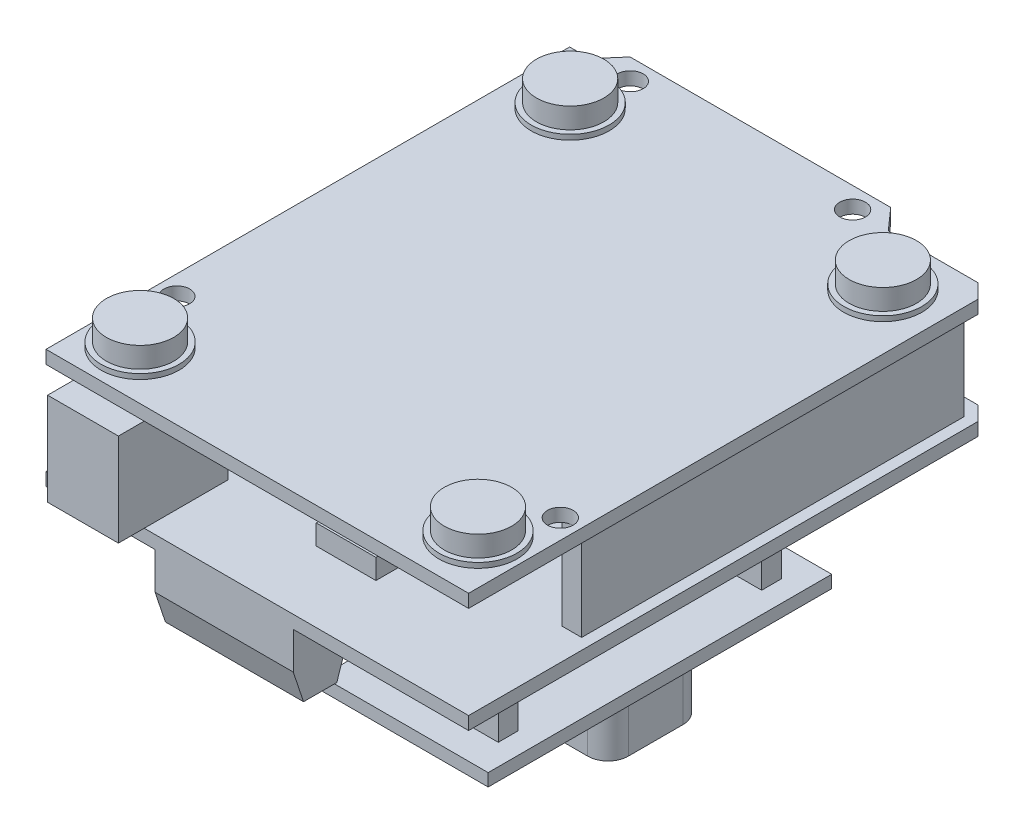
ISO-10303-21;
HEADER;
FILE_DESCRIPTION(('STEP AP214'),'2;1');
FILE_NAME('part.step','',(''),(''),'','','');
FILE_SCHEMA(('AUTOMOTIVE_DESIGN { 1 0 10303 214 1 1 1 1 }'));
ENDSEC;
DATA;
#1=APPLICATION_CONTEXT('core data for automotive mechanical design processes');
#2=APPLICATION_PROTOCOL_DEFINITION('international standard','automotive_design',2000,#1);
#3=PRODUCT_CONTEXT('',#1,'mechanical');
#4=PRODUCT('Part','Part','',(#3));
#5=PRODUCT_RELATED_PRODUCT_CATEGORY('part','',(#4));
#6=PRODUCT_DEFINITION_FORMATION('','',#4);
#7=PRODUCT_DEFINITION_CONTEXT('part definition',#1,'design');
#8=PRODUCT_DEFINITION('design','',#6,#7);
#9=PRODUCT_DEFINITION_SHAPE('','',#8);
#10=(LENGTH_UNIT() NAMED_UNIT(*) SI_UNIT(.MILLI.,.METRE.));
#11=(NAMED_UNIT(*) PLANE_ANGLE_UNIT() SI_UNIT($,.RADIAN.));
#12=(NAMED_UNIT(*) SI_UNIT($,.STERADIAN.) SOLID_ANGLE_UNIT());
#13=UNCERTAINTY_MEASURE_WITH_UNIT(LENGTH_MEASURE(1.E-05),#10,'distance_accuracy_value','');
#14=(GEOMETRIC_REPRESENTATION_CONTEXT(3) GLOBAL_UNCERTAINTY_ASSIGNED_CONTEXT((#13)) GLOBAL_UNIT_ASSIGNED_CONTEXT((#10,
#11,#12)) REPRESENTATION_CONTEXT('',''));
#15=CARTESIAN_POINT('',(0.,0.,0.));
#16=DIRECTION('',(0.,0.,1.));
#17=DIRECTION('',(1.,0.,0.));
#18=AXIS2_PLACEMENT_3D('',#15,#16,#17);
#19=CARTESIAN_POINT('',(0.,-29.7561,0.));
#20=DIRECTION('',(0.,-1.,0.));
#21=DIRECTION('',(0.,0.,-1.));
#22=AXIS2_PLACEMENT_3D('',#19,#20,#21);
#23=PLANE('',#22);
#24=CARTESIAN_POINT('',(30.1879,-29.7561,-43.1292));
#25=DIRECTION('',(0.,-1.,0.));
#26=DIRECTION('',(0.,0.,-1.));
#27=AXIS2_PLACEMENT_3D('',#24,#25,#26);
#28=CIRCLE('',#27,3.22580000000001);
#29=CARTESIAN_POINT('',(30.1879,-29.7561,-46.355));
#30=VERTEX_POINT('',#29);
#31=EDGE_CURVE('E2159',#30,#30,#28,.T.);
#32=ORIENTED_EDGE('',*,*,#31,.F.);
#33=EDGE_LOOP('',(#32));
#34=FACE_BOUND('',#33,.T.);
#35=CARTESIAN_POINT('',(30.1879,-29.7561,-19.9644));
#36=DIRECTION('',(0.,-1.,0.));
#37=DIRECTION('',(0.,0.,-1.));
#38=AXIS2_PLACEMENT_3D('',#35,#36,#37);
#39=CIRCLE('',#38,3.2258);
#40=CARTESIAN_POINT('',(30.1879,-29.7561,-16.7386));
#41=VERTEX_POINT('',#40);
#42=EDGE_CURVE('E2158',#41,#41,#39,.T.);
#43=ORIENTED_EDGE('',*,*,#42,.F.);
#44=EDGE_LOOP('',(#43));
#45=FACE_BOUND('',#44,.T.);
#46=DIRECTION('',(0.,0.,-1.));
#47=VECTOR('',#46,1.);
#48=CARTESIAN_POINT('',(24.8285,-29.7561,-9.8552));
#49=LINE('',#48,#47);
#50=CARTESIAN_POINT('',(24.8285,-29.7561,-9.8552));
#51=VERTEX_POINT('',#50);
#52=CARTESIAN_POINT('',(24.8285,-29.7561,-53.1241));
#53=VERTEX_POINT('',#52);
#54=EDGE_CURVE('E618',#51,#53,#49,.T.);
#55=ORIENTED_EDGE('',*,*,#54,.T.);
#56=DIRECTION('',(1.,0.,0.));
#57=VECTOR('',#56,1.);
#58=CARTESIAN_POINT('',(24.8285,-29.7561,-53.1241));
#59=LINE('',#58,#57);
#60=CARTESIAN_POINT('',(45.8343,-29.7561,-53.1241));
#61=VERTEX_POINT('',#60);
#62=EDGE_CURVE('E621',#53,#61,#59,.T.);
#63=ORIENTED_EDGE('',*,*,#62,.T.);
#64=DIRECTION('',(0.,0.,1.));
#65=VECTOR('',#64,1.);
#66=CARTESIAN_POINT('',(45.8343,-29.7561,-9.8552));
#67=LINE('',#66,#65);
#68=CARTESIAN_POINT('',(45.8343,-29.7561,-9.8552));
#69=VERTEX_POINT('',#68);
#70=EDGE_CURVE('E624',#61,#69,#67,.T.);
#71=ORIENTED_EDGE('',*,*,#70,.T.);
#72=DIRECTION('',(-1.,0.,0.));
#73=VECTOR('',#72,1.);
#74=CARTESIAN_POINT('',(24.8285,-29.7561,-9.8552));
#75=LINE('',#74,#73);
#76=EDGE_CURVE('E626',#69,#51,#75,.T.);
#77=ORIENTED_EDGE('',*,*,#76,.T.);
#78=EDGE_LOOP('',(#55,#63,#71,#77));
#79=FACE_BOUND('',#78,.T.);
#80=DIRECTION('',(0.,0.,1.));
#81=VECTOR('',#80,1.);
#82=CARTESIAN_POINT('',(45.3009,-29.7561,-28.0385872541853));
#83=LINE('',#82,#81);
#84=CARTESIAN_POINT('',(45.3009,-29.7561,-34.9407127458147));
#85=VERTEX_POINT('',#84);
#86=CARTESIAN_POINT('',(45.3009,-29.7561,-28.0385872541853));
#87=VERTEX_POINT('',#86);
#88=EDGE_CURVE('E2181',#85,#87,#83,.T.);
#89=ORIENTED_EDGE('',*,*,#88,.F.);
#90=CARTESIAN_POINT('',(42.7448627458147,-29.7561,-34.9407127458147));
#91=DIRECTION('',(0.,-1.,0.));
#92=DIRECTION('',(0.,0.,1.));
#93=AXIS2_PLACEMENT_3D('',#90,#91,#92);
#94=CIRCLE('',#93,2.5560372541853);
#95=CARTESIAN_POINT('',(42.7448627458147,-29.7561,-37.49675));
#96=VERTEX_POINT('',#95);
#97=EDGE_CURVE('E607',#96,#85,#94,.T.);
#98=ORIENTED_EDGE('',*,*,#97,.F.);
#99=DIRECTION('',(1.,0.,0.));
#100=VECTOR('',#99,1.);
#101=CARTESIAN_POINT('',(42.7448627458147,-29.7561,-37.49675));
#102=LINE('',#101,#100);
#103=CARTESIAN_POINT('',(35.8427372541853,-29.7561,-37.49675));
#104=VERTEX_POINT('',#103);
#105=EDGE_CURVE('E603',#104,#96,#102,.T.);
#106=ORIENTED_EDGE('',*,*,#105,.F.);
#107=CARTESIAN_POINT('',(35.8427372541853,-29.7561,-34.9407127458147));
#108=DIRECTION('',(0.,-1.,0.));
#109=DIRECTION('',(0.,0.,1.));
#110=AXIS2_PLACEMENT_3D('',#107,#108,#109);
#111=CIRCLE('',#110,2.55603725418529);
#112=CARTESIAN_POINT('',(33.2867,-29.7561,-34.9407127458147));
#113=VERTEX_POINT('',#112);
#114=EDGE_CURVE('E2191',#113,#104,#111,.T.);
#115=ORIENTED_EDGE('',*,*,#114,.F.);
#116=DIRECTION('',(0.,0.,-1.));
#117=VECTOR('',#116,1.);
#118=CARTESIAN_POINT('',(33.2867,-29.7561,-34.9407127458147));
#119=LINE('',#118,#117);
#120=CARTESIAN_POINT('',(33.2867,-29.7561,-28.0385872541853));
#121=VERTEX_POINT('',#120);
#122=EDGE_CURVE('E2189',#121,#113,#119,.T.);
#123=ORIENTED_EDGE('',*,*,#122,.F.);
#124=CARTESIAN_POINT('',(35.8427372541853,-29.7561,-28.0385872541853));
#125=DIRECTION('',(0.,-1.,0.));
#126=DIRECTION('',(0.,0.,1.));
#127=AXIS2_PLACEMENT_3D('',#124,#125,#126);
#128=CIRCLE('',#127,2.55603725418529);
#129=CARTESIAN_POINT('',(35.8427372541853,-29.7561,-25.48255));
#130=VERTEX_POINT('',#129);
#131=EDGE_CURVE('E2187',#130,#121,#128,.T.);
#132=ORIENTED_EDGE('',*,*,#131,.F.);
#133=DIRECTION('',(-1.,0.,0.));
#134=VECTOR('',#133,1.);
#135=CARTESIAN_POINT('',(35.8427372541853,-29.7561,-25.48255));
#136=LINE('',#135,#134);
#137=CARTESIAN_POINT('',(42.7448627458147,-29.7561,-25.48255));
#138=VERTEX_POINT('',#137);
#139=EDGE_CURVE('E2185',#138,#130,#136,.T.);
#140=ORIENTED_EDGE('',*,*,#139,.F.);
#141=CARTESIAN_POINT('',(42.7448627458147,-29.7561,-28.0385872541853));
#142=DIRECTION('',(0.,-1.,0.));
#143=DIRECTION('',(0.,0.,1.));
#144=AXIS2_PLACEMENT_3D('',#141,#142,#143);
#145=CIRCLE('',#144,2.5560372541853);
#146=EDGE_CURVE('E2183',#87,#138,#145,.T.);
#147=ORIENTED_EDGE('',*,*,#146,.F.);
#148=EDGE_LOOP('',(#89,#98,#106,#115,#123,#132,#140,#147));
#149=FACE_BOUND('',#148,.T.);
#150=ADVANCED_FACE('F34',(#34,#45,#79,#149),#23,.T.);
#151=CARTESIAN_POINT('',(0.,-14.9733,0.));
#152=DIRECTION('',(0.,1.,0.));
#153=DIRECTION('',(0.,0.,1.));
#154=AXIS2_PLACEMENT_3D('',#151,#152,#153);
#155=PLANE('',#154);
#156=DIRECTION('',(0.,0.,-1.));
#157=VECTOR('',#156,1.);
#158=CARTESIAN_POINT('',(28.0543,-14.9733,-13.7922));
#159=LINE('',#158,#157);
#160=CARTESIAN_POINT('',(28.0543,-14.9733,-13.7922));
#161=VERTEX_POINT('',#160);
#162=CARTESIAN_POINT('',(28.0543,-14.9733,-16.2814));
#163=VERTEX_POINT('',#162);
#164=EDGE_CURVE('E677',#161,#163,#159,.T.);
#165=ORIENTED_EDGE('',*,*,#164,.F.);
#166=DIRECTION('',(-1.,0.,0.));
#167=VECTOR('',#166,1.);
#168=CARTESIAN_POINT('',(28.0543,-14.9733,-13.7922));
#169=LINE('',#168,#167);
#170=CARTESIAN_POINT('',(43.1673,-14.9733,-13.7922));
#171=VERTEX_POINT('',#170);
#172=EDGE_CURVE('E682',#171,#161,#169,.T.);
#173=ORIENTED_EDGE('',*,*,#172,.F.);
#174=DIRECTION('',(0.,0.,1.));
#175=VECTOR('',#174,1.);
#176=CARTESIAN_POINT('',(43.1673,-14.9733,-13.7922));
#177=LINE('',#176,#175);
#178=CARTESIAN_POINT('',(43.1673,-14.9733,-16.2814));
#179=VERTEX_POINT('',#178);
#180=EDGE_CURVE('E697',#179,#171,#177,.T.);
#181=ORIENTED_EDGE('',*,*,#180,.F.);
#182=DIRECTION('',(1.,0.,0.));
#183=VECTOR('',#182,1.);
#184=CARTESIAN_POINT('',(28.0543,-14.9733,-16.2814));
#185=LINE('',#184,#183);
#186=EDGE_CURVE('E694',#163,#179,#185,.T.);
#187=ORIENTED_EDGE('',*,*,#186,.F.);
#188=EDGE_LOOP('',(#165,#173,#181,#187));
#189=FACE_BOUND('',#188,.T.);
#190=DIRECTION('',(0.,0.,1.));
#191=VECTOR('',#190,1.);
#192=CARTESIAN_POINT('',(45.9613,-14.9733,-56.9468));
#193=LINE('',#192,#191);
#194=CARTESIAN_POINT('',(45.9613,-14.9733,-65.9511));
#195=VERTEX_POINT('',#194);
#196=CARTESIAN_POINT('',(45.9613,-14.9733,-56.9468));
#197=VERTEX_POINT('',#196);
#198=EDGE_CURVE('E796',#195,#197,#193,.T.);
#199=ORIENTED_EDGE('',*,*,#198,.F.);
#200=DIRECTION('',(1.,0.,0.));
#201=VECTOR('',#200,1.);
#202=CARTESIAN_POINT('',(51.4296487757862,-14.9733,-65.9511));
#203=LINE('',#202,#201);
#204=CARTESIAN_POINT('',(51.4296487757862,-14.9733,-65.9511));
#205=VERTEX_POINT('',#204);
#206=EDGE_CURVE('E971',#195,#205,#203,.T.);
#207=ORIENTED_EDGE('',*,*,#206,.T.);
#208=DIRECTION('',(0.707106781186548,0.,0.707106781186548));
#209=VECTOR('',#208,1.);
#210=CARTESIAN_POINT('',(53.2257,-14.9733,-64.1550487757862));
#211=LINE('',#210,#209);
#212=CARTESIAN_POINT('',(53.2257,-14.9733,-64.1550487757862));
#213=VERTEX_POINT('',#212);
#214=EDGE_CURVE('E973',#205,#213,#211,.T.);
#215=ORIENTED_EDGE('',*,*,#214,.T.);
#216=DIRECTION('',(0.,0.,1.));
#217=VECTOR('',#216,1.);
#218=CARTESIAN_POINT('',(53.2257,-14.9733,0.));
#219=LINE('',#218,#217);
#220=CARTESIAN_POINT('',(53.2257,-14.9733,0.));
#221=VERTEX_POINT('',#220);
#222=EDGE_CURVE('E975',#213,#221,#219,.T.);
#223=ORIENTED_EDGE('',*,*,#222,.T.);
#224=DIRECTION('',(-1.,0.,0.));
#225=VECTOR('',#224,1.);
#226=CARTESIAN_POINT('',(0.,-14.9733,0.));
#227=LINE('',#226,#225);
#228=CARTESIAN_POINT('',(31.1404,-14.9733,0.));
#229=VERTEX_POINT('',#228);
#230=EDGE_CURVE('E978',#221,#229,#227,.T.);
#231=ORIENTED_EDGE('',*,*,#230,.T.);
#232=DIRECTION('',(0.,0.,1.));
#233=VECTOR('',#232,1.);
#234=CARTESIAN_POINT('',(31.1404,-14.9733,0.));
#235=LINE('',#234,#233);
#236=CARTESIAN_POINT('',(31.1404,-14.9733,-6.7818));
#237=VERTEX_POINT('',#236);
#238=EDGE_CURVE('E866',#237,#229,#235,.T.);
#239=ORIENTED_EDGE('',*,*,#238,.F.);
#240=DIRECTION('',(1.,0.,0.));
#241=VECTOR('',#240,1.);
#242=CARTESIAN_POINT('',(13.7414,-14.9733,-6.7818));
#243=LINE('',#242,#241);
#244=CARTESIAN_POINT('',(13.7414,-14.9733,-6.7818));
#245=VERTEX_POINT('',#244);
#246=EDGE_CURVE('E872',#245,#237,#243,.T.);
#247=ORIENTED_EDGE('',*,*,#246,.F.);
#248=DIRECTION('',(0.,0.,-1.));
#249=VECTOR('',#248,1.);
#250=CARTESIAN_POINT('',(13.7414,-14.9733,0.));
#251=LINE('',#250,#249);
#252=CARTESIAN_POINT('',(13.7414,-14.9733,0.));
#253=VERTEX_POINT('',#252);
#254=EDGE_CURVE('E861',#253,#245,#251,.T.);
#255=ORIENTED_EDGE('',*,*,#254,.F.);
#256=CARTESIAN_POINT('',(0.,-14.9733,0.));
#257=VERTEX_POINT('',#256);
#258=EDGE_CURVE('E977',#253,#257,#227,.T.);
#259=ORIENTED_EDGE('',*,*,#258,.T.);
#260=DIRECTION('',(0.,0.,-1.));
#261=VECTOR('',#260,1.);
#262=CARTESIAN_POINT('',(0.,-14.9733,-65.9511));
#263=LINE('',#262,#261);
#264=CARTESIAN_POINT('',(0.,-14.9733,-16.8275));
#265=VERTEX_POINT('',#264);
#266=EDGE_CURVE('E957',#257,#265,#263,.T.);
#267=ORIENTED_EDGE('',*,*,#266,.T.);
#268=DIRECTION('',(-1.,0.,0.));
#269=VECTOR('',#268,1.);
#270=CARTESIAN_POINT('',(0.,-14.9733,-16.8275));
#271=LINE('',#270,#269);
#272=CARTESIAN_POINT('',(6.7818,-14.9733,-16.8275));
#273=VERTEX_POINT('',#272);
#274=EDGE_CURVE('E843',#273,#265,#271,.T.);
#275=ORIENTED_EDGE('',*,*,#274,.F.);
#276=DIRECTION('',(0.,0.,1.));
#277=VECTOR('',#276,1.);
#278=CARTESIAN_POINT('',(6.7818,-14.9733,-16.8275));
#279=LINE('',#278,#277);
#280=CARTESIAN_POINT('',(6.7818,-14.9733,-23.876));
#281=VERTEX_POINT('',#280);
#282=EDGE_CURVE('E849',#281,#273,#279,.T.);
#283=ORIENTED_EDGE('',*,*,#282,.F.);
#284=DIRECTION('',(1.,0.,0.));
#285=VECTOR('',#284,1.);
#286=CARTESIAN_POINT('',(0.,-14.9733,-23.876));
#287=LINE('',#286,#285);
#288=CARTESIAN_POINT('',(0.,-14.9733,-23.876));
#289=VERTEX_POINT('',#288);
#290=EDGE_CURVE('E838',#289,#281,#287,.T.);
#291=ORIENTED_EDGE('',*,*,#290,.F.);
#292=CARTESIAN_POINT('',(0.,-14.9733,-65.9511));
#293=VERTEX_POINT('',#292);
#294=EDGE_CURVE('E961',#289,#293,#263,.T.);
#295=ORIENTED_EDGE('',*,*,#294,.T.);
#296=DIRECTION('',(1.,0.,0.));
#297=VECTOR('',#296,1.);
#298=CARTESIAN_POINT('',(2.54,-14.9733,-65.9511));
#299=LINE('',#298,#297);
#300=CARTESIAN_POINT('',(2.54,-14.9733,-65.9511));
#301=VERTEX_POINT('',#300);
#302=EDGE_CURVE('E960',#293,#301,#299,.T.);
#303=ORIENTED_EDGE('',*,*,#302,.T.);
#304=DIRECTION('',(0.654359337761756,0.,-0.756183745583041));
#305=VECTOR('',#304,1.);
#306=CARTESIAN_POINT('',(4.89183289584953,-14.9733,-68.6689));
#307=LINE('',#306,#305);
#308=CARTESIAN_POINT('',(4.89183289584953,-14.9733,-68.6689));
#309=VERTEX_POINT('',#308);
#310=EDGE_CURVE('E963',#301,#309,#307,.T.);
#311=ORIENTED_EDGE('',*,*,#310,.T.);
#312=DIRECTION('',(1.,0.,0.));
#313=VECTOR('',#312,1.);
#314=CARTESIAN_POINT('',(37.7213328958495,-14.9733,-68.6689));
#315=LINE('',#314,#313);
#316=CARTESIAN_POINT('',(5.4102,-14.9733,-68.6689));
#317=VERTEX_POINT('',#316);
#318=EDGE_CURVE('E966',#309,#317,#315,.T.);
#319=ORIENTED_EDGE('',*,*,#318,.T.);
#320=DIRECTION('',(0.,0.,-1.));
#321=VECTOR('',#320,1.);
#322=CARTESIAN_POINT('',(5.4102,-14.9733,-61.8871));
#323=LINE('',#322,#321);
#324=CARTESIAN_POINT('',(5.4102,-14.9733,-61.8871));
#325=VERTEX_POINT('',#324);
#326=EDGE_CURVE('E790',#325,#317,#323,.T.);
#327=ORIENTED_EDGE('',*,*,#326,.F.);
#328=DIRECTION('',(-1.,0.,0.));
#329=VECTOR('',#328,1.);
#330=CARTESIAN_POINT('',(5.4102,-14.9733,-61.8871));
#331=LINE('',#330,#329);
#332=CARTESIAN_POINT('',(22.8092,-14.9733,-61.8871));
#333=VERTEX_POINT('',#332);
#334=EDGE_CURVE('E820',#333,#325,#331,.T.);
#335=ORIENTED_EDGE('',*,*,#334,.F.);
#336=DIRECTION('',(0.,0.,1.));
#337=VECTOR('',#336,1.);
#338=CARTESIAN_POINT('',(22.8092,-14.9733,-61.8871));
#339=LINE('',#338,#337);
#340=CARTESIAN_POINT('',(22.8092,-14.9733,-68.6689));
#341=VERTEX_POINT('',#340);
#342=EDGE_CURVE('E826',#341,#333,#339,.T.);
#343=ORIENTED_EDGE('',*,*,#342,.F.);
#344=CARTESIAN_POINT('',(37.7213328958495,-14.9733,-68.6689));
#345=VERTEX_POINT('',#344);
#346=EDGE_CURVE('E965',#341,#345,#315,.T.);
#347=ORIENTED_EDGE('',*,*,#346,.T.);
#348=DIRECTION('',(0.663414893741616,0.,0.74825174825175));
#349=VECTOR('',#348,1.);
#350=CARTESIAN_POINT('',(40.1309884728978,-14.9733,-65.9511));
#351=LINE('',#350,#349);
#352=CARTESIAN_POINT('',(40.1309884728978,-14.9733,-65.9511));
#353=VERTEX_POINT('',#352);
#354=EDGE_CURVE('E969',#345,#353,#351,.T.);
#355=ORIENTED_EDGE('',*,*,#354,.T.);
#356=DIRECTION('',(1.,0.,0.));
#357=VECTOR('',#356,1.);
#358=CARTESIAN_POINT('',(30.5943,-14.9733,-65.9511));
#359=LINE('',#358,#357);
#360=CARTESIAN_POINT('',(30.5943,-14.9733,-65.9511));
#361=VERTEX_POINT('',#360);
#362=EDGE_CURVE('E793',#361,#353,#359,.T.);
#363=ORIENTED_EDGE('',*,*,#362,.F.);
#364=DIRECTION('',(0.,0.,-1.));
#365=VECTOR('',#364,1.);
#366=CARTESIAN_POINT('',(30.5943,-14.9733,-56.9468));
#367=LINE('',#366,#365);
#368=CARTESIAN_POINT('',(30.5943,-14.9733,-56.9468));
#369=VERTEX_POINT('',#368);
#370=EDGE_CURVE('E777',#369,#361,#367,.T.);
#371=ORIENTED_EDGE('',*,*,#370,.F.);
#372=DIRECTION('',(-1.,0.,0.));
#373=VECTOR('',#372,1.);
#374=CARTESIAN_POINT('',(30.5943,-14.9733,-56.9468));
#375=LINE('',#374,#373);
#376=EDGE_CURVE('E799',#197,#369,#375,.T.);
#377=ORIENTED_EDGE('',*,*,#376,.F.);
#378=EDGE_LOOP('',(#199,#207,#215,#223,#231,#239,#247,#255,#259,#267,#275,#283,#291,#295,#303,
#311,#319,#327,#335,#343,#347,#355,#363,#371,#377));
#379=FACE_BOUND('',#378,.T.);
#380=DIRECTION('',(0.,0.,-1.));
#381=VECTOR('',#380,1.);
#382=CARTESIAN_POINT('',(8.6868,-14.9733,-18.6944));
#383=LINE('',#382,#381);
#384=CARTESIAN_POINT('',(8.6868,-14.9733,-18.6944));
#385=VERTEX_POINT('',#384);
#386=CARTESIAN_POINT('',(8.6868,-14.9733,-23.876));
#387=VERTEX_POINT('',#386);
#388=EDGE_CURVE('E713',#385,#387,#383,.T.);
#389=ORIENTED_EDGE('',*,*,#388,.F.);
#390=DIRECTION('',(-1.,0.,0.));
#391=VECTOR('',#390,1.);
#392=CARTESIAN_POINT('',(8.6868,-14.9733,-18.6944));
#393=LINE('',#392,#391);
#394=CARTESIAN_POINT('',(11.2268,-14.9733,-18.6944));
#395=VERTEX_POINT('',#394);
#396=EDGE_CURVE('E718',#395,#385,#393,.T.);
#397=ORIENTED_EDGE('',*,*,#396,.F.);
#398=DIRECTION('',(0.,0.,1.));
#399=VECTOR('',#398,1.);
#400=CARTESIAN_POINT('',(11.2268,-14.9733,-18.6944));
#401=LINE('',#400,#399);
#402=CARTESIAN_POINT('',(11.2268,-14.9733,-23.876));
#403=VERTEX_POINT('',#402);
#404=EDGE_CURVE('E730',#403,#395,#401,.T.);
#405=ORIENTED_EDGE('',*,*,#404,.F.);
#406=DIRECTION('',(1.,0.,0.));
#407=VECTOR('',#406,1.);
#408=CARTESIAN_POINT('',(8.6868,-14.9733,-23.876));
#409=LINE('',#408,#407);
#410=EDGE_CURVE('E727',#387,#403,#409,.T.);
#411=ORIENTED_EDGE('',*,*,#410,.F.);
#412=EDGE_LOOP('',(#389,#397,#405,#411));
#413=FACE_BOUND('',#412,.T.);
#414=DIRECTION('',(0.,0.,-1.));
#415=VECTOR('',#414,1.);
#416=CARTESIAN_POINT('',(28.0543,-14.9733,-46.9646));
#417=LINE('',#416,#415);
#418=CARTESIAN_POINT('',(28.0543,-14.9733,-46.9646));
#419=VERTEX_POINT('',#418);
#420=CARTESIAN_POINT('',(28.0543,-14.9733,-49.4538));
#421=VERTEX_POINT('',#420);
#422=EDGE_CURVE('E644',#419,#421,#417,.T.);
#423=ORIENTED_EDGE('',*,*,#422,.F.);
#424=DIRECTION('',(-1.,0.,0.));
#425=VECTOR('',#424,1.);
#426=CARTESIAN_POINT('',(28.0543,-14.9733,-46.9646));
#427=LINE('',#426,#425);
#428=CARTESIAN_POINT('',(43.1673,-14.9733,-46.9646));
#429=VERTEX_POINT('',#428);
#430=EDGE_CURVE('E649',#429,#419,#427,.T.);
#431=ORIENTED_EDGE('',*,*,#430,.F.);
#432=DIRECTION('',(0.,0.,1.));
#433=VECTOR('',#432,1.);
#434=CARTESIAN_POINT('',(43.1673,-14.9733,-46.9646));
#435=LINE('',#434,#433);
#436=CARTESIAN_POINT('',(43.1673,-14.9733,-49.4538));
#437=VERTEX_POINT('',#436);
#438=EDGE_CURVE('E662',#437,#429,#435,.T.);
#439=ORIENTED_EDGE('',*,*,#438,.F.);
#440=DIRECTION('',(1.,0.,0.));
#441=VECTOR('',#440,1.);
#442=CARTESIAN_POINT('',(28.0543,-14.9733,-49.4538));
#443=LINE('',#442,#441);
#444=EDGE_CURVE('E59',#421,#437,#443,.T.);
#445=ORIENTED_EDGE('',*,*,#444,.F.);
#446=EDGE_LOOP('',(#423,#431,#439,#445));
#447=FACE_BOUND('',#446,.T.);
#448=ADVANCED_FACE('F1322',(#189,#379,#413,#447),#155,.F.);
#449=CARTESIAN_POINT('',(0.,-19.5834,0.));
#450=DIRECTION('',(0.,1.,0.));
#451=DIRECTION('',(0.,0.,1.));
#452=AXIS2_PLACEMENT_3D('',#449,#450,#451);
#453=PLANE('',#452);
#454=DIRECTION('',(0.,0.,1.));
#455=VECTOR('',#454,1.);
#456=CARTESIAN_POINT('',(42.037,-19.5834,-61.849));
#457=LINE('',#456,#455);
#458=CARTESIAN_POINT('',(42.037,-19.5834,-65.9511));
#459=VERTEX_POINT('',#458);
#460=CARTESIAN_POINT('',(42.037,-19.5834,-61.849));
#461=VERTEX_POINT('',#460);
#462=EDGE_CURVE('E12',#459,#461,#457,.T.);
#463=ORIENTED_EDGE('',*,*,#462,.F.);
#464=DIRECTION('',(-1.,0.,0.));
#465=VECTOR('',#464,1.);
#466=CARTESIAN_POINT('',(30.5943,-19.5834,-65.9511));
#467=LINE('',#466,#465);
#468=CARTESIAN_POINT('',(45.9613,-19.5834,-65.9511));
#469=VERTEX_POINT('',#468);
#470=EDGE_CURVE('E783',#469,#459,#467,.T.);
#471=ORIENTED_EDGE('',*,*,#470,.F.);
#472=DIRECTION('',(0.,0.,-1.));
#473=VECTOR('',#472,1.);
#474=CARTESIAN_POINT('',(45.9613,-19.5834,-56.9468));
#475=LINE('',#474,#473);
#476=CARTESIAN_POINT('',(45.9613,-19.5834,-56.9468));
#477=VERTEX_POINT('',#476);
#478=EDGE_CURVE('E778',#477,#469,#475,.T.);
#479=ORIENTED_EDGE('',*,*,#478,.F.);
#480=DIRECTION('',(1.,0.,0.));
#481=VECTOR('',#480,1.);
#482=CARTESIAN_POINT('',(30.5943,-19.5834,-56.9468));
#483=LINE('',#482,#481);
#484=CARTESIAN_POINT('',(30.5943,-19.5834,-56.9468));
#485=VERTEX_POINT('',#484);
#486=EDGE_CURVE('E782',#485,#477,#483,.T.);
#487=ORIENTED_EDGE('',*,*,#486,.F.);
#488=DIRECTION('',(0.,0.,1.));
#489=VECTOR('',#488,1.);
#490=CARTESIAN_POINT('',(30.5943,-19.5834,-56.9468));
#491=LINE('',#490,#489);
#492=CARTESIAN_POINT('',(30.5943,-19.5834,-65.9511));
#493=VERTEX_POINT('',#492);
#494=EDGE_CURVE('E786',#493,#485,#491,.T.);
#495=ORIENTED_EDGE('',*,*,#494,.F.);
#496=CARTESIAN_POINT('',(34.5186,-19.5834,-65.9511));
#497=VERTEX_POINT('',#496);
#498=EDGE_CURVE('E781',#497,#493,#467,.T.);
#499=ORIENTED_EDGE('',*,*,#498,.F.);
#500=DIRECTION('',(0.,0.,-1.));
#501=VECTOR('',#500,1.);
#502=CARTESIAN_POINT('',(34.5186,-19.5834,-61.849));
#503=LINE('',#502,#501);
#504=CARTESIAN_POINT('',(34.5186,-19.5834,-61.849));
#505=VERTEX_POINT('',#504);
#506=EDGE_CURVE('E762',#505,#497,#503,.T.);
#507=ORIENTED_EDGE('',*,*,#506,.F.);
#508=DIRECTION('',(-1.,0.,0.));
#509=VECTOR('',#508,1.);
#510=CARTESIAN_POINT('',(42.037,-19.5834,-61.849));
#511=LINE('',#510,#509);
#512=EDGE_CURVE('E758',#461,#505,#511,.T.);
#513=ORIENTED_EDGE('',*,*,#512,.F.);
#514=EDGE_LOOP('',(#463,#471,#479,#487,#495,#499,#507,#513));
#515=FACE_BOUND('',#514,.T.);
#516=ADVANCED_FACE('F1452',(#515),#453,.F.);
#517=CARTESIAN_POINT('',(0.,-1.651,0.));
#518=DIRECTION('',(0.,-1.,0.));
#519=DIRECTION('',(0.,0.,-1.));
#520=AXIS2_PLACEMENT_3D('',#517,#518,#519);
#521=PLANE('',#520);
#522=DIRECTION('',(0.,0.,1.));
#523=VECTOR('',#522,1.);
#524=CARTESIAN_POINT('',(12.3698,-1.651,-10.541));
#525=LINE('',#524,#523);
#526=CARTESIAN_POINT('',(12.3698,-1.651,-10.541));
#527=VERTEX_POINT('',#526);
#528=CARTESIAN_POINT('',(12.3698,-1.651,0.));
#529=VERTEX_POINT('',#528);
#530=EDGE_CURVE('E920',#527,#529,#525,.T.);
#531=ORIENTED_EDGE('',*,*,#530,.F.);
#532=DIRECTION('',(-1.,0.,0.));
#533=VECTOR('',#532,1.);
#534=CARTESIAN_POINT('',(12.3698,-1.651,-10.541));
#535=LINE('',#534,#533);
#536=CARTESIAN_POINT('',(3.4544,-1.651,-10.541));
#537=VERTEX_POINT('',#536);
#538=EDGE_CURVE('E899',#527,#537,#535,.T.);
#539=ORIENTED_EDGE('',*,*,#538,.T.);
#540=DIRECTION('',(0.,0.,1.));
#541=VECTOR('',#540,1.);
#542=CARTESIAN_POINT('',(3.4544,-1.651,-10.541));
#543=LINE('',#542,#541);
#544=CARTESIAN_POINT('',(3.4544,-1.651,0.));
#545=VERTEX_POINT('',#544);
#546=EDGE_CURVE('E916',#537,#545,#543,.T.);
#547=ORIENTED_EDGE('',*,*,#546,.T.);
#548=DIRECTION('',(1.,0.,0.));
#549=VECTOR('',#548,1.);
#550=CARTESIAN_POINT('',(0.,-1.651,0.));
#551=LINE('',#550,#549);
#552=CARTESIAN_POINT('',(0.,-1.651,0.));
#553=VERTEX_POINT('',#552);
#554=EDGE_CURVE('E1156',#553,#545,#551,.T.);
#555=ORIENTED_EDGE('',*,*,#554,.F.);
#556=DIRECTION('',(0.,0.,1.));
#557=VECTOR('',#556,1.);
#558=CARTESIAN_POINT('',(0.,-1.651,0.));
#559=LINE('',#558,#557);
#560=CARTESIAN_POINT('',(0.,-1.651,-65.9511));
#561=VERTEX_POINT('',#560);
#562=EDGE_CURVE('E1151',#561,#553,#559,.T.);
#563=ORIENTED_EDGE('',*,*,#562,.F.);
#564=DIRECTION('',(-1.,0.,0.));
#565=VECTOR('',#564,1.);
#566=CARTESIAN_POINT('',(0.,-1.651,-65.9511));
#567=LINE('',#566,#565);
#568=CARTESIAN_POINT('',(2.54,-1.651,-65.9511));
#569=VERTEX_POINT('',#568);
#570=EDGE_CURVE('E1180',#569,#561,#567,.T.);
#571=ORIENTED_EDGE('',*,*,#570,.F.);
#572=DIRECTION('',(-0.654359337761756,0.,0.756183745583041));
#573=VECTOR('',#572,1.);
#574=CARTESIAN_POINT('',(2.54,-1.651,-65.9511));
#575=LINE('',#574,#573);
#576=CARTESIAN_POINT('',(4.89183289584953,-1.651,-68.6689));
#577=VERTEX_POINT('',#576);
#578=EDGE_CURVE('E1177',#577,#569,#575,.T.);
#579=ORIENTED_EDGE('',*,*,#578,.F.);
#580=DIRECTION('',(-1.,0.,0.));
#581=VECTOR('',#580,1.);
#582=CARTESIAN_POINT('',(4.89183289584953,-1.651,-68.6689));
#583=LINE('',#582,#581);
#584=CARTESIAN_POINT('',(37.7213328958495,-1.651,-68.6689));
#585=VERTEX_POINT('',#584);
#586=EDGE_CURVE('E1174',#585,#577,#583,.T.);
#587=ORIENTED_EDGE('',*,*,#586,.F.);
#588=DIRECTION('',(-0.663414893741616,0.,-0.74825174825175));
#589=VECTOR('',#588,1.);
#590=CARTESIAN_POINT('',(37.7213328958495,-1.651,-68.6689));
#591=LINE('',#590,#589);
#592=CARTESIAN_POINT('',(40.1309884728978,-1.651,-65.9511));
#593=VERTEX_POINT('',#592);
#594=EDGE_CURVE('E1171',#593,#585,#591,.T.);
#595=ORIENTED_EDGE('',*,*,#594,.F.);
#596=DIRECTION('',(-1.,0.,0.));
#597=VECTOR('',#596,1.);
#598=CARTESIAN_POINT('',(40.1309884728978,-1.651,-65.9511));
#599=LINE('',#598,#597);
#600=CARTESIAN_POINT('',(51.4296487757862,-1.651,-65.9511));
#601=VERTEX_POINT('',#600);
#602=EDGE_CURVE('E1168',#601,#593,#599,.T.);
#603=ORIENTED_EDGE('',*,*,#602,.F.);
#604=DIRECTION('',(-0.707106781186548,0.,-0.707106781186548));
#605=VECTOR('',#604,1.);
#606=CARTESIAN_POINT('',(51.4296487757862,-1.651,-65.9511));
#607=LINE('',#606,#605);
#608=CARTESIAN_POINT('',(53.2257,-1.651,-64.1550487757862));
#609=VERTEX_POINT('',#608);
#610=EDGE_CURVE('E1165',#609,#601,#607,.T.);
#611=ORIENTED_EDGE('',*,*,#610,.F.);
#612=DIRECTION('',(0.,0.,-1.));
#613=VECTOR('',#612,1.);
#614=CARTESIAN_POINT('',(53.2257,-1.651,0.));
#615=LINE('',#614,#613);
#616=CARTESIAN_POINT('',(53.2257,-1.651,0.));
#617=VERTEX_POINT('',#616);
#618=EDGE_CURVE('E1159',#617,#609,#615,.T.);
#619=ORIENTED_EDGE('',*,*,#618,.F.);
#620=CARTESIAN_POINT('',(41.8211,-1.651,0.));
#621=VERTEX_POINT('',#620);
#622=EDGE_CURVE('E1154',#621,#617,#551,.T.);
#623=ORIENTED_EDGE('',*,*,#622,.F.);
#624=DIRECTION('',(0.,0.,1.));
#625=VECTOR('',#624,1.);
#626=CARTESIAN_POINT('',(41.8211,-1.651,-5.08));
#627=LINE('',#626,#625);
#628=CARTESIAN_POINT('',(41.8211,-1.651,-5.08));
#629=VERTEX_POINT('',#628);
#630=EDGE_CURVE('E955',#629,#621,#627,.T.);
#631=ORIENTED_EDGE('',*,*,#630,.F.);
#632=DIRECTION('',(-1.,0.,0.));
#633=VECTOR('',#632,1.);
#634=CARTESIAN_POINT('',(41.8211,-1.651,-5.08));
#635=LINE('',#634,#633);
#636=CARTESIAN_POINT('',(34.3027,-1.651,-5.08));
#637=VERTEX_POINT('',#636);
#638=EDGE_CURVE('E936',#629,#637,#635,.T.);
#639=ORIENTED_EDGE('',*,*,#638,.T.);
#640=DIRECTION('',(0.,0.,1.));
#641=VECTOR('',#640,1.);
#642=CARTESIAN_POINT('',(34.3027,-1.651,-5.08));
#643=LINE('',#642,#641);
#644=CARTESIAN_POINT('',(34.3027,-1.651,0.));
#645=VERTEX_POINT('',#644);
#646=EDGE_CURVE('E951',#637,#645,#643,.T.);
#647=ORIENTED_EDGE('',*,*,#646,.T.);
#648=EDGE_CURVE('E1161',#529,#645,#551,.T.);
#649=ORIENTED_EDGE('',*,*,#648,.F.);
#650=EDGE_LOOP('',(#531,#539,#547,#555,#563,#571,#579,#587,#595,#603,#611,#619,#623,#631,#639,
#647,#649));
#651=FACE_BOUND('',#650,.T.);
#652=DIRECTION('',(0.,0.,1.));
#653=VECTOR('',#652,1.);
#654=CARTESIAN_POINT('',(51.8287,-1.651,-15.6337));
#655=LINE('',#654,#653);
#656=CARTESIAN_POINT('',(51.8287,-1.651,-63.7794));
#657=VERTEX_POINT('',#656);
#658=CARTESIAN_POINT('',(51.8287,-1.651,-15.6337));
#659=VERTEX_POINT('',#658);
#660=EDGE_CURVE('E1061',#657,#659,#655,.T.);
#661=ORIENTED_EDGE('',*,*,#660,.F.);
#662=DIRECTION('',(1.,0.,0.));
#663=VECTOR('',#662,1.);
#664=CARTESIAN_POINT('',(51.8287,-1.651,-63.7794));
#665=LINE('',#664,#663);
#666=CARTESIAN_POINT('',(49.3649,-1.651,-63.7794));
#667=VERTEX_POINT('',#666);
#668=EDGE_CURVE('E1066',#667,#657,#665,.T.);
#669=ORIENTED_EDGE('',*,*,#668,.F.);
#670=DIRECTION('',(0.,0.,-1.));
#671=VECTOR('',#670,1.);
#672=CARTESIAN_POINT('',(49.3649,-1.651,-15.6337));
#673=LINE('',#672,#671);
#674=CARTESIAN_POINT('',(49.3649,-1.651,-15.6337));
#675=VERTEX_POINT('',#674);
#676=EDGE_CURVE('E1081',#675,#667,#673,.T.);
#677=ORIENTED_EDGE('',*,*,#676,.F.);
#678=DIRECTION('',(-1.,0.,0.));
#679=VECTOR('',#678,1.);
#680=CARTESIAN_POINT('',(51.8287,-1.651,-15.6337));
#681=LINE('',#680,#679);
#682=CARTESIAN_POINT('',(50.7619,-1.651,-15.6337));
#683=VERTEX_POINT('',#682);
#684=EDGE_CURVE('E1082',#683,#675,#681,.T.);
#685=ORIENTED_EDGE('',*,*,#684,.F.);
#686=CARTESIAN_POINT('',(50.7619,-1.651,-14.01445));
#687=DIRECTION('',(0.,1.,0.));
#688=DIRECTION('',(0.,0.,1.));
#689=AXIS2_PLACEMENT_3D('',#686,#687,#688);
#690=CIRCLE('',#689,1.61925);
#691=EDGE_CURVE('E1127',#683,#683,#690,.T.);
#692=ORIENTED_EDGE('',*,*,#691,.T.);
#693=EDGE_CURVE('E1078',#659,#683,#681,.T.);
#694=ORIENTED_EDGE('',*,*,#693,.F.);
#695=EDGE_LOOP('',(#661,#669,#677,#685,#692,#694));
#696=FACE_BOUND('',#695,.T.);
#697=CARTESIAN_POINT('',(2.4638,-1.651,-14.01445));
#698=DIRECTION('',(0.,1.,0.));
#699=DIRECTION('',(0.,0.,1.));
#700=AXIS2_PLACEMENT_3D('',#697,#698,#699);
#701=CIRCLE('',#700,1.61925);
#702=CARTESIAN_POINT('',(2.4638,-1.651,-12.3952));
#703=VERTEX_POINT('',#702);
#704=EDGE_CURVE('E1133',#703,#703,#701,.T.);
#705=ORIENTED_EDGE('',*,*,#704,.T.);
#706=EDGE_LOOP('',(#705));
#707=FACE_BOUND('',#706,.T.);
#708=CARTESIAN_POINT('',(35.55365,-1.651,-66.03365));
#709=DIRECTION('',(0.,1.,0.));
#710=DIRECTION('',(0.,0.,1.));
#711=AXIS2_PLACEMENT_3D('',#708,#709,#710);
#712=CIRCLE('',#711,1.61925);
#713=CARTESIAN_POINT('',(35.55365,-1.651,-64.4144));
#714=VERTEX_POINT('',#713);
#715=EDGE_CURVE('E1139',#714,#714,#712,.T.);
#716=ORIENTED_EDGE('',*,*,#715,.T.);
#717=EDGE_LOOP('',(#716));
#718=FACE_BOUND('',#717,.T.);
#719=CARTESIAN_POINT('',(7.56285,-1.651,-66.03365));
#720=DIRECTION('',(0.,1.,0.));
#721=DIRECTION('',(0.,0.,1.));
#722=AXIS2_PLACEMENT_3D('',#719,#720,#721);
#723=CIRCLE('',#722,1.61925);
#724=CARTESIAN_POINT('',(7.56285,-1.651,-64.4144));
#725=VERTEX_POINT('',#724);
#726=EDGE_CURVE('E1145',#725,#725,#723,.T.);
#727=ORIENTED_EDGE('',*,*,#726,.T.);
#728=EDGE_LOOP('',(#727));
#729=FACE_BOUND('',#728,.T.);
#730=DIRECTION('',(-1.,0.,0.));
#731=VECTOR('',#730,1.);
#732=CARTESIAN_POINT('',(3.86080000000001,-1.651,-24.9301));
#733=LINE('',#732,#731);
#734=CARTESIAN_POINT('',(3.86080000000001,-1.651,-24.9301));
#735=VERTEX_POINT('',#734);
#736=CARTESIAN_POINT('',(1.39700000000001,-1.651,-24.9301));
#737=VERTEX_POINT('',#736);
#738=EDGE_CURVE('E1046',#735,#737,#733,.T.);
#739=ORIENTED_EDGE('',*,*,#738,.F.);
#740=DIRECTION('',(0.,0.,1.));
#741=VECTOR('',#740,1.);
#742=CARTESIAN_POINT('',(3.86080000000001,-1.651,-24.9301));
#743=LINE('',#742,#741);
#744=CARTESIAN_POINT('',(3.86080000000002,-1.651,-63.7794));
#745=VERTEX_POINT('',#744);
#746=EDGE_CURVE('E1029',#745,#735,#743,.T.);
#747=ORIENTED_EDGE('',*,*,#746,.F.);
#748=DIRECTION('',(1.,0.,0.));
#749=VECTOR('',#748,1.);
#750=CARTESIAN_POINT('',(3.86080000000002,-1.651,-63.7794));
#751=LINE('',#750,#749);
#752=CARTESIAN_POINT('',(1.39700000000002,-1.651,-63.7794));
#753=VERTEX_POINT('',#752);
#754=EDGE_CURVE('E1034',#753,#745,#751,.T.);
#755=ORIENTED_EDGE('',*,*,#754,.F.);
#756=DIRECTION('',(0.,0.,-1.));
#757=VECTOR('',#756,1.);
#758=CARTESIAN_POINT('',(1.39700000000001,-1.651,-24.9301));
#759=LINE('',#758,#757);
#760=EDGE_CURVE('E1048',#737,#753,#759,.T.);
#761=ORIENTED_EDGE('',*,*,#760,.F.);
#762=EDGE_LOOP('',(#739,#747,#755,#761));
#763=FACE_BOUND('',#762,.T.);
#764=ADVANCED_FACE('F1558',(#651,#696,#707,#718,#729,#763),#521,.T.);
#765=CARTESIAN_POINT('',(0.,-1.651,0.));
#766=DIRECTION('',(-1.,0.,0.));
#767=DIRECTION('',(0.,0.,1.));
#768=AXIS2_PLACEMENT_3D('',#765,#766,#767);
#769=PLANE('',#768);
#770=DIRECTION('',(0.,0.,1.));
#771=VECTOR('',#770,1.);
#772=CARTESIAN_POINT('',(0.,0.,0.));
#773=LINE('',#772,#771);
#774=CARTESIAN_POINT('',(0.,0.,-65.9511));
#775=VERTEX_POINT('',#774);
#776=CARTESIAN_POINT('',(0.,0.,0.));
#777=VERTEX_POINT('',#776);
#778=EDGE_CURVE('E1148',#775,#777,#773,.T.);
#779=ORIENTED_EDGE('',*,*,#778,.F.);
#780=DIRECTION('',(0.,1.,0.));
#781=VECTOR('',#780,1.);
#782=CARTESIAN_POINT('',(0.,-1.651,-65.9511));
#783=LINE('',#782,#781);
#784=EDGE_CURVE('E1209',#561,#775,#783,.T.);
#785=ORIENTED_EDGE('',*,*,#784,.F.);
#786=ORIENTED_EDGE('',*,*,#562,.T.);
#787=DIRECTION('',(0.,1.,0.));
#788=VECTOR('',#787,1.);
#789=CARTESIAN_POINT('',(0.,-1.651,0.));
#790=LINE('',#789,#788);
#791=EDGE_CURVE('E1183',#553,#777,#790,.T.);
#792=ORIENTED_EDGE('',*,*,#791,.T.);
#793=EDGE_LOOP('',(#779,#785,#786,#792));
#794=FACE_BOUND('',#793,.T.);
#795=ADVANCED_FACE('F1775',(#794),#769,.T.);
#796=CARTESIAN_POINT('',(0.,-1.651,-65.9511));
#797=DIRECTION('',(0.,0.,-1.));
#798=DIRECTION('',(-1.,0.,0.));
#799=AXIS2_PLACEMENT_3D('',#796,#797,#798);
#800=PLANE('',#799);
#801=DIRECTION('',(-1.,0.,0.));
#802=VECTOR('',#801,1.);
#803=CARTESIAN_POINT('',(0.,0.,-65.9511));
#804=LINE('',#803,#802);
#805=CARTESIAN_POINT('',(2.54,0.,-65.9511));
#806=VERTEX_POINT('',#805);
#807=EDGE_CURVE('E1155',#806,#775,#804,.T.);
#808=ORIENTED_EDGE('',*,*,#807,.F.);
#809=DIRECTION('',(0.,1.,0.));
#810=VECTOR('',#809,1.);
#811=CARTESIAN_POINT('',(2.54,-1.651,-65.9511));
#812=LINE('',#811,#810);
#813=EDGE_CURVE('E1212',#569,#806,#812,.T.);
#814=ORIENTED_EDGE('',*,*,#813,.F.);
#815=ORIENTED_EDGE('',*,*,#570,.T.);
#816=ORIENTED_EDGE('',*,*,#784,.T.);
#817=EDGE_LOOP('',(#808,#814,#815,#816));
#818=FACE_BOUND('',#817,.T.);
#819=ADVANCED_FACE('F1781',(#818),#800,.T.);
#820=CARTESIAN_POINT('',(2.54,-1.651,-65.9511));
#821=DIRECTION('',(-0.756183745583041,0.,-0.654359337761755));
#822=DIRECTION('',(-0.654359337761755,0.,0.756183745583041));
#823=AXIS2_PLACEMENT_3D('',#820,#821,#822);
#824=PLANE('',#823);
#825=DIRECTION('',(-0.654359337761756,0.,0.756183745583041));
#826=VECTOR('',#825,1.);
#827=CARTESIAN_POINT('',(2.54,0.,-65.9511));
#828=LINE('',#827,#826);
#829=CARTESIAN_POINT('',(4.89183289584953,0.,-68.6689));
#830=VERTEX_POINT('',#829);
#831=EDGE_CURVE('E1204',#830,#806,#828,.T.);
#832=ORIENTED_EDGE('',*,*,#831,.F.);
#833=DIRECTION('',(0.,1.,0.));
#834=VECTOR('',#833,1.);
#835=CARTESIAN_POINT('',(4.89183289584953,-1.651,-68.6689));
#836=LINE('',#835,#834);
#837=EDGE_CURVE('E1214',#577,#830,#836,.T.);
#838=ORIENTED_EDGE('',*,*,#837,.F.);
#839=ORIENTED_EDGE('',*,*,#578,.T.);
#840=ORIENTED_EDGE('',*,*,#813,.T.);
#841=EDGE_LOOP('',(#832,#838,#839,#840));
#842=FACE_BOUND('',#841,.T.);
#843=ADVANCED_FACE('F1784',(#842),#824,.T.);
#844=CARTESIAN_POINT('',(4.89183289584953,-1.651,-68.6689));
#845=DIRECTION('',(0.,0.,-1.));
#846=DIRECTION('',(-1.,0.,0.));
#847=AXIS2_PLACEMENT_3D('',#844,#845,#846);
#848=PLANE('',#847);
#849=DIRECTION('',(-1.,0.,0.));
#850=VECTOR('',#849,1.);
#851=CARTESIAN_POINT('',(4.89183289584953,0.,-68.6689));
#852=LINE('',#851,#850);
#853=CARTESIAN_POINT('',(37.7213328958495,0.,-68.6689));
#854=VERTEX_POINT('',#853);
#855=EDGE_CURVE('E1201',#854,#830,#852,.T.);
#856=ORIENTED_EDGE('',*,*,#855,.F.);
#857=DIRECTION('',(0.,1.,0.));
#858=VECTOR('',#857,1.);
#859=CARTESIAN_POINT('',(37.7213328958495,-1.651,-68.6689));
#860=LINE('',#859,#858);
#861=EDGE_CURVE('E1216',#585,#854,#860,.T.);
#862=ORIENTED_EDGE('',*,*,#861,.F.);
#863=ORIENTED_EDGE('',*,*,#586,.T.);
#864=ORIENTED_EDGE('',*,*,#837,.T.);
#865=EDGE_LOOP('',(#856,#862,#863,#864));
#866=FACE_BOUND('',#865,.T.);
#867=ADVANCED_FACE('F1788',(#866),#848,.T.);
#868=CARTESIAN_POINT('',(37.7213328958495,-1.651,-68.6689));
#869=DIRECTION('',(0.74825174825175,0.,-0.663414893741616));
#870=DIRECTION('',(-0.663414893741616,0.,-0.74825174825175));
#871=AXIS2_PLACEMENT_3D('',#868,#869,#870);
#872=PLANE('',#871);
#873=DIRECTION('',(-0.663414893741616,0.,-0.74825174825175));
#874=VECTOR('',#873,1.);
#875=CARTESIAN_POINT('',(37.7213328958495,0.,-68.6689));
#876=LINE('',#875,#874);
#877=CARTESIAN_POINT('',(40.1309884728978,0.,-65.9511));
#878=VERTEX_POINT('',#877);
#879=EDGE_CURVE('E1198',#878,#854,#876,.T.);
#880=ORIENTED_EDGE('',*,*,#879,.F.);
#881=DIRECTION('',(0.,1.,0.));
#882=VECTOR('',#881,1.);
#883=CARTESIAN_POINT('',(40.1309884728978,-1.651,-65.9511));
#884=LINE('',#883,#882);
#885=EDGE_CURVE('E1218',#593,#878,#884,.T.);
#886=ORIENTED_EDGE('',*,*,#885,.F.);
#887=ORIENTED_EDGE('',*,*,#594,.T.);
#888=ORIENTED_EDGE('',*,*,#861,.T.);
#889=EDGE_LOOP('',(#880,#886,#887,#888));
#890=FACE_BOUND('',#889,.T.);
#891=ADVANCED_FACE('F1792',(#890),#872,.T.);
#892=CARTESIAN_POINT('',(40.1309884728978,-1.651,-65.9511));
#893=DIRECTION('',(0.,0.,-1.));
#894=DIRECTION('',(-1.,0.,0.));
#895=AXIS2_PLACEMENT_3D('',#892,#893,#894);
#896=PLANE('',#895);
#897=DIRECTION('',(-1.,0.,0.));
#898=VECTOR('',#897,1.);
#899=CARTESIAN_POINT('',(40.1309884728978,0.,-65.9511));
#900=LINE('',#899,#898);
#901=CARTESIAN_POINT('',(51.4296487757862,0.,-65.9511));
#902=VERTEX_POINT('',#901);
#903=EDGE_CURVE('E1195',#902,#878,#900,.T.);
#904=ORIENTED_EDGE('',*,*,#903,.F.);
#905=DIRECTION('',(0.,1.,0.));
#906=VECTOR('',#905,1.);
#907=CARTESIAN_POINT('',(51.4296487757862,-1.651,-65.9511));
#908=LINE('',#907,#906);
#909=EDGE_CURVE('E1220',#601,#902,#908,.T.);
#910=ORIENTED_EDGE('',*,*,#909,.F.);
#911=ORIENTED_EDGE('',*,*,#602,.T.);
#912=ORIENTED_EDGE('',*,*,#885,.T.);
#913=EDGE_LOOP('',(#904,#910,#911,#912));
#914=FACE_BOUND('',#913,.T.);
#915=ADVANCED_FACE('F1796',(#914),#896,.T.);
#916=CARTESIAN_POINT('',(51.4296487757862,-1.651,-65.9511));
#917=DIRECTION('',(0.707106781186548,0.,-0.707106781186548));
#918=DIRECTION('',(-0.707106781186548,0.,-0.707106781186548));
#919=AXIS2_PLACEMENT_3D('',#916,#917,#918);
#920=PLANE('',#919);
#921=DIRECTION('',(-0.707106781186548,0.,-0.707106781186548));
#922=VECTOR('',#921,1.);
#923=CARTESIAN_POINT('',(51.4296487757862,0.,-65.9511));
#924=LINE('',#923,#922);
#925=CARTESIAN_POINT('',(53.2257,0.,-64.1550487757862));
#926=VERTEX_POINT('',#925);
#927=EDGE_CURVE('E1192',#926,#902,#924,.T.);
#928=ORIENTED_EDGE('',*,*,#927,.F.);
#929=DIRECTION('',(0.,1.,0.));
#930=VECTOR('',#929,1.);
#931=CARTESIAN_POINT('',(53.2257,-1.651,-64.1550487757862));
#932=LINE('',#931,#930);
#933=EDGE_CURVE('E1222',#609,#926,#932,.T.);
#934=ORIENTED_EDGE('',*,*,#933,.F.);
#935=ORIENTED_EDGE('',*,*,#610,.T.);
#936=ORIENTED_EDGE('',*,*,#909,.T.);
#937=EDGE_LOOP('',(#928,#934,#935,#936));
#938=FACE_BOUND('',#937,.T.);
#939=ADVANCED_FACE('F1800',(#938),#920,.T.);
#940=CARTESIAN_POINT('',(53.2257,-1.651,0.));
#941=DIRECTION('',(1.,0.,0.));
#942=DIRECTION('',(0.,0.,-1.));
#943=AXIS2_PLACEMENT_3D('',#940,#941,#942);
#944=PLANE('',#943);
#945=DIRECTION('',(0.,0.,-1.));
#946=VECTOR('',#945,1.);
#947=CARTESIAN_POINT('',(53.2257,0.,0.));
#948=LINE('',#947,#946);
#949=CARTESIAN_POINT('',(53.2257,0.,0.));
#950=VERTEX_POINT('',#949);
#951=EDGE_CURVE('E1189',#950,#926,#948,.T.);
#952=ORIENTED_EDGE('',*,*,#951,.F.);
#953=DIRECTION('',(0.,1.,0.));
#954=VECTOR('',#953,1.);
#955=CARTESIAN_POINT('',(53.2257,-1.651,0.));
#956=LINE('',#955,#954);
#957=EDGE_CURVE('E1224',#617,#950,#956,.T.);
#958=ORIENTED_EDGE('',*,*,#957,.F.);
#959=ORIENTED_EDGE('',*,*,#618,.T.);
#960=ORIENTED_EDGE('',*,*,#933,.T.);
#961=EDGE_LOOP('',(#952,#958,#959,#960));
#962=FACE_BOUND('',#961,.T.);
#963=ADVANCED_FACE('F1804',(#962),#944,.T.);
#964=CARTESIAN_POINT('',(0.,-1.651,0.));
#965=DIRECTION('',(0.,0.,1.));
#966=DIRECTION('',(1.,0.,0.));
#967=AXIS2_PLACEMENT_3D('',#964,#965,#966);
#968=PLANE('',#967);
#969=DIRECTION('',(1.,0.,0.));
#970=VECTOR('',#969,1.);
#971=CARTESIAN_POINT('',(0.,0.,0.));
#972=LINE('',#971,#970);
#973=EDGE_CURVE('E1186',#777,#950,#972,.T.);
#974=ORIENTED_EDGE('',*,*,#973,.F.);
#975=ORIENTED_EDGE('',*,*,#791,.F.);
#976=ORIENTED_EDGE('',*,*,#554,.T.);
#977=EDGE_CURVE('E1160',#545,#529,#551,.T.);
#978=ORIENTED_EDGE('',*,*,#977,.T.);
#979=ORIENTED_EDGE('',*,*,#648,.T.);
#980=EDGE_CURVE('E1162',#645,#621,#551,.T.);
#981=ORIENTED_EDGE('',*,*,#980,.T.);
#982=ORIENTED_EDGE('',*,*,#622,.T.);
#983=ORIENTED_EDGE('',*,*,#957,.T.);
#984=EDGE_LOOP('',(#974,#975,#976,#978,#979,#981,#982,#983));
#985=FACE_BOUND('',#984,.T.);
#986=ADVANCED_FACE('F1779',(#985),#968,.T.);
#987=CARTESIAN_POINT('',(0.,0.,0.));
#988=DIRECTION('',(0.,-1.,0.));
#989=DIRECTION('',(0.,0.,-1.));
#990=AXIS2_PLACEMENT_3D('',#987,#988,#989);
#991=PLANE('',#990);
#992=CARTESIAN_POINT('',(47.625,0.,-6.7818));
#993=DIRECTION('',(0.,-1.,0.));
#994=DIRECTION('',(0.,0.,-1.));
#995=AXIS2_PLACEMENT_3D('',#992,#993,#994);
#996=CIRCLE('',#995,4.9149);
#997=CARTESIAN_POINT('',(47.625,0.,-11.6967));
#998=VERTEX_POINT('',#997);
#999=EDGE_CURVE('E1235',#998,#998,#996,.F.);
#1000=ORIENTED_EDGE('',*,*,#999,.F.);
#1001=EDGE_LOOP('',(#1000));
#1002=FACE_BOUND('',#1001,.T.);
#1003=CARTESIAN_POINT('',(5.75309999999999,0.,-6.096));
#1004=DIRECTION('',(0.,-1.,0.));
#1005=DIRECTION('',(0.,0.,-1.));
#1006=AXIS2_PLACEMENT_3D('',#1003,#1004,#1005);
#1007=CIRCLE('',#1006,4.9149);
#1008=CARTESIAN_POINT('',(5.75309999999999,0.,-11.0109));
#1009=VERTEX_POINT('',#1008);
#1010=EDGE_CURVE('E1232',#1009,#1009,#1007,.F.);
#1011=ORIENTED_EDGE('',*,*,#1010,.F.);
#1012=EDGE_LOOP('',(#1011));
#1013=FACE_BOUND('',#1012,.T.);
#1014=CARTESIAN_POINT('',(6.731,0.,-59.2836));
#1015=DIRECTION('',(0.,-1.,0.));
#1016=DIRECTION('',(0.,0.,-1.));
#1017=AXIS2_PLACEMENT_3D('',#1014,#1015,#1016);
#1018=CIRCLE('',#1017,4.9149);
#1019=CARTESIAN_POINT('',(6.731,0.,-64.1985));
#1020=VERTEX_POINT('',#1019);
#1021=EDGE_CURVE('E1229',#1020,#1020,#1018,.F.);
#1022=ORIENTED_EDGE('',*,*,#1021,.F.);
#1023=EDGE_LOOP('',(#1022));
#1024=FACE_BOUND('',#1023,.T.);
#1025=CARTESIAN_POINT('',(46.2153,0.,-59.182));
#1026=DIRECTION('',(0.,-1.,0.));
#1027=DIRECTION('',(0.,0.,-1.));
#1028=AXIS2_PLACEMENT_3D('',#1025,#1026,#1027);
#1029=CIRCLE('',#1028,4.9149);
#1030=CARTESIAN_POINT('',(46.2153,0.,-64.0969));
#1031=VERTEX_POINT('',#1030);
#1032=EDGE_CURVE('E1211',#1031,#1031,#1029,.F.);
#1033=ORIENTED_EDGE('',*,*,#1032,.F.);
#1034=EDGE_LOOP('',(#1033));
#1035=FACE_BOUND('',#1034,.T.);
#1036=CARTESIAN_POINT('',(50.7619,0.,-14.01445));
#1037=DIRECTION('',(0.,1.,0.));
#1038=DIRECTION('',(0.,0.,1.));
#1039=AXIS2_PLACEMENT_3D('',#1036,#1037,#1038);
#1040=CIRCLE('',#1039,1.61925);
#1041=CARTESIAN_POINT('',(50.7619,0.,-12.3952));
#1042=VERTEX_POINT('',#1041);
#1043=EDGE_CURVE('E1126',#1042,#1042,#1040,.T.);
#1044=ORIENTED_EDGE('',*,*,#1043,.F.);
#1045=EDGE_LOOP('',(#1044));
#1046=FACE_BOUND('',#1045,.T.);
#1047=CARTESIAN_POINT('',(2.4638,0.,-14.01445));
#1048=DIRECTION('',(0.,1.,0.));
#1049=DIRECTION('',(0.,0.,1.));
#1050=AXIS2_PLACEMENT_3D('',#1047,#1048,#1049);
#1051=CIRCLE('',#1050,1.61925);
#1052=CARTESIAN_POINT('',(2.4638,0.,-12.3952));
#1053=VERTEX_POINT('',#1052);
#1054=EDGE_CURVE('E1130',#1053,#1053,#1051,.T.);
#1055=ORIENTED_EDGE('',*,*,#1054,.F.);
#1056=EDGE_LOOP('',(#1055));
#1057=FACE_BOUND('',#1056,.T.);
#1058=CARTESIAN_POINT('',(35.55365,0.,-66.03365));
#1059=DIRECTION('',(0.,1.,0.));
#1060=DIRECTION('',(0.,0.,1.));
#1061=AXIS2_PLACEMENT_3D('',#1058,#1059,#1060);
#1062=CIRCLE('',#1061,1.61925);
#1063=CARTESIAN_POINT('',(35.55365,0.,-64.4144));
#1064=VERTEX_POINT('',#1063);
#1065=EDGE_CURVE('E1136',#1064,#1064,#1062,.T.);
#1066=ORIENTED_EDGE('',*,*,#1065,.F.);
#1067=EDGE_LOOP('',(#1066));
#1068=FACE_BOUND('',#1067,.T.);
#1069=CARTESIAN_POINT('',(7.56285,0.,-66.03365));
#1070=DIRECTION('',(0.,1.,0.));
#1071=DIRECTION('',(0.,0.,1.));
#1072=AXIS2_PLACEMENT_3D('',#1069,#1070,#1071);
#1073=CIRCLE('',#1072,1.61925);
#1074=CARTESIAN_POINT('',(7.56285,0.,-64.4144));
#1075=VERTEX_POINT('',#1074);
#1076=EDGE_CURVE('E1142',#1075,#1075,#1073,.T.);
#1077=ORIENTED_EDGE('',*,*,#1076,.F.);
#1078=EDGE_LOOP('',(#1077));
#1079=FACE_BOUND('',#1078,.T.);
#1080=ORIENTED_EDGE('',*,*,#778,.T.);
#1081=ORIENTED_EDGE('',*,*,#973,.T.);
#1082=ORIENTED_EDGE('',*,*,#951,.T.);
#1083=ORIENTED_EDGE('',*,*,#927,.T.);
#1084=ORIENTED_EDGE('',*,*,#903,.T.);
#1085=ORIENTED_EDGE('',*,*,#879,.T.);
#1086=ORIENTED_EDGE('',*,*,#855,.T.);
#1087=ORIENTED_EDGE('',*,*,#831,.T.);
#1088=ORIENTED_EDGE('',*,*,#807,.T.);
#1089=EDGE_LOOP('',(#1080,#1081,#1082,#1083,#1084,#1085,#1086,#1087,#1088));
#1090=FACE_BOUND('',#1089,.T.);
#1091=ADVANCED_FACE('F1771',(#1002,#1013,#1024,#1035,#1046,#1057,#1068,#1079,#1090),#991,.F.);
#1092=CARTESIAN_POINT('',(7.56285,-1.651,-66.03365));
#1093=DIRECTION('',(0.,1.,0.));
#1094=DIRECTION('',(0.,0.,1.));
#1095=AXIS2_PLACEMENT_3D('',#1092,#1093,#1094);
#1096=CYLINDRICAL_SURFACE('',#1095,1.61925);
#1097=CARTESIAN_POINT('',(7.56285,-1.651,-64.4144));
#1098=CARTESIAN_POINT('',(7.56285,-1.63380208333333,-64.4144));
#1099=CARTESIAN_POINT('',(7.56285,-1.61660416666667,-64.4144));
#1100=CARTESIAN_POINT('',(7.56285,-1.58220833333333,-64.4144));
#1101=CARTESIAN_POINT('',(7.56285,-1.56501041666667,-64.4144));
#1102=CARTESIAN_POINT('',(7.56285,-1.53061458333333,-64.4144));
#1103=CARTESIAN_POINT('',(7.56285,-1.51341666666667,-64.4144));
#1104=CARTESIAN_POINT('',(7.56285,-1.47902083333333,-64.4144));
#1105=CARTESIAN_POINT('',(7.56285,-1.46182291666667,-64.4144));
#1106=CARTESIAN_POINT('',(7.56285,-1.42742708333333,-64.4144));
#1107=CARTESIAN_POINT('',(7.56285,-1.41022916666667,-64.4144));
#1108=CARTESIAN_POINT('',(7.56285,-1.37583333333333,-64.4144));
#1109=CARTESIAN_POINT('',(7.56285,-1.35863541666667,-64.4144));
#1110=CARTESIAN_POINT('',(7.56285,-1.32423958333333,-64.4144));
#1111=CARTESIAN_POINT('',(7.56285,-1.30704166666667,-64.4144));
#1112=CARTESIAN_POINT('',(7.56285,-1.27264583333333,-64.4144));
#1113=CARTESIAN_POINT('',(7.56285,-1.25544791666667,-64.4144));
#1114=CARTESIAN_POINT('',(7.56285,-1.22105208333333,-64.4144));
#1115=CARTESIAN_POINT('',(7.56285,-1.20385416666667,-64.4144));
#1116=CARTESIAN_POINT('',(7.56285,-1.16945833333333,-64.4144));
#1117=CARTESIAN_POINT('',(7.56285,-1.15226041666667,-64.4144));
#1118=CARTESIAN_POINT('',(7.56285,-1.11786458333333,-64.4144));
#1119=CARTESIAN_POINT('',(7.56285,-1.10066666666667,-64.4144));
#1120=CARTESIAN_POINT('',(7.56285,-1.06627083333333,-64.4144));
#1121=CARTESIAN_POINT('',(7.56285,-1.04907291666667,-64.4144));
#1122=CARTESIAN_POINT('',(7.56285,-1.01467708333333,-64.4144));
#1123=CARTESIAN_POINT('',(7.56285,-0.997479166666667,-64.4144));
#1124=CARTESIAN_POINT('',(7.56285,-0.963083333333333,-64.4144));
#1125=CARTESIAN_POINT('',(7.56285,-0.945885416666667,-64.4144));
#1126=CARTESIAN_POINT('',(7.56285,-0.911489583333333,-64.4144));
#1127=CARTESIAN_POINT('',(7.56285,-0.894291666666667,-64.4144));
#1128=CARTESIAN_POINT('',(7.56285,-0.859895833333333,-64.4144));
#1129=CARTESIAN_POINT('',(7.56285,-0.842697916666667,-64.4144));
#1130=CARTESIAN_POINT('',(7.56285,-0.808302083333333,-64.4144));
#1131=CARTESIAN_POINT('',(7.56285,-0.791104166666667,-64.4144));
#1132=CARTESIAN_POINT('',(7.56285,-0.756708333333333,-64.4144));
#1133=CARTESIAN_POINT('',(7.56285,-0.739510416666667,-64.4144));
#1134=CARTESIAN_POINT('',(7.56285,-0.705114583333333,-64.4144));
#1135=CARTESIAN_POINT('',(7.56285,-0.687916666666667,-64.4144));
#1136=CARTESIAN_POINT('',(7.56285,-0.653520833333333,-64.4144));
#1137=CARTESIAN_POINT('',(7.56285,-0.636322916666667,-64.4144));
#1138=CARTESIAN_POINT('',(7.56285,-0.601927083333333,-64.4144));
#1139=CARTESIAN_POINT('',(7.56285,-0.584729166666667,-64.4144));
#1140=CARTESIAN_POINT('',(7.56285,-0.550333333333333,-64.4144));
#1141=CARTESIAN_POINT('',(7.56285,-0.533135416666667,-64.4144));
#1142=CARTESIAN_POINT('',(7.56285,-0.498739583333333,-64.4144));
#1143=CARTESIAN_POINT('',(7.56285,-0.481541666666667,-64.4144));
#1144=CARTESIAN_POINT('',(7.56285,-0.447145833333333,-64.4144));
#1145=CARTESIAN_POINT('',(7.56285,-0.429947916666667,-64.4144));
#1146=CARTESIAN_POINT('',(7.56285,-0.395552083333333,-64.4144));
#1147=CARTESIAN_POINT('',(7.56285,-0.378354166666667,-64.4144));
#1148=CARTESIAN_POINT('',(7.56285,-0.343958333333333,-64.4144));
#1149=CARTESIAN_POINT('',(7.56285,-0.326760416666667,-64.4144));
#1150=CARTESIAN_POINT('',(7.56285,-0.292364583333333,-64.4144));
#1151=CARTESIAN_POINT('',(7.56285,-0.275166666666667,-64.4144));
#1152=CARTESIAN_POINT('',(7.56285,-0.240770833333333,-64.4144));
#1153=CARTESIAN_POINT('',(7.56285,-0.223572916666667,-64.4144));
#1154=CARTESIAN_POINT('',(7.56285,-0.189177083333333,-64.4144));
#1155=CARTESIAN_POINT('',(7.56285,-0.171979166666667,-64.4144));
#1156=CARTESIAN_POINT('',(7.56285,-0.137583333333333,-64.4144));
#1157=CARTESIAN_POINT('',(7.56285,-0.120385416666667,-64.4144));
#1158=CARTESIAN_POINT('',(7.56285,-0.0859895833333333,-64.4144));
#1159=CARTESIAN_POINT('',(7.56285,-0.0687916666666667,-64.4144));
#1160=CARTESIAN_POINT('',(7.56285,-0.0343958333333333,-64.4144));
#1161=CARTESIAN_POINT('',(7.56285,-0.0171979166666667,-64.4144));
#1162=CARTESIAN_POINT('',(7.56285,0.,-64.4144));
#1163=B_SPLINE_CURVE_WITH_KNOTS('',3,(#1097,#1098,#1099,#1100,#1101,#1102,#1103,#1104,#1105,
#1106,#1107,#1108,#1109,#1110,#1111,#1112,#1113,#1114,#1115,#1116,#1117,#1118,#1119,#1120,#1121,
#1122,#1123,#1124,#1125,#1126,#1127,#1128,#1129,#1130,#1131,#1132,#1133,#1134,#1135,#1136,#1137,
#1138,#1139,#1140,#1141,#1142,#1143,#1144,#1145,#1146,#1147,#1148,#1149,#1150,#1151,#1152,#1153,
#1154,#1155,#1156,#1157,#1158,#1159,#1160,#1161,#1162),.UNSPECIFIED.,.F.,.F.,(4,2,2,2,2,2,2,2,2,
2,2,2,2,2,2,2,2,2,2,2,2,2,2,2,2,2,2,2,2,2,2,2,4),(0.,0.0515937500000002,0.1031875,0.15478125,
0.206375,0.25796875,0.3095625,0.36115625,0.41275,0.46434375,0.5159375,0.56753125,0.619125,
0.67071875,0.7223125,0.77390625,0.8255,0.87709375,0.9286875,0.98028125,1.031875,1.08346875,
1.1350625,1.18665625,1.23825,1.28984375,1.3414375,1.39303125,1.444625,1.49621875,1.5478125,
1.59940625,1.651),.UNSPECIFIED.);
#1164=EDGE_CURVE('BSEAM1767',#725,#1075,#1163,.T.);
#1165=ORIENTED_EDGE('',*,*,#726,.F.);
#1166=ORIENTED_EDGE('',*,*,#1076,.T.);
#1167=ORIENTED_EDGE('',*,*,#1164,.T.);
#1168=ORIENTED_EDGE('',*,*,#1164,.F.);
#1169=EDGE_LOOP('',(#1165,#1167,#1166,#1168));
#1170=FACE_BOUND('',#1169,.T.);
#1171=ADVANCED_FACE('F1767',(#1170),#1096,.F.);
#1172=CARTESIAN_POINT('',(35.55365,-1.651,-66.03365));
#1173=DIRECTION('',(0.,1.,0.));
#1174=DIRECTION('',(0.,0.,1.));
#1175=AXIS2_PLACEMENT_3D('',#1172,#1173,#1174);
#1176=CYLINDRICAL_SURFACE('',#1175,1.61925);
#1177=CARTESIAN_POINT('',(35.55365,-1.651,-64.4144));
#1178=CARTESIAN_POINT('',(35.55365,-1.63380208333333,-64.4144));
#1179=CARTESIAN_POINT('',(35.55365,-1.61660416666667,-64.4144));
#1180=CARTESIAN_POINT('',(35.55365,-1.58220833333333,-64.4144));
#1181=CARTESIAN_POINT('',(35.55365,-1.56501041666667,-64.4144));
#1182=CARTESIAN_POINT('',(35.55365,-1.53061458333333,-64.4144));
#1183=CARTESIAN_POINT('',(35.55365,-1.51341666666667,-64.4144));
#1184=CARTESIAN_POINT('',(35.55365,-1.47902083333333,-64.4144));
#1185=CARTESIAN_POINT('',(35.55365,-1.46182291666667,-64.4144));
#1186=CARTESIAN_POINT('',(35.55365,-1.42742708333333,-64.4144));
#1187=CARTESIAN_POINT('',(35.55365,-1.41022916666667,-64.4144));
#1188=CARTESIAN_POINT('',(35.55365,-1.37583333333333,-64.4144));
#1189=CARTESIAN_POINT('',(35.55365,-1.35863541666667,-64.4144));
#1190=CARTESIAN_POINT('',(35.55365,-1.32423958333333,-64.4144));
#1191=CARTESIAN_POINT('',(35.55365,-1.30704166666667,-64.4144));
#1192=CARTESIAN_POINT('',(35.55365,-1.27264583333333,-64.4144));
#1193=CARTESIAN_POINT('',(35.55365,-1.25544791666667,-64.4144));
#1194=CARTESIAN_POINT('',(35.55365,-1.22105208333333,-64.4144));
#1195=CARTESIAN_POINT('',(35.55365,-1.20385416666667,-64.4144));
#1196=CARTESIAN_POINT('',(35.55365,-1.16945833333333,-64.4144));
#1197=CARTESIAN_POINT('',(35.55365,-1.15226041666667,-64.4144));
#1198=CARTESIAN_POINT('',(35.55365,-1.11786458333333,-64.4144));
#1199=CARTESIAN_POINT('',(35.55365,-1.10066666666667,-64.4144));
#1200=CARTESIAN_POINT('',(35.55365,-1.06627083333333,-64.4144));
#1201=CARTESIAN_POINT('',(35.55365,-1.04907291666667,-64.4144));
#1202=CARTESIAN_POINT('',(35.55365,-1.01467708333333,-64.4144));
#1203=CARTESIAN_POINT('',(35.55365,-0.997479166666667,-64.4144));
#1204=CARTESIAN_POINT('',(35.55365,-0.963083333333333,-64.4144));
#1205=CARTESIAN_POINT('',(35.55365,-0.945885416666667,-64.4144));
#1206=CARTESIAN_POINT('',(35.55365,-0.911489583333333,-64.4144));
#1207=CARTESIAN_POINT('',(35.55365,-0.894291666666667,-64.4144));
#1208=CARTESIAN_POINT('',(35.55365,-0.859895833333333,-64.4144));
#1209=CARTESIAN_POINT('',(35.55365,-0.842697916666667,-64.4144));
#1210=CARTESIAN_POINT('',(35.55365,-0.808302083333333,-64.4144));
#1211=CARTESIAN_POINT('',(35.55365,-0.791104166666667,-64.4144));
#1212=CARTESIAN_POINT('',(35.55365,-0.756708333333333,-64.4144));
#1213=CARTESIAN_POINT('',(35.55365,-0.739510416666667,-64.4144));
#1214=CARTESIAN_POINT('',(35.55365,-0.705114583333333,-64.4144));
#1215=CARTESIAN_POINT('',(35.55365,-0.687916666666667,-64.4144));
#1216=CARTESIAN_POINT('',(35.55365,-0.653520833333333,-64.4144));
#1217=CARTESIAN_POINT('',(35.55365,-0.636322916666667,-64.4144));
#1218=CARTESIAN_POINT('',(35.55365,-0.601927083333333,-64.4144));
#1219=CARTESIAN_POINT('',(35.55365,-0.584729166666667,-64.4144));
#1220=CARTESIAN_POINT('',(35.55365,-0.550333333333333,-64.4144));
#1221=CARTESIAN_POINT('',(35.55365,-0.533135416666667,-64.4144));
#1222=CARTESIAN_POINT('',(35.55365,-0.498739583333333,-64.4144));
#1223=CARTESIAN_POINT('',(35.55365,-0.481541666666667,-64.4144));
#1224=CARTESIAN_POINT('',(35.55365,-0.447145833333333,-64.4144));
#1225=CARTESIAN_POINT('',(35.55365,-0.429947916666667,-64.4144));
#1226=CARTESIAN_POINT('',(35.55365,-0.395552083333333,-64.4144));
#1227=CARTESIAN_POINT('',(35.55365,-0.378354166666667,-64.4144));
#1228=CARTESIAN_POINT('',(35.55365,-0.343958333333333,-64.4144));
#1229=CARTESIAN_POINT('',(35.55365,-0.326760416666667,-64.4144));
#1230=CARTESIAN_POINT('',(35.55365,-0.292364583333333,-64.4144));
#1231=CARTESIAN_POINT('',(35.55365,-0.275166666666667,-64.4144));
#1232=CARTESIAN_POINT('',(35.55365,-0.240770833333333,-64.4144));
#1233=CARTESIAN_POINT('',(35.55365,-0.223572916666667,-64.4144));
#1234=CARTESIAN_POINT('',(35.55365,-0.189177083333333,-64.4144));
#1235=CARTESIAN_POINT('',(35.55365,-0.171979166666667,-64.4144));
#1236=CARTESIAN_POINT('',(35.55365,-0.137583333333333,-64.4144));
#1237=CARTESIAN_POINT('',(35.55365,-0.120385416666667,-64.4144));
#1238=CARTESIAN_POINT('',(35.55365,-0.0859895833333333,-64.4144));
#1239=CARTESIAN_POINT('',(35.55365,-0.0687916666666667,-64.4144));
#1240=CARTESIAN_POINT('',(35.55365,-0.0343958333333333,-64.4144));
#1241=CARTESIAN_POINT('',(35.55365,-0.0171979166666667,-64.4144));
#1242=CARTESIAN_POINT('',(35.55365,0.,-64.4144));
#1243=B_SPLINE_CURVE_WITH_KNOTS('',3,(#1177,#1178,#1179,#1180,#1181,#1182,#1183,#1184,#1185,
#1186,#1187,#1188,#1189,#1190,#1191,#1192,#1193,#1194,#1195,#1196,#1197,#1198,#1199,#1200,#1201,
#1202,#1203,#1204,#1205,#1206,#1207,#1208,#1209,#1210,#1211,#1212,#1213,#1214,#1215,#1216,#1217,
#1218,#1219,#1220,#1221,#1222,#1223,#1224,#1225,#1226,#1227,#1228,#1229,#1230,#1231,#1232,#1233,
#1234,#1235,#1236,#1237,#1238,#1239,#1240,#1241,#1242),.UNSPECIFIED.,.F.,.F.,(4,2,2,2,2,2,2,2,2,
2,2,2,2,2,2,2,2,2,2,2,2,2,2,2,2,2,2,2,2,2,2,2,4),(0.,0.0515937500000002,0.1031875,0.15478125,
0.206375,0.25796875,0.3095625,0.36115625,0.41275,0.46434375,0.5159375,0.56753125,0.619125,
0.67071875,0.7223125,0.77390625,0.8255,0.87709375,0.9286875,0.98028125,1.031875,1.08346875,
1.1350625,1.18665625,1.23825,1.28984375,1.3414375,1.39303125,1.444625,1.49621875,1.5478125,
1.59940625,1.651),.UNSPECIFIED.);
#1244=EDGE_CURVE('BSEAM1763',#714,#1064,#1243,.T.);
#1245=ORIENTED_EDGE('',*,*,#715,.F.);
#1246=ORIENTED_EDGE('',*,*,#1065,.T.);
#1247=ORIENTED_EDGE('',*,*,#1244,.T.);
#1248=ORIENTED_EDGE('',*,*,#1244,.F.);
#1249=EDGE_LOOP('',(#1245,#1247,#1246,#1248));
#1250=FACE_BOUND('',#1249,.T.);
#1251=ADVANCED_FACE('F1763',(#1250),#1176,.F.);
#1252=CARTESIAN_POINT('',(2.4638,-1.651,-14.01445));
#1253=DIRECTION('',(0.,1.,0.));
#1254=DIRECTION('',(0.,0.,1.));
#1255=AXIS2_PLACEMENT_3D('',#1252,#1253,#1254);
#1256=CYLINDRICAL_SURFACE('',#1255,1.61925);
#1257=CARTESIAN_POINT('',(2.4638,-1.651,-12.3952));
#1258=CARTESIAN_POINT('',(2.4638,-1.63380208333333,-12.3952));
#1259=CARTESIAN_POINT('',(2.4638,-1.61660416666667,-12.3952));
#1260=CARTESIAN_POINT('',(2.4638,-1.58220833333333,-12.3952));
#1261=CARTESIAN_POINT('',(2.4638,-1.56501041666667,-12.3952));
#1262=CARTESIAN_POINT('',(2.4638,-1.53061458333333,-12.3952));
#1263=CARTESIAN_POINT('',(2.4638,-1.51341666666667,-12.3952));
#1264=CARTESIAN_POINT('',(2.4638,-1.47902083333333,-12.3952));
#1265=CARTESIAN_POINT('',(2.4638,-1.46182291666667,-12.3952));
#1266=CARTESIAN_POINT('',(2.4638,-1.42742708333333,-12.3952));
#1267=CARTESIAN_POINT('',(2.4638,-1.41022916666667,-12.3952));
#1268=CARTESIAN_POINT('',(2.4638,-1.37583333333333,-12.3952));
#1269=CARTESIAN_POINT('',(2.4638,-1.35863541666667,-12.3952));
#1270=CARTESIAN_POINT('',(2.4638,-1.32423958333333,-12.3952));
#1271=CARTESIAN_POINT('',(2.4638,-1.30704166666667,-12.3952));
#1272=CARTESIAN_POINT('',(2.4638,-1.27264583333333,-12.3952));
#1273=CARTESIAN_POINT('',(2.4638,-1.25544791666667,-12.3952));
#1274=CARTESIAN_POINT('',(2.4638,-1.22105208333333,-12.3952));
#1275=CARTESIAN_POINT('',(2.4638,-1.20385416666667,-12.3952));
#1276=CARTESIAN_POINT('',(2.4638,-1.16945833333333,-12.3952));
#1277=CARTESIAN_POINT('',(2.4638,-1.15226041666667,-12.3952));
#1278=CARTESIAN_POINT('',(2.4638,-1.11786458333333,-12.3952));
#1279=CARTESIAN_POINT('',(2.4638,-1.10066666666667,-12.3952));
#1280=CARTESIAN_POINT('',(2.4638,-1.06627083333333,-12.3952));
#1281=CARTESIAN_POINT('',(2.4638,-1.04907291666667,-12.3952));
#1282=CARTESIAN_POINT('',(2.4638,-1.01467708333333,-12.3952));
#1283=CARTESIAN_POINT('',(2.4638,-0.997479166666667,-12.3952));
#1284=CARTESIAN_POINT('',(2.4638,-0.963083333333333,-12.3952));
#1285=CARTESIAN_POINT('',(2.4638,-0.945885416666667,-12.3952));
#1286=CARTESIAN_POINT('',(2.4638,-0.911489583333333,-12.3952));
#1287=CARTESIAN_POINT('',(2.4638,-0.894291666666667,-12.3952));
#1288=CARTESIAN_POINT('',(2.4638,-0.859895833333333,-12.3952));
#1289=CARTESIAN_POINT('',(2.4638,-0.842697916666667,-12.3952));
#1290=CARTESIAN_POINT('',(2.4638,-0.808302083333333,-12.3952));
#1291=CARTESIAN_POINT('',(2.4638,-0.791104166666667,-12.3952));
#1292=CARTESIAN_POINT('',(2.4638,-0.756708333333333,-12.3952));
#1293=CARTESIAN_POINT('',(2.4638,-0.739510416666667,-12.3952));
#1294=CARTESIAN_POINT('',(2.4638,-0.705114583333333,-12.3952));
#1295=CARTESIAN_POINT('',(2.4638,-0.687916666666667,-12.3952));
#1296=CARTESIAN_POINT('',(2.4638,-0.653520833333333,-12.3952));
#1297=CARTESIAN_POINT('',(2.4638,-0.636322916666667,-12.3952));
#1298=CARTESIAN_POINT('',(2.4638,-0.601927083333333,-12.3952));
#1299=CARTESIAN_POINT('',(2.4638,-0.584729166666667,-12.3952));
#1300=CARTESIAN_POINT('',(2.4638,-0.550333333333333,-12.3952));
#1301=CARTESIAN_POINT('',(2.4638,-0.533135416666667,-12.3952));
#1302=CARTESIAN_POINT('',(2.4638,-0.498739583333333,-12.3952));
#1303=CARTESIAN_POINT('',(2.4638,-0.481541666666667,-12.3952));
#1304=CARTESIAN_POINT('',(2.4638,-0.447145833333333,-12.3952));
#1305=CARTESIAN_POINT('',(2.4638,-0.429947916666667,-12.3952));
#1306=CARTESIAN_POINT('',(2.4638,-0.395552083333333,-12.3952));
#1307=CARTESIAN_POINT('',(2.4638,-0.378354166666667,-12.3952));
#1308=CARTESIAN_POINT('',(2.4638,-0.343958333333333,-12.3952));
#1309=CARTESIAN_POINT('',(2.4638,-0.326760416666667,-12.3952));
#1310=CARTESIAN_POINT('',(2.4638,-0.292364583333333,-12.3952));
#1311=CARTESIAN_POINT('',(2.4638,-0.275166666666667,-12.3952));
#1312=CARTESIAN_POINT('',(2.4638,-0.240770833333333,-12.3952));
#1313=CARTESIAN_POINT('',(2.4638,-0.223572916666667,-12.3952));
#1314=CARTESIAN_POINT('',(2.4638,-0.189177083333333,-12.3952));
#1315=CARTESIAN_POINT('',(2.4638,-0.171979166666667,-12.3952));
#1316=CARTESIAN_POINT('',(2.4638,-0.137583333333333,-12.3952));
#1317=CARTESIAN_POINT('',(2.4638,-0.120385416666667,-12.3952));
#1318=CARTESIAN_POINT('',(2.4638,-0.0859895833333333,-12.3952));
#1319=CARTESIAN_POINT('',(2.4638,-0.0687916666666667,-12.3952));
#1320=CARTESIAN_POINT('',(2.4638,-0.0343958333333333,-12.3952));
#1321=CARTESIAN_POINT('',(2.4638,-0.0171979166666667,-12.3952));
#1322=CARTESIAN_POINT('',(2.4638,0.,-12.3952));
#1323=B_SPLINE_CURVE_WITH_KNOTS('',3,(#1257,#1258,#1259,#1260,#1261,#1262,#1263,#1264,#1265,
#1266,#1267,#1268,#1269,#1270,#1271,#1272,#1273,#1274,#1275,#1276,#1277,#1278,#1279,#1280,#1281,
#1282,#1283,#1284,#1285,#1286,#1287,#1288,#1289,#1290,#1291,#1292,#1293,#1294,#1295,#1296,#1297,
#1298,#1299,#1300,#1301,#1302,#1303,#1304,#1305,#1306,#1307,#1308,#1309,#1310,#1311,#1312,#1313,
#1314,#1315,#1316,#1317,#1318,#1319,#1320,#1321,#1322),.UNSPECIFIED.,.F.,.F.,(4,2,2,2,2,2,2,2,2,
2,2,2,2,2,2,2,2,2,2,2,2,2,2,2,2,2,2,2,2,2,2,2,4),(0.,0.0515937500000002,0.1031875,0.15478125,
0.206375,0.25796875,0.3095625,0.36115625,0.41275,0.46434375,0.5159375,0.56753125,0.619125,
0.67071875,0.7223125,0.77390625,0.8255,0.87709375,0.9286875,0.98028125,1.031875,1.08346875,
1.1350625,1.18665625,1.23825,1.28984375,1.3414375,1.39303125,1.444625,1.49621875,1.5478125,
1.59940625,1.651),.UNSPECIFIED.);
#1324=EDGE_CURVE('BSEAM1759',#703,#1053,#1323,.T.);
#1325=ORIENTED_EDGE('',*,*,#704,.F.);
#1326=ORIENTED_EDGE('',*,*,#1054,.T.);
#1327=ORIENTED_EDGE('',*,*,#1324,.T.);
#1328=ORIENTED_EDGE('',*,*,#1324,.F.);
#1329=EDGE_LOOP('',(#1325,#1327,#1326,#1328));
#1330=FACE_BOUND('',#1329,.T.);
#1331=ADVANCED_FACE('F1759',(#1330),#1256,.F.);
#1332=CARTESIAN_POINT('',(50.7619,-1.651,-14.01445));
#1333=DIRECTION('',(0.,1.,0.));
#1334=DIRECTION('',(0.,0.,1.));
#1335=AXIS2_PLACEMENT_3D('',#1332,#1333,#1334);
#1336=CYLINDRICAL_SURFACE('',#1335,1.61925);
#1337=ORIENTED_EDGE('',*,*,#691,.F.);
#1338=EDGE_LOOP('',(#1337));
#1339=FACE_BOUND('',#1338,.T.);
#1340=ORIENTED_EDGE('',*,*,#1043,.T.);
#1341=EDGE_LOOP('',(#1340));
#1342=FACE_BOUND('',#1341,.T.);
#1343=ADVANCED_FACE('F1755',(#1339,#1342),#1336,.F.);
#1344=CARTESIAN_POINT('',(46.2153,0.6477,-59.182));
#1345=DIRECTION('',(0.,-1.,0.));
#1346=DIRECTION('',(0.,0.,-1.));
#1347=AXIS2_PLACEMENT_3D('',#1344,#1345,#1346);
#1348=CYLINDRICAL_SURFACE('',#1347,4.9149);
#1349=CARTESIAN_POINT('',(46.2153,0.6477,-59.182));
#1350=DIRECTION('',(0.,1.,0.));
#1351=DIRECTION('',(0.,0.,1.));
#1352=AXIS2_PLACEMENT_3D('',#1349,#1350,#1351);
#1353=CIRCLE('',#1352,4.9149);
#1354=CARTESIAN_POINT('',(46.2153,0.6477,-54.2671));
#1355=VERTEX_POINT('',#1354);
#1356=EDGE_CURVE('E1123',#1355,#1355,#1353,.T.);
#1357=ORIENTED_EDGE('',*,*,#1356,.F.);
#1358=EDGE_LOOP('',(#1357));
#1359=FACE_BOUND('',#1358,.T.);
#1360=ORIENTED_EDGE('',*,*,#1032,.T.);
#1361=EDGE_LOOP('',(#1360));
#1362=FACE_BOUND('',#1361,.T.);
#1363=ADVANCED_FACE('F1751',(#1359,#1362),#1348,.T.);
#1364=CARTESIAN_POINT('',(46.2153,0.6477,-59.182));
#1365=DIRECTION('',(0.,1.,0.));
#1366=DIRECTION('',(0.,0.,1.));
#1367=AXIS2_PLACEMENT_3D('',#1364,#1365,#1366);
#1368=PLANE('',#1367);
#1369=CARTESIAN_POINT('',(46.2153,0.6477,-59.182));
#1370=DIRECTION('',(0.,1.,0.));
#1371=DIRECTION('',(0.,0.,1.));
#1372=AXIS2_PLACEMENT_3D('',#1369,#1370,#1371);
#1373=CIRCLE('',#1372,4.2418);
#1374=CARTESIAN_POINT('',(46.2153,0.6477,-54.9402));
#1375=VERTEX_POINT('',#1374);
#1376=EDGE_CURVE('E1105',#1375,#1375,#1373,.F.);
#1377=ORIENTED_EDGE('',*,*,#1376,.T.);
#1378=EDGE_LOOP('',(#1377));
#1379=FACE_BOUND('',#1378,.T.);
#1380=ORIENTED_EDGE('',*,*,#1356,.T.);
#1381=EDGE_LOOP('',(#1380));
#1382=FACE_BOUND('',#1381,.T.);
#1383=ADVANCED_FACE('F1747',(#1379,#1382),#1368,.T.);
#1384=CARTESIAN_POINT('',(6.731,0.6477,-59.2836));
#1385=DIRECTION('',(0.,-1.,0.));
#1386=DIRECTION('',(0.,0.,-1.));
#1387=AXIS2_PLACEMENT_3D('',#1384,#1385,#1386);
#1388=CYLINDRICAL_SURFACE('',#1387,4.9149);
#1389=CARTESIAN_POINT('',(6.731,0.6477,-59.2836));
#1390=DIRECTION('',(0.,1.,0.));
#1391=DIRECTION('',(0.,0.,1.));
#1392=AXIS2_PLACEMENT_3D('',#1389,#1390,#1391);
#1393=CIRCLE('',#1392,4.9149);
#1394=CARTESIAN_POINT('',(6.731,0.6477,-54.3687));
#1395=VERTEX_POINT('',#1394);
#1396=EDGE_CURVE('E1120',#1395,#1395,#1393,.T.);
#1397=ORIENTED_EDGE('',*,*,#1396,.F.);
#1398=EDGE_LOOP('',(#1397));
#1399=FACE_BOUND('',#1398,.T.);
#1400=ORIENTED_EDGE('',*,*,#1021,.T.);
#1401=EDGE_LOOP('',(#1400));
#1402=FACE_BOUND('',#1401,.T.);
#1403=ADVANCED_FACE('F1743',(#1399,#1402),#1388,.T.);
#1404=CARTESIAN_POINT('',(6.731,0.6477,-59.2836));
#1405=DIRECTION('',(0.,1.,0.));
#1406=DIRECTION('',(0.,0.,1.));
#1407=AXIS2_PLACEMENT_3D('',#1404,#1405,#1406);
#1408=PLANE('',#1407);
#1409=CARTESIAN_POINT('',(6.731,0.6477,-59.2836));
#1410=DIRECTION('',(0.,1.,0.));
#1411=DIRECTION('',(0.,0.,1.));
#1412=AXIS2_PLACEMENT_3D('',#1409,#1410,#1411);
#1413=CIRCLE('',#1412,4.2418);
#1414=CARTESIAN_POINT('',(6.731,0.6477,-55.0418));
#1415=VERTEX_POINT('',#1414);
#1416=EDGE_CURVE('E1101',#1415,#1415,#1413,.F.);
#1417=ORIENTED_EDGE('',*,*,#1416,.T.);
#1418=EDGE_LOOP('',(#1417));
#1419=FACE_BOUND('',#1418,.T.);
#1420=ORIENTED_EDGE('',*,*,#1396,.T.);
#1421=EDGE_LOOP('',(#1420));
#1422=FACE_BOUND('',#1421,.T.);
#1423=ADVANCED_FACE('F1739',(#1419,#1422),#1408,.T.);
#1424=CARTESIAN_POINT('',(5.75309999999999,0.6477,-6.096));
#1425=DIRECTION('',(0.,-1.,0.));
#1426=DIRECTION('',(0.,0.,-1.));
#1427=AXIS2_PLACEMENT_3D('',#1424,#1425,#1426);
#1428=CYLINDRICAL_SURFACE('',#1427,4.9149);
#1429=CARTESIAN_POINT('',(5.75309999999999,0.6477,-6.096));
#1430=DIRECTION('',(0.,1.,0.));
#1431=DIRECTION('',(0.,0.,1.));
#1432=AXIS2_PLACEMENT_3D('',#1429,#1430,#1431);
#1433=CIRCLE('',#1432,4.9149);
#1434=CARTESIAN_POINT('',(5.75309999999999,0.6477,-1.1811));
#1435=VERTEX_POINT('',#1434);
#1436=EDGE_CURVE('E1117',#1435,#1435,#1433,.T.);
#1437=ORIENTED_EDGE('',*,*,#1436,.F.);
#1438=EDGE_LOOP('',(#1437));
#1439=FACE_BOUND('',#1438,.T.);
#1440=ORIENTED_EDGE('',*,*,#1010,.T.);
#1441=EDGE_LOOP('',(#1440));
#1442=FACE_BOUND('',#1441,.T.);
#1443=ADVANCED_FACE('F1735',(#1439,#1442),#1428,.T.);
#1444=CARTESIAN_POINT('',(5.75309999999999,0.6477,-6.096));
#1445=DIRECTION('',(0.,1.,0.));
#1446=DIRECTION('',(0.,0.,1.));
#1447=AXIS2_PLACEMENT_3D('',#1444,#1445,#1446);
#1448=PLANE('',#1447);
#1449=CARTESIAN_POINT('',(5.75309999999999,0.6477,-6.096));
#1450=DIRECTION('',(0.,1.,0.));
#1451=DIRECTION('',(0.,0.,1.));
#1452=AXIS2_PLACEMENT_3D('',#1449,#1450,#1451);
#1453=CIRCLE('',#1452,4.2418);
#1454=CARTESIAN_POINT('',(5.75309999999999,0.6477,-1.8542));
#1455=VERTEX_POINT('',#1454);
#1456=EDGE_CURVE('E1109',#1455,#1455,#1453,.F.);
#1457=ORIENTED_EDGE('',*,*,#1456,.T.);
#1458=EDGE_LOOP('',(#1457));
#1459=FACE_BOUND('',#1458,.T.);
#1460=ORIENTED_EDGE('',*,*,#1436,.T.);
#1461=EDGE_LOOP('',(#1460));
#1462=FACE_BOUND('',#1461,.T.);
#1463=ADVANCED_FACE('F1731',(#1459,#1462),#1448,.T.);
#1464=CARTESIAN_POINT('',(47.625,0.6477,-6.7818));
#1465=DIRECTION('',(0.,-1.,0.));
#1466=DIRECTION('',(0.,0.,-1.));
#1467=AXIS2_PLACEMENT_3D('',#1464,#1465,#1466);
#1468=CYLINDRICAL_SURFACE('',#1467,4.9149);
#1469=CARTESIAN_POINT('',(47.625,0.6477,-6.7818));
#1470=DIRECTION('',(0.,1.,0.));
#1471=DIRECTION('',(0.,0.,1.));
#1472=AXIS2_PLACEMENT_3D('',#1469,#1470,#1471);
#1473=CIRCLE('',#1472,4.9149);
#1474=CARTESIAN_POINT('',(47.625,0.6477,-1.8669));
#1475=VERTEX_POINT('',#1474);
#1476=EDGE_CURVE('E1114',#1475,#1475,#1473,.T.);
#1477=ORIENTED_EDGE('',*,*,#1476,.F.);
#1478=EDGE_LOOP('',(#1477));
#1479=FACE_BOUND('',#1478,.T.);
#1480=ORIENTED_EDGE('',*,*,#999,.T.);
#1481=EDGE_LOOP('',(#1480));
#1482=FACE_BOUND('',#1481,.T.);
#1483=ADVANCED_FACE('F1727',(#1479,#1482),#1468,.T.);
#1484=CARTESIAN_POINT('',(47.625,0.6477,-6.7818));
#1485=DIRECTION('',(0.,1.,0.));
#1486=DIRECTION('',(0.,0.,1.));
#1487=AXIS2_PLACEMENT_3D('',#1484,#1485,#1486);
#1488=PLANE('',#1487);
#1489=CARTESIAN_POINT('',(47.625,0.6477,-6.7818));
#1490=DIRECTION('',(0.,1.,0.));
#1491=DIRECTION('',(0.,0.,1.));
#1492=AXIS2_PLACEMENT_3D('',#1489,#1490,#1491);
#1493=CIRCLE('',#1492,4.2418);
#1494=CARTESIAN_POINT('',(47.625,0.6477,-2.54));
#1495=VERTEX_POINT('',#1494);
#1496=EDGE_CURVE('E1113',#1495,#1495,#1493,.F.);
#1497=ORIENTED_EDGE('',*,*,#1496,.T.);
#1498=EDGE_LOOP('',(#1497));
#1499=FACE_BOUND('',#1498,.T.);
#1500=ORIENTED_EDGE('',*,*,#1476,.T.);
#1501=EDGE_LOOP('',(#1500));
#1502=FACE_BOUND('',#1501,.T.);
#1503=ADVANCED_FACE('F1723',(#1499,#1502),#1488,.T.);
#1504=CARTESIAN_POINT('',(47.625,3.2512,-6.7818));
#1505=DIRECTION('',(0.,-1.,0.));
#1506=DIRECTION('',(0.,0.,-1.));
#1507=AXIS2_PLACEMENT_3D('',#1504,#1505,#1506);
#1508=CYLINDRICAL_SURFACE('',#1507,4.2418);
#1509=ORIENTED_EDGE('',*,*,#1496,.F.);
#1510=EDGE_LOOP('',(#1509));
#1511=FACE_BOUND('',#1510,.T.);
#1512=CARTESIAN_POINT('',(47.625,3.2512,-6.7818));
#1513=DIRECTION('',(0.,1.,0.));
#1514=DIRECTION('',(0.,0.,1.));
#1515=AXIS2_PLACEMENT_3D('',#1512,#1513,#1514);
#1516=CIRCLE('',#1515,4.2418);
#1517=CARTESIAN_POINT('',(47.625,3.2512,-2.54));
#1518=VERTEX_POINT('',#1517);
#1519=EDGE_CURVE('E1110',#1518,#1518,#1516,.T.);
#1520=ORIENTED_EDGE('',*,*,#1519,.F.);
#1521=EDGE_LOOP('',(#1520));
#1522=FACE_BOUND('',#1521,.T.);
#1523=ADVANCED_FACE('F1719',(#1511,#1522),#1508,.T.);
#1524=CARTESIAN_POINT('',(47.625,3.2512,-6.7818));
#1525=DIRECTION('',(0.,1.,0.));
#1526=DIRECTION('',(0.,0.,1.));
#1527=AXIS2_PLACEMENT_3D('',#1524,#1525,#1526);
#1528=PLANE('',#1527);
#1529=ORIENTED_EDGE('',*,*,#1519,.T.);
#1530=EDGE_LOOP('',(#1529));
#1531=FACE_BOUND('',#1530,.T.);
#1532=ADVANCED_FACE('F1715',(#1531),#1528,.T.);
#1533=CARTESIAN_POINT('',(5.75309999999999,3.2512,-6.096));
#1534=DIRECTION('',(0.,-1.,0.));
#1535=DIRECTION('',(0.,0.,-1.));
#1536=AXIS2_PLACEMENT_3D('',#1533,#1534,#1535);
#1537=CYLINDRICAL_SURFACE('',#1536,4.2418);
#1538=ORIENTED_EDGE('',*,*,#1456,.F.);
#1539=EDGE_LOOP('',(#1538));
#1540=FACE_BOUND('',#1539,.T.);
#1541=CARTESIAN_POINT('',(5.75309999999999,3.2512,-6.096));
#1542=DIRECTION('',(0.,1.,0.));
#1543=DIRECTION('',(0.,0.,1.));
#1544=AXIS2_PLACEMENT_3D('',#1541,#1542,#1543);
#1545=CIRCLE('',#1544,4.2418);
#1546=CARTESIAN_POINT('',(5.75309999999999,3.2512,-1.8542));
#1547=VERTEX_POINT('',#1546);
#1548=EDGE_CURVE('E1106',#1547,#1547,#1545,.T.);
#1549=ORIENTED_EDGE('',*,*,#1548,.F.);
#1550=EDGE_LOOP('',(#1549));
#1551=FACE_BOUND('',#1550,.T.);
#1552=ADVANCED_FACE('F1711',(#1540,#1551),#1537,.T.);
#1553=CARTESIAN_POINT('',(5.75309999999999,3.2512,-6.096));
#1554=DIRECTION('',(0.,1.,0.));
#1555=DIRECTION('',(0.,0.,1.));
#1556=AXIS2_PLACEMENT_3D('',#1553,#1554,#1555);
#1557=PLANE('',#1556);
#1558=ORIENTED_EDGE('',*,*,#1548,.T.);
#1559=EDGE_LOOP('',(#1558));
#1560=FACE_BOUND('',#1559,.T.);
#1561=ADVANCED_FACE('F1707',(#1560),#1557,.T.);
#1562=CARTESIAN_POINT('',(46.2153,3.2512,-59.182));
#1563=DIRECTION('',(0.,-1.,0.));
#1564=DIRECTION('',(0.,0.,-1.));
#1565=AXIS2_PLACEMENT_3D('',#1562,#1563,#1564);
#1566=CYLINDRICAL_SURFACE('',#1565,4.2418);
#1567=ORIENTED_EDGE('',*,*,#1376,.F.);
#1568=EDGE_LOOP('',(#1567));
#1569=FACE_BOUND('',#1568,.T.);
#1570=CARTESIAN_POINT('',(46.2153,3.2512,-59.182));
#1571=DIRECTION('',(0.,1.,0.));
#1572=DIRECTION('',(0.,0.,1.));
#1573=AXIS2_PLACEMENT_3D('',#1570,#1571,#1572);
#1574=CIRCLE('',#1573,4.2418);
#1575=CARTESIAN_POINT('',(46.2153,3.2512,-54.9402));
#1576=VERTEX_POINT('',#1575);
#1577=EDGE_CURVE('E1102',#1576,#1576,#1574,.T.);
#1578=ORIENTED_EDGE('',*,*,#1577,.F.);
#1579=EDGE_LOOP('',(#1578));
#1580=FACE_BOUND('',#1579,.T.);
#1581=ADVANCED_FACE('F1703',(#1569,#1580),#1566,.T.);
#1582=CARTESIAN_POINT('',(46.2153,3.2512,-59.182));
#1583=DIRECTION('',(0.,1.,0.));
#1584=DIRECTION('',(0.,0.,1.));
#1585=AXIS2_PLACEMENT_3D('',#1582,#1583,#1584);
#1586=PLANE('',#1585);
#1587=ORIENTED_EDGE('',*,*,#1577,.T.);
#1588=EDGE_LOOP('',(#1587));
#1589=FACE_BOUND('',#1588,.T.);
#1590=ADVANCED_FACE('F1699',(#1589),#1586,.T.);
#1591=CARTESIAN_POINT('',(6.731,3.2512,-59.2836));
#1592=DIRECTION('',(0.,-1.,0.));
#1593=DIRECTION('',(0.,0.,-1.));
#1594=AXIS2_PLACEMENT_3D('',#1591,#1592,#1593);
#1595=CYLINDRICAL_SURFACE('',#1594,4.2418);
#1596=ORIENTED_EDGE('',*,*,#1416,.F.);
#1597=EDGE_LOOP('',(#1596));
#1598=FACE_BOUND('',#1597,.T.);
#1599=CARTESIAN_POINT('',(6.731,3.2512,-59.2836));
#1600=DIRECTION('',(0.,1.,0.));
#1601=DIRECTION('',(0.,0.,1.));
#1602=AXIS2_PLACEMENT_3D('',#1599,#1600,#1601);
#1603=CIRCLE('',#1602,4.2418);
#1604=CARTESIAN_POINT('',(6.731,3.2512,-55.0418));
#1605=VERTEX_POINT('',#1604);
#1606=EDGE_CURVE('E1098',#1605,#1605,#1603,.T.);
#1607=ORIENTED_EDGE('',*,*,#1606,.F.);
#1608=EDGE_LOOP('',(#1607));
#1609=FACE_BOUND('',#1608,.T.);
#1610=ADVANCED_FACE('F1695',(#1598,#1609),#1595,.T.);
#1611=CARTESIAN_POINT('',(6.731,3.2512,-59.2836));
#1612=DIRECTION('',(0.,1.,0.));
#1613=DIRECTION('',(0.,0.,1.));
#1614=AXIS2_PLACEMENT_3D('',#1611,#1612,#1613);
#1615=PLANE('',#1614);
#1616=ORIENTED_EDGE('',*,*,#1606,.T.);
#1617=EDGE_LOOP('',(#1616));
#1618=FACE_BOUND('',#1617,.T.);
#1619=ADVANCED_FACE('F1691',(#1618),#1615,.T.);
#1620=CARTESIAN_POINT('',(51.8287,-13.335,-15.6337));
#1621=DIRECTION('',(-1.,0.,0.));
#1622=DIRECTION('',(0.,0.,1.));
#1623=AXIS2_PLACEMENT_3D('',#1620,#1621,#1622);
#1624=PLANE('',#1623);
#1625=ORIENTED_EDGE('',*,*,#660,.T.);
#1626=DIRECTION('',(0.,1.,0.));
#1627=VECTOR('',#1626,1.);
#1628=CARTESIAN_POINT('',(51.8287,-13.335,-15.6337));
#1629=LINE('',#1628,#1627);
#1630=CARTESIAN_POINT('',(51.8287,-13.335,-15.6337));
#1631=VERTEX_POINT('',#1630);
#1632=EDGE_CURVE('E1095',#1631,#659,#1629,.T.);
#1633=ORIENTED_EDGE('',*,*,#1632,.F.);
#1634=DIRECTION('',(0.,0.,1.));
#1635=VECTOR('',#1634,1.);
#1636=CARTESIAN_POINT('',(51.8287,-13.335,-15.6337));
#1637=LINE('',#1636,#1635);
#1638=CARTESIAN_POINT('',(51.8287,-13.335,-63.7794));
#1639=VERTEX_POINT('',#1638);
#1640=EDGE_CURVE('E1062',#1639,#1631,#1637,.T.);
#1641=ORIENTED_EDGE('',*,*,#1640,.F.);
#1642=DIRECTION('',(0.,1.,0.));
#1643=VECTOR('',#1642,1.);
#1644=CARTESIAN_POINT('',(51.8287,-13.335,-63.7794));
#1645=LINE('',#1644,#1643);
#1646=EDGE_CURVE('E1075',#1639,#657,#1645,.T.);
#1647=ORIENTED_EDGE('',*,*,#1646,.T.);
#1648=EDGE_LOOP('',(#1625,#1633,#1641,#1647));
#1649=FACE_BOUND('',#1648,.T.);
#1650=ADVANCED_FACE('F1687',(#1649),#1624,.F.);
#1651=CARTESIAN_POINT('',(51.8287,-13.335,-15.6337));
#1652=DIRECTION('',(0.,0.,-1.));
#1653=DIRECTION('',(-1.,0.,0.));
#1654=AXIS2_PLACEMENT_3D('',#1651,#1652,#1653);
#1655=PLANE('',#1654);
#1656=ORIENTED_EDGE('',*,*,#693,.T.);
#1657=ORIENTED_EDGE('',*,*,#684,.T.);
#1658=DIRECTION('',(0.,1.,0.));
#1659=VECTOR('',#1658,1.);
#1660=CARTESIAN_POINT('',(49.3649,-13.335,-15.6337));
#1661=LINE('',#1660,#1659);
#1662=CARTESIAN_POINT('',(49.3649,-13.335,-15.6337));
#1663=VERTEX_POINT('',#1662);
#1664=EDGE_CURVE('E1092',#1663,#675,#1661,.T.);
#1665=ORIENTED_EDGE('',*,*,#1664,.F.);
#1666=DIRECTION('',(-1.,0.,0.));
#1667=VECTOR('',#1666,1.);
#1668=CARTESIAN_POINT('',(51.8287,-13.335,-15.6337));
#1669=LINE('',#1668,#1667);
#1670=EDGE_CURVE('E1065',#1631,#1663,#1669,.T.);
#1671=ORIENTED_EDGE('',*,*,#1670,.F.);
#1672=ORIENTED_EDGE('',*,*,#1632,.T.);
#1673=EDGE_LOOP('',(#1656,#1657,#1665,#1671,#1672));
#1674=FACE_BOUND('',#1673,.T.);
#1675=ADVANCED_FACE('F1683',(#1674),#1655,.F.);
#1676=CARTESIAN_POINT('',(49.3649,-13.335,-15.6337));
#1677=DIRECTION('',(1.,0.,0.));
#1678=DIRECTION('',(0.,0.,-1.));
#1679=AXIS2_PLACEMENT_3D('',#1676,#1677,#1678);
#1680=PLANE('',#1679);
#1681=ORIENTED_EDGE('',*,*,#676,.T.);
#1682=DIRECTION('',(0.,1.,0.));
#1683=VECTOR('',#1682,1.);
#1684=CARTESIAN_POINT('',(49.3649,-13.335,-63.7794));
#1685=LINE('',#1684,#1683);
#1686=CARTESIAN_POINT('',(49.3649,-13.335,-63.7794));
#1687=VERTEX_POINT('',#1686);
#1688=EDGE_CURVE('E1089',#1687,#667,#1685,.T.);
#1689=ORIENTED_EDGE('',*,*,#1688,.F.);
#1690=DIRECTION('',(0.,0.,-1.));
#1691=VECTOR('',#1690,1.);
#1692=CARTESIAN_POINT('',(49.3649,-13.335,-15.6337));
#1693=LINE('',#1692,#1691);
#1694=EDGE_CURVE('E1069',#1663,#1687,#1693,.T.);
#1695=ORIENTED_EDGE('',*,*,#1694,.F.);
#1696=ORIENTED_EDGE('',*,*,#1664,.T.);
#1697=EDGE_LOOP('',(#1681,#1689,#1695,#1696));
#1698=FACE_BOUND('',#1697,.T.);
#1699=ADVANCED_FACE('F1679',(#1698),#1680,.F.);
#1700=CARTESIAN_POINT('',(51.8287,-13.335,-63.7794));
#1701=DIRECTION('',(0.,0.,1.));
#1702=DIRECTION('',(1.,0.,0.));
#1703=AXIS2_PLACEMENT_3D('',#1700,#1701,#1702);
#1704=PLANE('',#1703);
#1705=ORIENTED_EDGE('',*,*,#668,.T.);
#1706=ORIENTED_EDGE('',*,*,#1646,.F.);
#1707=DIRECTION('',(1.,0.,0.));
#1708=VECTOR('',#1707,1.);
#1709=CARTESIAN_POINT('',(51.8287,-13.335,-63.7794));
#1710=LINE('',#1709,#1708);
#1711=EDGE_CURVE('E1072',#1687,#1639,#1710,.T.);
#1712=ORIENTED_EDGE('',*,*,#1711,.F.);
#1713=ORIENTED_EDGE('',*,*,#1688,.T.);
#1714=EDGE_LOOP('',(#1705,#1706,#1712,#1713));
#1715=FACE_BOUND('',#1714,.T.);
#1716=ADVANCED_FACE('F1675',(#1715),#1704,.F.);
#1717=CARTESIAN_POINT('',(3.86080000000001,-13.335,-24.9301));
#1718=DIRECTION('',(-1.,0.,0.));
#1719=DIRECTION('',(0.,0.,1.));
#1720=AXIS2_PLACEMENT_3D('',#1717,#1718,#1719);
#1721=PLANE('',#1720);
#1722=ORIENTED_EDGE('',*,*,#746,.T.);
#1723=DIRECTION('',(0.,1.,0.));
#1724=VECTOR('',#1723,1.);
#1725=CARTESIAN_POINT('',(3.86080000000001,-13.335,-24.9301));
#1726=LINE('',#1725,#1724);
#1727=CARTESIAN_POINT('',(3.86080000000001,-13.335,-24.9301));
#1728=VERTEX_POINT('',#1727);
#1729=EDGE_CURVE('E1059',#1728,#735,#1726,.T.);
#1730=ORIENTED_EDGE('',*,*,#1729,.F.);
#1731=DIRECTION('',(0.,0.,1.));
#1732=VECTOR('',#1731,1.);
#1733=CARTESIAN_POINT('',(3.86080000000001,-13.335,-24.9301));
#1734=LINE('',#1733,#1732);
#1735=CARTESIAN_POINT('',(3.86080000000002,-13.335,-63.7794));
#1736=VERTEX_POINT('',#1735);
#1737=EDGE_CURVE('E1030',#1736,#1728,#1734,.T.);
#1738=ORIENTED_EDGE('',*,*,#1737,.F.);
#1739=DIRECTION('',(0.,1.,0.));
#1740=VECTOR('',#1739,1.);
#1741=CARTESIAN_POINT('',(3.86080000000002,-13.335,-63.7794));
#1742=LINE('',#1741,#1740);
#1743=EDGE_CURVE('E1043',#1736,#745,#1742,.T.);
#1744=ORIENTED_EDGE('',*,*,#1743,.T.);
#1745=EDGE_LOOP('',(#1722,#1730,#1738,#1744));
#1746=FACE_BOUND('',#1745,.T.);
#1747=ADVANCED_FACE('F1671',(#1746),#1721,.F.);
#1748=CARTESIAN_POINT('',(3.86080000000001,-13.335,-24.9301));
#1749=DIRECTION('',(0.,0.,-1.));
#1750=DIRECTION('',(-1.,0.,0.));
#1751=AXIS2_PLACEMENT_3D('',#1748,#1749,#1750);
#1752=PLANE('',#1751);
#1753=ORIENTED_EDGE('',*,*,#738,.T.);
#1754=DIRECTION('',(0.,1.,0.));
#1755=VECTOR('',#1754,1.);
#1756=CARTESIAN_POINT('',(1.39700000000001,-13.335,-24.9301));
#1757=LINE('',#1756,#1755);
#1758=CARTESIAN_POINT('',(1.39700000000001,-13.335,-24.9301));
#1759=VERTEX_POINT('',#1758);
#1760=EDGE_CURVE('E1056',#1759,#737,#1757,.T.);
#1761=ORIENTED_EDGE('',*,*,#1760,.F.);
#1762=DIRECTION('',(-1.,0.,0.));
#1763=VECTOR('',#1762,1.);
#1764=CARTESIAN_POINT('',(3.86080000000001,-13.335,-24.9301));
#1765=LINE('',#1764,#1763);
#1766=EDGE_CURVE('E1033',#1728,#1759,#1765,.T.);
#1767=ORIENTED_EDGE('',*,*,#1766,.F.);
#1768=ORIENTED_EDGE('',*,*,#1729,.T.);
#1769=EDGE_LOOP('',(#1753,#1761,#1767,#1768));
#1770=FACE_BOUND('',#1769,.T.);
#1771=ADVANCED_FACE('F1667',(#1770),#1752,.F.);
#1772=CARTESIAN_POINT('',(1.39700000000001,-13.335,-24.9301));
#1773=DIRECTION('',(1.,0.,0.));
#1774=DIRECTION('',(0.,0.,-1.));
#1775=AXIS2_PLACEMENT_3D('',#1772,#1773,#1774);
#1776=PLANE('',#1775);
#1777=ORIENTED_EDGE('',*,*,#760,.T.);
#1778=DIRECTION('',(0.,1.,0.));
#1779=VECTOR('',#1778,1.);
#1780=CARTESIAN_POINT('',(1.39700000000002,-13.335,-63.7794));
#1781=LINE('',#1780,#1779);
#1782=CARTESIAN_POINT('',(1.39700000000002,-13.335,-63.7794));
#1783=VERTEX_POINT('',#1782);
#1784=EDGE_CURVE('E1054',#1783,#753,#1781,.T.);
#1785=ORIENTED_EDGE('',*,*,#1784,.F.);
#1786=DIRECTION('',(0.,0.,-1.));
#1787=VECTOR('',#1786,1.);
#1788=CARTESIAN_POINT('',(1.39700000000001,-13.335,-24.9301));
#1789=LINE('',#1788,#1787);
#1790=EDGE_CURVE('E1037',#1759,#1783,#1789,.T.);
#1791=ORIENTED_EDGE('',*,*,#1790,.F.);
#1792=ORIENTED_EDGE('',*,*,#1760,.T.);
#1793=EDGE_LOOP('',(#1777,#1785,#1791,#1792));
#1794=FACE_BOUND('',#1793,.T.);
#1795=ADVANCED_FACE('F1663',(#1794),#1776,.F.);
#1796=CARTESIAN_POINT('',(3.86080000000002,-13.335,-63.7794));
#1797=DIRECTION('',(0.,0.,1.));
#1798=DIRECTION('',(1.,0.,0.));
#1799=AXIS2_PLACEMENT_3D('',#1796,#1797,#1798);
#1800=PLANE('',#1799);
#1801=ORIENTED_EDGE('',*,*,#754,.T.);
#1802=ORIENTED_EDGE('',*,*,#1743,.F.);
#1803=DIRECTION('',(1.,0.,0.));
#1804=VECTOR('',#1803,1.);
#1805=CARTESIAN_POINT('',(3.86080000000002,-13.335,-63.7794));
#1806=LINE('',#1805,#1804);
#1807=EDGE_CURVE('E1040',#1783,#1736,#1806,.T.);
#1808=ORIENTED_EDGE('',*,*,#1807,.F.);
#1809=ORIENTED_EDGE('',*,*,#1784,.T.);
#1810=EDGE_LOOP('',(#1801,#1802,#1808,#1809));
#1811=FACE_BOUND('',#1810,.T.);
#1812=ADVANCED_FACE('F1641',(#1811),#1800,.F.);
#1813=CARTESIAN_POINT('',(0.,-13.335,0.));
#1814=DIRECTION('',(0.,1.,0.));
#1815=DIRECTION('',(0.,0.,1.));
#1816=AXIS2_PLACEMENT_3D('',#1813,#1814,#1815);
#1817=PLANE('',#1816);
#1818=DIRECTION('',(0.,0.,1.));
#1819=VECTOR('',#1818,1.);
#1820=CARTESIAN_POINT('',(12.3698,-13.335,-10.541));
#1821=LINE('',#1820,#1819);
#1822=CARTESIAN_POINT('',(12.3698,-13.335,-10.541));
#1823=VERTEX_POINT('',#1822);
#1824=CARTESIAN_POINT('',(12.3698,-13.335,0.));
#1825=VERTEX_POINT('',#1824);
#1826=EDGE_CURVE('E908',#1823,#1825,#1821,.T.);
#1827=ORIENTED_EDGE('',*,*,#1826,.T.);
#1828=DIRECTION('',(-1.,0.,0.));
#1829=VECTOR('',#1828,1.);
#1830=CARTESIAN_POINT('',(0.,-13.335,0.));
#1831=LINE('',#1830,#1829);
#1832=CARTESIAN_POINT('',(53.2257,-13.335,0.));
#1833=VERTEX_POINT('',#1832);
#1834=EDGE_CURVE('E999',#1833,#1825,#1831,.T.);
#1835=ORIENTED_EDGE('',*,*,#1834,.F.);
#1836=DIRECTION('',(0.,0.,1.));
#1837=VECTOR('',#1836,1.);
#1838=CARTESIAN_POINT('',(53.2257,-13.335,0.));
#1839=LINE('',#1838,#1837);
#1840=CARTESIAN_POINT('',(53.2257,-13.335,-64.1550487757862));
#1841=VERTEX_POINT('',#1840);
#1842=EDGE_CURVE('E996',#1841,#1833,#1839,.T.);
#1843=ORIENTED_EDGE('',*,*,#1842,.F.);
#1844=DIRECTION('',(0.707106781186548,0.,0.707106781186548));
#1845=VECTOR('',#1844,1.);
#1846=CARTESIAN_POINT('',(53.2257,-13.335,-64.1550487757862));
#1847=LINE('',#1846,#1845);
#1848=CARTESIAN_POINT('',(51.4296487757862,-13.335,-65.9511));
#1849=VERTEX_POINT('',#1848);
#1850=EDGE_CURVE('E994',#1849,#1841,#1847,.T.);
#1851=ORIENTED_EDGE('',*,*,#1850,.F.);
#1852=DIRECTION('',(1.,0.,0.));
#1853=VECTOR('',#1852,1.);
#1854=CARTESIAN_POINT('',(51.4296487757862,-13.335,-65.9511));
#1855=LINE('',#1854,#1853);
#1856=CARTESIAN_POINT('',(40.1309884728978,-13.335,-65.9511));
#1857=VERTEX_POINT('',#1856);
#1858=EDGE_CURVE('E992',#1857,#1849,#1855,.T.);
#1859=ORIENTED_EDGE('',*,*,#1858,.F.);
#1860=DIRECTION('',(0.663414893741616,0.,0.74825174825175));
#1861=VECTOR('',#1860,1.);
#1862=CARTESIAN_POINT('',(40.1309884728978,-13.335,-65.9511));
#1863=LINE('',#1862,#1861);
#1864=CARTESIAN_POINT('',(37.7213328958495,-13.335,-68.6689));
#1865=VERTEX_POINT('',#1864);
#1866=EDGE_CURVE('E990',#1865,#1857,#1863,.T.);
#1867=ORIENTED_EDGE('',*,*,#1866,.F.);
#1868=DIRECTION('',(1.,0.,0.));
#1869=VECTOR('',#1868,1.);
#1870=CARTESIAN_POINT('',(37.7213328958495,-13.335,-68.6689));
#1871=LINE('',#1870,#1869);
#1872=CARTESIAN_POINT('',(4.89183289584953,-13.335,-68.6689));
#1873=VERTEX_POINT('',#1872);
#1874=EDGE_CURVE('E988',#1873,#1865,#1871,.T.);
#1875=ORIENTED_EDGE('',*,*,#1874,.F.);
#1876=DIRECTION('',(0.654359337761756,0.,-0.756183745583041));
#1877=VECTOR('',#1876,1.);
#1878=CARTESIAN_POINT('',(4.89183289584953,-13.335,-68.6689));
#1879=LINE('',#1878,#1877);
#1880=CARTESIAN_POINT('',(2.54,-13.335,-65.9511));
#1881=VERTEX_POINT('',#1880);
#1882=EDGE_CURVE('E986',#1881,#1873,#1879,.T.);
#1883=ORIENTED_EDGE('',*,*,#1882,.F.);
#1884=DIRECTION('',(1.,0.,0.));
#1885=VECTOR('',#1884,1.);
#1886=CARTESIAN_POINT('',(2.54,-13.335,-65.9511));
#1887=LINE('',#1886,#1885);
#1888=CARTESIAN_POINT('',(0.,-13.335,-65.9511));
#1889=VERTEX_POINT('',#1888);
#1890=EDGE_CURVE('E984',#1889,#1881,#1887,.T.);
#1891=ORIENTED_EDGE('',*,*,#1890,.F.);
#1892=DIRECTION('',(0.,0.,-1.));
#1893=VECTOR('',#1892,1.);
#1894=CARTESIAN_POINT('',(0.,-13.335,-65.9511));
#1895=LINE('',#1894,#1893);
#1896=CARTESIAN_POINT('',(0.,-13.335,0.));
#1897=VERTEX_POINT('',#1896);
#1898=EDGE_CURVE('E948',#1897,#1889,#1895,.T.);
#1899=ORIENTED_EDGE('',*,*,#1898,.F.);
#1900=CARTESIAN_POINT('',(3.4544,-13.335,0.));
#1901=VERTEX_POINT('',#1900);
#1902=EDGE_CURVE('E998',#1901,#1897,#1831,.T.);
#1903=ORIENTED_EDGE('',*,*,#1902,.F.);
#1904=DIRECTION('',(0.,0.,1.));
#1905=VECTOR('',#1904,1.);
#1906=CARTESIAN_POINT('',(3.4544,-13.335,-10.541));
#1907=LINE('',#1906,#1905);
#1908=CARTESIAN_POINT('',(3.4544,-13.335,-10.541));
#1909=VERTEX_POINT('',#1908);
#1910=EDGE_CURVE('E913',#1909,#1901,#1907,.T.);
#1911=ORIENTED_EDGE('',*,*,#1910,.F.);
#1912=DIRECTION('',(1.,0.,0.));
#1913=VECTOR('',#1912,1.);
#1914=CARTESIAN_POINT('',(12.3698,-13.335,-10.541));
#1915=LINE('',#1914,#1913);
#1916=EDGE_CURVE('E904',#1909,#1823,#1915,.T.);
#1917=ORIENTED_EDGE('',*,*,#1916,.T.);
#1918=EDGE_LOOP('',(#1827,#1835,#1843,#1851,#1859,#1867,#1875,#1883,#1891,#1899,#1903,#1911,#1917));
#1919=FACE_BOUND('',#1918,.T.);
#1920=ORIENTED_EDGE('',*,*,#1737,.T.);
#1921=ORIENTED_EDGE('',*,*,#1766,.T.);
#1922=ORIENTED_EDGE('',*,*,#1790,.T.);
#1923=ORIENTED_EDGE('',*,*,#1807,.T.);
#1924=EDGE_LOOP('',(#1920,#1921,#1922,#1923));
#1925=FACE_BOUND('',#1924,.T.);
#1926=ORIENTED_EDGE('',*,*,#1640,.T.);
#1927=ORIENTED_EDGE('',*,*,#1670,.T.);
#1928=ORIENTED_EDGE('',*,*,#1694,.T.);
#1929=ORIENTED_EDGE('',*,*,#1711,.T.);
#1930=EDGE_LOOP('',(#1926,#1927,#1928,#1929));
#1931=FACE_BOUND('',#1930,.T.);
#1932=ADVANCED_FACE('F1638',(#1919,#1925,#1931),#1817,.T.);
#1933=CARTESIAN_POINT('',(0.,-14.9733,-65.9511));
#1934=DIRECTION('',(1.,0.,0.));
#1935=DIRECTION('',(0.,0.,-1.));
#1936=AXIS2_PLACEMENT_3D('',#1933,#1934,#1935);
#1937=PLANE('',#1936);
#1938=DIRECTION('',(0.,1.,0.));
#1939=VECTOR('',#1938,1.);
#1940=CARTESIAN_POINT('',(0.,-23.5204,-23.876));
#1941=LINE('',#1940,#1939);
#1942=CARTESIAN_POINT('',(0.,-19.6342,-23.876));
#1943=VERTEX_POINT('',#1942);
#1944=EDGE_CURVE('E859',#1943,#289,#1941,.T.);
#1945=ORIENTED_EDGE('',*,*,#1944,.F.);
#1946=DIRECTION('',(0.,0.,1.));
#1947=VECTOR('',#1946,1.);
#1948=CARTESIAN_POINT('',(0.,-19.6342,-16.8275));
#1949=LINE('',#1948,#1947);
#1950=CARTESIAN_POINT('',(0.,-19.6342,-16.8275));
#1951=VERTEX_POINT('',#1950);
#1952=EDGE_CURVE('E1280',#1943,#1951,#1949,.T.);
#1953=ORIENTED_EDGE('',*,*,#1952,.T.);
#1954=DIRECTION('',(0.,1.,0.));
#1955=VECTOR('',#1954,1.);
#1956=CARTESIAN_POINT('',(0.,-23.5204,-16.8275));
#1957=LINE('',#1956,#1955);
#1958=EDGE_CURVE('E846',#1951,#265,#1957,.T.);
#1959=ORIENTED_EDGE('',*,*,#1958,.T.);
#1960=ORIENTED_EDGE('',*,*,#266,.F.);
#1961=DIRECTION('',(0.,1.,0.));
#1962=VECTOR('',#1961,1.);
#1963=CARTESIAN_POINT('',(0.,-14.9733,0.));
#1964=LINE('',#1963,#1962);
#1965=EDGE_CURVE('E981',#257,#1897,#1964,.T.);
#1966=ORIENTED_EDGE('',*,*,#1965,.T.);
#1967=ORIENTED_EDGE('',*,*,#1898,.T.);
#1968=DIRECTION('',(0.,1.,0.));
#1969=VECTOR('',#1968,1.);
#1970=CARTESIAN_POINT('',(0.,-14.9733,-65.9511));
#1971=LINE('',#1970,#1969);
#1972=EDGE_CURVE('E1026',#293,#1889,#1971,.T.);
#1973=ORIENTED_EDGE('',*,*,#1972,.F.);
#1974=ORIENTED_EDGE('',*,*,#294,.F.);
#1975=EDGE_LOOP('',(#1945,#1953,#1959,#1960,#1966,#1967,#1973,#1974));
#1976=FACE_BOUND('',#1975,.T.);
#1977=ADVANCED_FACE('F1331',(#1976),#1937,.F.);
#1978=CARTESIAN_POINT('',(2.54,-14.9733,-65.9511));
#1979=DIRECTION('',(0.,0.,1.));
#1980=DIRECTION('',(1.,0.,0.));
#1981=AXIS2_PLACEMENT_3D('',#1978,#1979,#1980);
#1982=PLANE('',#1981);
#1983=ORIENTED_EDGE('',*,*,#1890,.T.);
#1984=DIRECTION('',(0.,1.,0.));
#1985=VECTOR('',#1984,1.);
#1986=CARTESIAN_POINT('',(2.54,-14.9733,-65.9511));
#1987=LINE('',#1986,#1985);
#1988=EDGE_CURVE('E1023',#301,#1881,#1987,.T.);
#1989=ORIENTED_EDGE('',*,*,#1988,.F.);
#1990=ORIENTED_EDGE('',*,*,#302,.F.);
#1991=ORIENTED_EDGE('',*,*,#1972,.T.);
#1992=EDGE_LOOP('',(#1983,#1989,#1990,#1991));
#1993=FACE_BOUND('',#1992,.T.);
#1994=ADVANCED_FACE('F1363',(#1993),#1982,.F.);
#1995=CARTESIAN_POINT('',(4.89183289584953,-14.9733,-68.6689));
#1996=DIRECTION('',(0.756183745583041,0.,0.654359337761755));
#1997=DIRECTION('',(0.654359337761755,0.,-0.756183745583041));
#1998=AXIS2_PLACEMENT_3D('',#1995,#1996,#1997);
#1999=PLANE('',#1998);
#2000=ORIENTED_EDGE('',*,*,#1882,.T.);
#2001=DIRECTION('',(0.,1.,0.));
#2002=VECTOR('',#2001,1.);
#2003=CARTESIAN_POINT('',(4.89183289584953,-14.9733,-68.6689));
#2004=LINE('',#2003,#2002);
#2005=EDGE_CURVE('E1020',#309,#1873,#2004,.T.);
#2006=ORIENTED_EDGE('',*,*,#2005,.F.);
#2007=ORIENTED_EDGE('',*,*,#310,.F.);
#2008=ORIENTED_EDGE('',*,*,#1988,.T.);
#2009=EDGE_LOOP('',(#2000,#2006,#2007,#2008));
#2010=FACE_BOUND('',#2009,.T.);
#2011=ADVANCED_FACE('F1368',(#2010),#1999,.F.);
#2012=CARTESIAN_POINT('',(37.7213328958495,-14.9733,-68.6689));
#2013=DIRECTION('',(0.,0.,1.));
#2014=DIRECTION('',(1.,0.,0.));
#2015=AXIS2_PLACEMENT_3D('',#2012,#2013,#2014);
#2016=PLANE('',#2015);
#2017=DIRECTION('',(0.,1.,0.));
#2018=VECTOR('',#2017,1.);
#2019=CARTESIAN_POINT('',(22.8092,-23.5204,-68.6689));
#2020=LINE('',#2019,#2018);
#2021=CARTESIAN_POINT('',(22.8092,-19.6342,-68.6689));
#2022=VERTEX_POINT('',#2021);
#2023=EDGE_CURVE('E834',#2022,#341,#2020,.T.);
#2024=ORIENTED_EDGE('',*,*,#2023,.F.);
#2025=DIRECTION('',(-1.,0.,0.));
#2026=VECTOR('',#2025,1.);
#2027=CARTESIAN_POINT('',(5.4102,-19.6342,-68.6689));
#2028=LINE('',#2027,#2026);
#2029=CARTESIAN_POINT('',(5.4102,-19.6342,-68.6689));
#2030=VERTEX_POINT('',#2029);
#2031=EDGE_CURVE('E1262',#2022,#2030,#2028,.T.);
#2032=ORIENTED_EDGE('',*,*,#2031,.T.);
#2033=DIRECTION('',(0.,1.,0.));
#2034=VECTOR('',#2033,1.);
#2035=CARTESIAN_POINT('',(5.4102,-23.5204,-68.6689));
#2036=LINE('',#2035,#2034);
#2037=EDGE_CURVE('E836',#2030,#317,#2036,.T.);
#2038=ORIENTED_EDGE('',*,*,#2037,.T.);
#2039=ORIENTED_EDGE('',*,*,#318,.F.);
#2040=ORIENTED_EDGE('',*,*,#2005,.T.);
#2041=ORIENTED_EDGE('',*,*,#1874,.T.);
#2042=DIRECTION('',(0.,1.,0.));
#2043=VECTOR('',#2042,1.);
#2044=CARTESIAN_POINT('',(37.7213328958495,-14.9733,-68.6689));
#2045=LINE('',#2044,#2043);
#2046=EDGE_CURVE('E1017',#345,#1865,#2045,.T.);
#2047=ORIENTED_EDGE('',*,*,#2046,.F.);
#2048=ORIENTED_EDGE('',*,*,#346,.F.);
#2049=EDGE_LOOP('',(#2024,#2032,#2038,#2039,#2040,#2041,#2047,#2048));
#2050=FACE_BOUND('',#2049,.T.);
#2051=ADVANCED_FACE('F1398',(#2050),#2016,.F.);
#2052=CARTESIAN_POINT('',(40.1309884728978,-14.9733,-65.9511));
#2053=DIRECTION('',(-0.74825174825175,0.,0.663414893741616));
#2054=DIRECTION('',(0.663414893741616,0.,0.74825174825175));
#2055=AXIS2_PLACEMENT_3D('',#2052,#2053,#2054);
#2056=PLANE('',#2055);
#2057=ORIENTED_EDGE('',*,*,#1866,.T.);
#2058=DIRECTION('',(0.,1.,0.));
#2059=VECTOR('',#2058,1.);
#2060=CARTESIAN_POINT('',(40.1309884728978,-14.9733,-65.9511));
#2061=LINE('',#2060,#2059);
#2062=EDGE_CURVE('E1014',#353,#1857,#2061,.T.);
#2063=ORIENTED_EDGE('',*,*,#2062,.F.);
#2064=ORIENTED_EDGE('',*,*,#354,.F.);
#2065=ORIENTED_EDGE('',*,*,#2046,.T.);
#2066=EDGE_LOOP('',(#2057,#2063,#2064,#2065));
#2067=FACE_BOUND('',#2066,.T.);
#2068=ADVANCED_FACE('F1404',(#2067),#2056,.F.);
#2069=CARTESIAN_POINT('',(51.4296487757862,-14.9733,-65.9511));
#2070=DIRECTION('',(0.,0.,1.));
#2071=DIRECTION('',(1.,0.,0.));
#2072=AXIS2_PLACEMENT_3D('',#2069,#2070,#2071);
#2073=PLANE('',#2072);
#2074=ORIENTED_EDGE('',*,*,#1858,.T.);
#2075=DIRECTION('',(0.,1.,0.));
#2076=VECTOR('',#2075,1.);
#2077=CARTESIAN_POINT('',(51.4296487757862,-14.9733,-65.9511));
#2078=LINE('',#2077,#2076);
#2079=EDGE_CURVE('E1011',#205,#1849,#2078,.T.);
#2080=ORIENTED_EDGE('',*,*,#2079,.F.);
#2081=ORIENTED_EDGE('',*,*,#206,.F.);
#2082=DIRECTION('',(0.,1.,0.));
#2083=VECTOR('',#2082,1.);
#2084=CARTESIAN_POINT('',(45.9613,-43.6425301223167,-65.9511));
#2085=LINE('',#2084,#2083);
#2086=EDGE_CURVE('E808',#469,#195,#2085,.T.);
#2087=ORIENTED_EDGE('',*,*,#2086,.F.);
#2088=ORIENTED_EDGE('',*,*,#470,.T.);
#2089=EDGE_CURVE('E787',#459,#497,#467,.T.);
#2090=ORIENTED_EDGE('',*,*,#2089,.T.);
#2091=ORIENTED_EDGE('',*,*,#498,.T.);
#2092=DIRECTION('',(0.,1.,0.));
#2093=VECTOR('',#2092,1.);
#2094=CARTESIAN_POINT('',(30.5943,-43.6425301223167,-65.9511));
#2095=LINE('',#2094,#2093);
#2096=EDGE_CURVE('E811',#493,#361,#2095,.T.);
#2097=ORIENTED_EDGE('',*,*,#2096,.T.);
#2098=ORIENTED_EDGE('',*,*,#362,.T.);
#2099=ORIENTED_EDGE('',*,*,#2062,.T.);
#2100=EDGE_LOOP('',(#2074,#2080,#2081,#2087,#2088,#2090,#2091,#2097,#2098,#2099));
#2101=FACE_BOUND('',#2100,.T.);
#2102=ADVANCED_FACE('F1408',(#2101),#2073,.F.);
#2103=CARTESIAN_POINT('',(53.2257,-14.9733,-64.1550487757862));
#2104=DIRECTION('',(-0.707106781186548,0.,0.707106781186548));
#2105=DIRECTION('',(0.707106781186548,0.,0.707106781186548));
#2106=AXIS2_PLACEMENT_3D('',#2103,#2104,#2105);
#2107=PLANE('',#2106);
#2108=ORIENTED_EDGE('',*,*,#1850,.T.);
#2109=DIRECTION('',(0.,1.,0.));
#2110=VECTOR('',#2109,1.);
#2111=CARTESIAN_POINT('',(53.2257,-14.9733,-64.1550487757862));
#2112=LINE('',#2111,#2110);
#2113=EDGE_CURVE('E1008',#213,#1841,#2112,.T.);
#2114=ORIENTED_EDGE('',*,*,#2113,.F.);
#2115=ORIENTED_EDGE('',*,*,#214,.F.);
#2116=ORIENTED_EDGE('',*,*,#2079,.T.);
#2117=EDGE_LOOP('',(#2108,#2114,#2115,#2116));
#2118=FACE_BOUND('',#2117,.T.);
#2119=ADVANCED_FACE('F1428',(#2118),#2107,.F.);
#2120=CARTESIAN_POINT('',(53.2257,-14.9733,0.));
#2121=DIRECTION('',(-1.,0.,0.));
#2122=DIRECTION('',(0.,0.,1.));
#2123=AXIS2_PLACEMENT_3D('',#2120,#2121,#2122);
#2124=PLANE('',#2123);
#2125=ORIENTED_EDGE('',*,*,#1842,.T.);
#2126=DIRECTION('',(0.,1.,0.));
#2127=VECTOR('',#2126,1.);
#2128=CARTESIAN_POINT('',(53.2257,-14.9733,0.));
#2129=LINE('',#2128,#2127);
#2130=EDGE_CURVE('E1005',#221,#1833,#2129,.T.);
#2131=ORIENTED_EDGE('',*,*,#2130,.F.);
#2132=ORIENTED_EDGE('',*,*,#222,.F.);
#2133=ORIENTED_EDGE('',*,*,#2113,.T.);
#2134=EDGE_LOOP('',(#2125,#2131,#2132,#2133));
#2135=FACE_BOUND('',#2134,.T.);
#2136=ADVANCED_FACE('F1432',(#2135),#2124,.F.);
#2137=CARTESIAN_POINT('',(0.,-14.9733,0.));
#2138=DIRECTION('',(0.,0.,-1.));
#2139=DIRECTION('',(-1.,0.,0.));
#2140=AXIS2_PLACEMENT_3D('',#2137,#2138,#2139);
#2141=PLANE('',#2140);
#2142=DIRECTION('',(0.,1.,0.));
#2143=VECTOR('',#2142,1.);
#2144=CARTESIAN_POINT('',(13.7414,-23.5204,0.));
#2145=LINE('',#2144,#2143);
#2146=CARTESIAN_POINT('',(13.7414,-19.6342,0.));
#2147=VERTEX_POINT('',#2146);
#2148=EDGE_CURVE('E869',#2147,#253,#2145,.T.);
#2149=ORIENTED_EDGE('',*,*,#2148,.F.);
#2150=DIRECTION('',(1.,0.,0.));
#2151=VECTOR('',#2150,1.);
#2152=CARTESIAN_POINT('',(31.1404,-19.6342,0.));
#2153=LINE('',#2152,#2151);
#2154=CARTESIAN_POINT('',(31.1404,-19.6342,0.));
#2155=VERTEX_POINT('',#2154);
#2156=EDGE_CURVE('E38',#2147,#2155,#2153,.T.);
#2157=ORIENTED_EDGE('',*,*,#2156,.T.);
#2158=DIRECTION('',(0.,1.,0.));
#2159=VECTOR('',#2158,1.);
#2160=CARTESIAN_POINT('',(31.1404,-23.5204,0.));
#2161=LINE('',#2160,#2159);
#2162=EDGE_CURVE('E878',#2155,#229,#2161,.T.);
#2163=ORIENTED_EDGE('',*,*,#2162,.T.);
#2164=ORIENTED_EDGE('',*,*,#230,.F.);
#2165=ORIENTED_EDGE('',*,*,#2130,.T.);
#2166=ORIENTED_EDGE('',*,*,#1834,.T.);
#2167=EDGE_CURVE('E1002',#1825,#1901,#1831,.T.);
#2168=ORIENTED_EDGE('',*,*,#2167,.T.);
#2169=ORIENTED_EDGE('',*,*,#1902,.T.);
#2170=ORIENTED_EDGE('',*,*,#1965,.F.);
#2171=ORIENTED_EDGE('',*,*,#258,.F.);
#2172=EDGE_LOOP('',(#2149,#2157,#2163,#2164,#2165,#2166,#2168,#2169,#2170,#2171));
#2173=FACE_BOUND('',#2172,.T.);
#2174=ADVANCED_FACE('F1304',(#2173),#2141,.F.);
#2175=CARTESIAN_POINT('',(41.8211,-1.651,-5.08));
#2176=DIRECTION('',(1.,0.,0.));
#2177=DIRECTION('',(0.,0.,-1.));
#2178=AXIS2_PLACEMENT_3D('',#2175,#2176,#2177);
#2179=PLANE('',#2178);
#2180=ORIENTED_EDGE('',*,*,#630,.T.);
#2181=CARTESIAN_POINT('',(41.8211,-1.651,0.2667));
#2182=VERTEX_POINT('',#2181);
#2183=EDGE_CURVE('E945',#621,#2182,#627,.T.);
#2184=ORIENTED_EDGE('',*,*,#2183,.T.);
#2185=DIRECTION('',(0.,1.,0.));
#2186=VECTOR('',#2185,1.);
#2187=CARTESIAN_POINT('',(41.8211,-1.651,0.2667));
#2188=LINE('',#2187,#2186);
#2189=CARTESIAN_POINT('',(41.8211,-4.1783,0.2667));
#2190=VERTEX_POINT('',#2189);
#2191=EDGE_CURVE('E911',#2190,#2182,#2188,.T.);
#2192=ORIENTED_EDGE('',*,*,#2191,.F.);
#2193=DIRECTION('',(0.,0.,1.));
#2194=VECTOR('',#2193,1.);
#2195=CARTESIAN_POINT('',(41.8211,-4.1783,-5.08));
#2196=LINE('',#2195,#2194);
#2197=CARTESIAN_POINT('',(41.8211,-4.1783,-5.08));
#2198=VERTEX_POINT('',#2197);
#2199=EDGE_CURVE('E946',#2198,#2190,#2196,.T.);
#2200=ORIENTED_EDGE('',*,*,#2199,.F.);
#2201=DIRECTION('',(0.,1.,0.));
#2202=VECTOR('',#2201,1.);
#2203=CARTESIAN_POINT('',(41.8211,-1.651,-5.08));
#2204=LINE('',#2203,#2202);
#2205=EDGE_CURVE('E933',#2198,#629,#2204,.T.);
#2206=ORIENTED_EDGE('',*,*,#2205,.T.);
#2207=EDGE_LOOP('',(#2180,#2184,#2192,#2200,#2206));
#2208=FACE_BOUND('',#2207,.T.);
#2209=ADVANCED_FACE('F1627',(#2208),#2179,.T.);
#2210=CARTESIAN_POINT('',(41.8211,-4.1783,-5.08));
#2211=DIRECTION('',(0.,-1.,0.));
#2212=DIRECTION('',(0.,0.,-1.));
#2213=AXIS2_PLACEMENT_3D('',#2210,#2211,#2212);
#2214=PLANE('',#2213);
#2215=ORIENTED_EDGE('',*,*,#2199,.T.);
#2216=DIRECTION('',(1.,0.,0.));
#2217=VECTOR('',#2216,1.);
#2218=CARTESIAN_POINT('',(41.8211,-4.1783,0.2667));
#2219=LINE('',#2218,#2217);
#2220=CARTESIAN_POINT('',(34.3027,-4.1783,0.2667));
#2221=VERTEX_POINT('',#2220);
#2222=EDGE_CURVE('E930',#2221,#2190,#2219,.T.);
#2223=ORIENTED_EDGE('',*,*,#2222,.F.);
#2224=DIRECTION('',(0.,0.,1.));
#2225=VECTOR('',#2224,1.);
#2226=CARTESIAN_POINT('',(34.3027,-4.1783,-5.08));
#2227=LINE('',#2226,#2225);
#2228=CARTESIAN_POINT('',(34.3027,-4.1783,-5.08));
#2229=VERTEX_POINT('',#2228);
#2230=EDGE_CURVE('E949',#2229,#2221,#2227,.T.);
#2231=ORIENTED_EDGE('',*,*,#2230,.F.);
#2232=DIRECTION('',(1.,0.,0.));
#2233=VECTOR('',#2232,1.);
#2234=CARTESIAN_POINT('',(41.8211,-4.1783,-5.08));
#2235=LINE('',#2234,#2233);
#2236=EDGE_CURVE('E942',#2229,#2198,#2235,.T.);
#2237=ORIENTED_EDGE('',*,*,#2236,.T.);
#2238=EDGE_LOOP('',(#2215,#2223,#2231,#2237));
#2239=FACE_BOUND('',#2238,.T.);
#2240=ADVANCED_FACE('F1623',(#2239),#2214,.T.);
#2241=CARTESIAN_POINT('',(34.3027,-1.651,-5.08));
#2242=DIRECTION('',(-1.,0.,0.));
#2243=DIRECTION('',(0.,0.,1.));
#2244=AXIS2_PLACEMENT_3D('',#2241,#2242,#2243);
#2245=PLANE('',#2244);
#2246=ORIENTED_EDGE('',*,*,#2230,.T.);
#2247=DIRECTION('',(0.,-1.,0.));
#2248=VECTOR('',#2247,1.);
#2249=CARTESIAN_POINT('',(34.3027,-1.651,0.2667));
#2250=LINE('',#2249,#2248);
#2251=CARTESIAN_POINT('',(34.3027,-1.651,0.2667));
#2252=VERTEX_POINT('',#2251);
#2253=EDGE_CURVE('E927',#2252,#2221,#2250,.T.);
#2254=ORIENTED_EDGE('',*,*,#2253,.F.);
#2255=EDGE_CURVE('E954',#645,#2252,#643,.T.);
#2256=ORIENTED_EDGE('',*,*,#2255,.F.);
#2257=ORIENTED_EDGE('',*,*,#646,.F.);
#2258=DIRECTION('',(0.,-1.,0.));
#2259=VECTOR('',#2258,1.);
#2260=CARTESIAN_POINT('',(34.3027,-1.651,-5.08));
#2261=LINE('',#2260,#2259);
#2262=EDGE_CURVE('E939',#637,#2229,#2261,.T.);
#2263=ORIENTED_EDGE('',*,*,#2262,.T.);
#2264=EDGE_LOOP('',(#2246,#2254,#2256,#2257,#2263));
#2265=FACE_BOUND('',#2264,.T.);
#2266=ADVANCED_FACE('F1626',(#2265),#2245,.T.);
#2267=CARTESIAN_POINT('',(41.8211,-1.651,-5.08));
#2268=DIRECTION('',(0.,1.,0.));
#2269=DIRECTION('',(-1.,0.,0.));
#2270=AXIS2_PLACEMENT_3D('',#2267,#2268,#2269);
#2271=PLANE('',#2270);
#2272=ORIENTED_EDGE('',*,*,#2183,.F.);
#2273=ORIENTED_EDGE('',*,*,#980,.F.);
#2274=ORIENTED_EDGE('',*,*,#2255,.T.);
#2275=DIRECTION('',(-1.,0.,0.));
#2276=VECTOR('',#2275,1.);
#2277=CARTESIAN_POINT('',(41.8211,-1.651,0.2667));
#2278=LINE('',#2277,#2276);
#2279=EDGE_CURVE('E924',#2182,#2252,#2278,.T.);
#2280=ORIENTED_EDGE('',*,*,#2279,.F.);
#2281=EDGE_LOOP('',(#2272,#2273,#2274,#2280));
#2282=FACE_BOUND('',#2281,.T.);
#2283=ADVANCED_FACE('F1621',(#2282),#2271,.T.);
#2284=CARTESIAN_POINT('',(0.,0.,-5.08));
#2285=DIRECTION('',(0.,0.,-1.));
#2286=DIRECTION('',(-1.,0.,0.));
#2287=AXIS2_PLACEMENT_3D('',#2284,#2285,#2286);
#2288=PLANE('',#2287);
#2289=ORIENTED_EDGE('',*,*,#2205,.F.);
#2290=ORIENTED_EDGE('',*,*,#2236,.F.);
#2291=ORIENTED_EDGE('',*,*,#2262,.F.);
#2292=ORIENTED_EDGE('',*,*,#638,.F.);
#2293=EDGE_LOOP('',(#2289,#2290,#2291,#2292));
#2294=FACE_BOUND('',#2293,.T.);
#2295=ADVANCED_FACE('F1617',(#2294),#2288,.T.);
#2296=CARTESIAN_POINT('',(0.,0.,0.2667));
#2297=DIRECTION('',(0.,0.,-1.));
#2298=DIRECTION('',(-1.,0.,0.));
#2299=AXIS2_PLACEMENT_3D('',#2296,#2297,#2298);
#2300=PLANE('',#2299);
#2301=ORIENTED_EDGE('',*,*,#2191,.T.);
#2302=ORIENTED_EDGE('',*,*,#2279,.T.);
#2303=ORIENTED_EDGE('',*,*,#2253,.T.);
#2304=ORIENTED_EDGE('',*,*,#2222,.T.);
#2305=EDGE_LOOP('',(#2301,#2302,#2303,#2304));
#2306=FACE_BOUND('',#2305,.T.);
#2307=ADVANCED_FACE('F1603',(#2306),#2300,.F.);
#2308=CARTESIAN_POINT('',(12.3698,-13.335,-10.541));
#2309=DIRECTION('',(0.,-1.,0.));
#2310=DIRECTION('',(1.,0.,0.));
#2311=AXIS2_PLACEMENT_3D('',#2308,#2309,#2310);
#2312=PLANE('',#2311);
#2313=ORIENTED_EDGE('',*,*,#2167,.F.);
#2314=CARTESIAN_POINT('',(12.3698,-13.335,3.2512));
#2315=VERTEX_POINT('',#2314);
#2316=EDGE_CURVE('E912',#1825,#2315,#1821,.T.);
#2317=ORIENTED_EDGE('',*,*,#2316,.T.);
#2318=DIRECTION('',(1.,0.,0.));
#2319=VECTOR('',#2318,1.);
#2320=CARTESIAN_POINT('',(12.3698,-13.335,3.2512));
#2321=LINE('',#2320,#2319);
#2322=CARTESIAN_POINT('',(3.4544,-13.335,3.2512));
#2323=VERTEX_POINT('',#2322);
#2324=EDGE_CURVE('E893',#2323,#2315,#2321,.T.);
#2325=ORIENTED_EDGE('',*,*,#2324,.F.);
#2326=EDGE_CURVE('E915',#1901,#2323,#1907,.T.);
#2327=ORIENTED_EDGE('',*,*,#2326,.F.);
#2328=EDGE_LOOP('',(#2313,#2317,#2325,#2327));
#2329=FACE_BOUND('',#2328,.T.);
#2330=ADVANCED_FACE('F1599',(#2329),#2312,.T.);
#2331=CARTESIAN_POINT('',(12.3698,-1.651,-10.541));
#2332=DIRECTION('',(1.,0.,0.));
#2333=DIRECTION('',(0.,1.,0.));
#2334=AXIS2_PLACEMENT_3D('',#2331,#2332,#2333);
#2335=PLANE('',#2334);
#2336=ORIENTED_EDGE('',*,*,#530,.T.);
#2337=CARTESIAN_POINT('',(12.3698,-1.651,3.2512));
#2338=VERTEX_POINT('',#2337);
#2339=EDGE_CURVE('E907',#529,#2338,#525,.T.);
#2340=ORIENTED_EDGE('',*,*,#2339,.T.);
#2341=DIRECTION('',(0.,1.,0.));
#2342=VECTOR('',#2341,1.);
#2343=CARTESIAN_POINT('',(12.3698,-1.651,3.2512));
#2344=LINE('',#2343,#2342);
#2345=EDGE_CURVE('E884',#2315,#2338,#2344,.T.);
#2346=ORIENTED_EDGE('',*,*,#2345,.F.);
#2347=ORIENTED_EDGE('',*,*,#2316,.F.);
#2348=ORIENTED_EDGE('',*,*,#1826,.F.);
#2349=DIRECTION('',(0.,1.,0.));
#2350=VECTOR('',#2349,1.);
#2351=CARTESIAN_POINT('',(12.3698,-1.651,-10.541));
#2352=LINE('',#2351,#2350);
#2353=EDGE_CURVE('E896',#1823,#527,#2352,.T.);
#2354=ORIENTED_EDGE('',*,*,#2353,.T.);
#2355=EDGE_LOOP('',(#2336,#2340,#2346,#2347,#2348,#2354));
#2356=FACE_BOUND('',#2355,.T.);
#2357=ADVANCED_FACE('F1602',(#2356),#2335,.T.);
#2358=CARTESIAN_POINT('',(3.4544,-1.651,-10.541));
#2359=DIRECTION('',(-1.,0.,0.));
#2360=DIRECTION('',(0.,-1.,0.));
#2361=AXIS2_PLACEMENT_3D('',#2358,#2359,#2360);
#2362=PLANE('',#2361);
#2363=ORIENTED_EDGE('',*,*,#1910,.T.);
#2364=ORIENTED_EDGE('',*,*,#2326,.T.);
#2365=DIRECTION('',(0.,-1.,0.));
#2366=VECTOR('',#2365,1.);
#2367=CARTESIAN_POINT('',(3.4544,-1.651,3.2512));
#2368=LINE('',#2367,#2366);
#2369=CARTESIAN_POINT('',(3.4544,-1.651,3.2512));
#2370=VERTEX_POINT('',#2369);
#2371=EDGE_CURVE('E890',#2370,#2323,#2368,.T.);
#2372=ORIENTED_EDGE('',*,*,#2371,.F.);
#2373=EDGE_CURVE('E919',#545,#2370,#543,.T.);
#2374=ORIENTED_EDGE('',*,*,#2373,.F.);
#2375=ORIENTED_EDGE('',*,*,#546,.F.);
#2376=DIRECTION('',(0.,-1.,0.));
#2377=VECTOR('',#2376,1.);
#2378=CARTESIAN_POINT('',(3.4544,-1.651,-10.541));
#2379=LINE('',#2378,#2377);
#2380=EDGE_CURVE('E902',#537,#1909,#2379,.T.);
#2381=ORIENTED_EDGE('',*,*,#2380,.T.);
#2382=EDGE_LOOP('',(#2363,#2364,#2372,#2374,#2375,#2381));
#2383=FACE_BOUND('',#2382,.T.);
#2384=ADVANCED_FACE('F1605',(#2383),#2362,.T.);
#2385=CARTESIAN_POINT('',(12.3698,-1.651,-10.541));
#2386=DIRECTION('',(0.,1.,0.));
#2387=DIRECTION('',(-1.,0.,0.));
#2388=AXIS2_PLACEMENT_3D('',#2385,#2386,#2387);
#2389=PLANE('',#2388);
#2390=ORIENTED_EDGE('',*,*,#2339,.F.);
#2391=ORIENTED_EDGE('',*,*,#977,.F.);
#2392=ORIENTED_EDGE('',*,*,#2373,.T.);
#2393=DIRECTION('',(-1.,0.,0.));
#2394=VECTOR('',#2393,1.);
#2395=CARTESIAN_POINT('',(12.3698,-1.651,3.2512));
#2396=LINE('',#2395,#2394);
#2397=EDGE_CURVE('E887',#2338,#2370,#2396,.T.);
#2398=ORIENTED_EDGE('',*,*,#2397,.F.);
#2399=EDGE_LOOP('',(#2390,#2391,#2392,#2398));
#2400=FACE_BOUND('',#2399,.T.);
#2401=ADVANCED_FACE('F1597',(#2400),#2389,.T.);
#2402=CARTESIAN_POINT('',(0.,0.,-10.541));
#2403=DIRECTION('',(0.,0.,-1.));
#2404=DIRECTION('',(-1.,0.,0.));
#2405=AXIS2_PLACEMENT_3D('',#2402,#2403,#2404);
#2406=PLANE('',#2405);
#2407=ORIENTED_EDGE('',*,*,#2353,.F.);
#2408=ORIENTED_EDGE('',*,*,#1916,.F.);
#2409=ORIENTED_EDGE('',*,*,#2380,.F.);
#2410=ORIENTED_EDGE('',*,*,#538,.F.);
#2411=EDGE_LOOP('',(#2407,#2408,#2409,#2410));
#2412=FACE_BOUND('',#2411,.T.);
#2413=ADVANCED_FACE('F1593',(#2412),#2406,.T.);
#2414=CARTESIAN_POINT('',(0.,0.,3.2512));
#2415=DIRECTION('',(0.,0.,-1.));
#2416=DIRECTION('',(-1.,0.,0.));
#2417=AXIS2_PLACEMENT_3D('',#2414,#2415,#2416);
#2418=PLANE('',#2417);
#2419=ORIENTED_EDGE('',*,*,#2345,.T.);
#2420=ORIENTED_EDGE('',*,*,#2397,.T.);
#2421=ORIENTED_EDGE('',*,*,#2371,.T.);
#2422=ORIENTED_EDGE('',*,*,#2324,.T.);
#2423=EDGE_LOOP('',(#2419,#2420,#2421,#2422));
#2424=FACE_BOUND('',#2423,.T.);
#2425=ADVANCED_FACE('F1590',(#2424),#2418,.F.);
#2426=CARTESIAN_POINT('',(13.7414,-23.5204,0.));
#2427=DIRECTION('',(1.,0.,0.));
#2428=DIRECTION('',(0.,0.,-1.));
#2429=AXIS2_PLACEMENT_3D('',#2426,#2427,#2428);
#2430=PLANE('',#2429);
#2431=DIRECTION('',(0.,1.,0.));
#2432=VECTOR('',#2431,1.);
#2433=CARTESIAN_POINT('',(13.7414,-23.5204,-6.7818));
#2434=LINE('',#2433,#2432);
#2435=CARTESIAN_POINT('',(13.7414,-19.6342,-6.7818));
#2436=VERTEX_POINT('',#2435);
#2437=EDGE_CURVE('E882',#2436,#245,#2434,.T.);
#2438=ORIENTED_EDGE('',*,*,#2437,.F.);
#2439=DIRECTION('',(0.,-0.948683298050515,0.316227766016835));
#2440=VECTOR('',#2439,1.);
#2441=CARTESIAN_POINT('',(13.7414,-23.5204,-5.4864));
#2442=LINE('',#2441,#2440);
#2443=CARTESIAN_POINT('',(13.7414,-23.5204,-5.4864));
#2444=VERTEX_POINT('',#2443);
#2445=EDGE_CURVE('E1295',#2436,#2444,#2442,.T.);
#2446=ORIENTED_EDGE('',*,*,#2445,.T.);
#2447=DIRECTION('',(0.,0.,-1.));
#2448=VECTOR('',#2447,1.);
#2449=CARTESIAN_POINT('',(13.7414,-23.5204,0.));
#2450=LINE('',#2449,#2448);
#2451=CARTESIAN_POINT('',(13.7414,-23.5204,-1.2954));
#2452=VERTEX_POINT('',#2451);
#2453=EDGE_CURVE('E862',#2452,#2444,#2450,.T.);
#2454=ORIENTED_EDGE('',*,*,#2453,.F.);
#2455=DIRECTION('',(0.,0.948683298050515,0.316227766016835));
#2456=VECTOR('',#2455,1.);
#2457=CARTESIAN_POINT('',(13.7414,-23.5204,-1.2954));
#2458=LINE('',#2457,#2456);
#2459=EDGE_CURVE('E1294',#2452,#2147,#2458,.T.);
#2460=ORIENTED_EDGE('',*,*,#2459,.T.);
#2461=ORIENTED_EDGE('',*,*,#2148,.T.);
#2462=ORIENTED_EDGE('',*,*,#254,.T.);
#2463=EDGE_LOOP('',(#2438,#2446,#2454,#2460,#2461,#2462));
#2464=FACE_BOUND('',#2463,.T.);
#2465=ADVANCED_FACE('F1317',(#2464),#2430,.F.);
#2466=CARTESIAN_POINT('',(13.7414,-23.5204,-6.7818));
#2467=DIRECTION('',(0.,0.,1.));
#2468=DIRECTION('',(1.,0.,0.));
#2469=AXIS2_PLACEMENT_3D('',#2466,#2467,#2468);
#2470=PLANE('',#2469);
#2471=DIRECTION('',(0.,1.,0.));
#2472=VECTOR('',#2471,1.);
#2473=CARTESIAN_POINT('',(31.1404,-23.5204,-6.7818));
#2474=LINE('',#2473,#2472);
#2475=CARTESIAN_POINT('',(31.1404,-19.6342,-6.7818));
#2476=VERTEX_POINT('',#2475);
#2477=EDGE_CURVE('E880',#2476,#237,#2474,.T.);
#2478=ORIENTED_EDGE('',*,*,#2477,.F.);
#2479=DIRECTION('',(-1.,0.,0.));
#2480=VECTOR('',#2479,1.);
#2481=CARTESIAN_POINT('',(13.7414,-19.6342,-6.7818));
#2482=LINE('',#2481,#2480);
#2483=EDGE_CURVE('E1292',#2476,#2436,#2482,.T.);
#2484=ORIENTED_EDGE('',*,*,#2483,.T.);
#2485=ORIENTED_EDGE('',*,*,#2437,.T.);
#2486=ORIENTED_EDGE('',*,*,#246,.T.);
#2487=EDGE_LOOP('',(#2478,#2484,#2485,#2486));
#2488=FACE_BOUND('',#2487,.T.);
#2489=ADVANCED_FACE('F1436',(#2488),#2470,.F.);
#2490=CARTESIAN_POINT('',(31.1404,-23.5204,0.));
#2491=DIRECTION('',(-1.,0.,0.));
#2492=DIRECTION('',(0.,0.,1.));
#2493=AXIS2_PLACEMENT_3D('',#2490,#2491,#2492);
#2494=PLANE('',#2493);
#2495=DIRECTION('',(0.,0.,1.));
#2496=VECTOR('',#2495,1.);
#2497=CARTESIAN_POINT('',(31.1404,-23.5204,0.));
#2498=LINE('',#2497,#2496);
#2499=CARTESIAN_POINT('',(31.1404,-23.5204,-5.4864));
#2500=VERTEX_POINT('',#2499);
#2501=CARTESIAN_POINT('',(31.1404,-23.5204,-1.2954));
#2502=VERTEX_POINT('',#2501);
#2503=EDGE_CURVE('E865',#2500,#2502,#2498,.T.);
#2504=ORIENTED_EDGE('',*,*,#2503,.F.);
#2505=DIRECTION('',(0.,0.948683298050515,-0.316227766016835));
#2506=VECTOR('',#2505,1.);
#2507=CARTESIAN_POINT('',(31.1404,-23.5204,-5.4864));
#2508=LINE('',#2507,#2506);
#2509=EDGE_CURVE('E1290',#2500,#2476,#2508,.T.);
#2510=ORIENTED_EDGE('',*,*,#2509,.T.);
#2511=ORIENTED_EDGE('',*,*,#2477,.T.);
#2512=ORIENTED_EDGE('',*,*,#238,.T.);
#2513=ORIENTED_EDGE('',*,*,#2162,.F.);
#2514=DIRECTION('',(0.,-0.948683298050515,-0.316227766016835));
#2515=VECTOR('',#2514,1.);
#2516=CARTESIAN_POINT('',(31.1404,-23.5204,-1.2954));
#2517=LINE('',#2516,#2515);
#2518=EDGE_CURVE('E1288',#2155,#2502,#2517,.T.);
#2519=ORIENTED_EDGE('',*,*,#2518,.T.);
#2520=EDGE_LOOP('',(#2504,#2510,#2511,#2512,#2513,#2519));
#2521=FACE_BOUND('',#2520,.T.);
#2522=ADVANCED_FACE('F1311',(#2521),#2494,.F.);
#2523=CARTESIAN_POINT('',(0.,-23.5204,0.));
#2524=DIRECTION('',(0.,-1.,0.));
#2525=DIRECTION('',(0.,0.,-1.));
#2526=AXIS2_PLACEMENT_3D('',#2523,#2524,#2525);
#2527=PLANE('',#2526);
#2528=ORIENTED_EDGE('',*,*,#2453,.T.);
#2529=DIRECTION('',(1.,0.,0.));
#2530=VECTOR('',#2529,1.);
#2531=CARTESIAN_POINT('',(31.1404,-23.5204,-5.4864));
#2532=LINE('',#2531,#2530);
#2533=EDGE_CURVE('E1285',#2444,#2500,#2532,.T.);
#2534=ORIENTED_EDGE('',*,*,#2533,.T.);
#2535=ORIENTED_EDGE('',*,*,#2503,.T.);
#2536=DIRECTION('',(-1.,0.,0.));
#2537=VECTOR('',#2536,1.);
#2538=CARTESIAN_POINT('',(13.7414,-23.5204,-1.2954));
#2539=LINE('',#2538,#2537);
#2540=EDGE_CURVE('E1282',#2502,#2452,#2539,.T.);
#2541=ORIENTED_EDGE('',*,*,#2540,.T.);
#2542=EDGE_LOOP('',(#2528,#2534,#2535,#2541));
#2543=FACE_BOUND('',#2542,.T.);
#2544=ADVANCED_FACE('F1315',(#2543),#2527,.T.);
#2545=CARTESIAN_POINT('',(0.,-23.5204,-23.876));
#2546=DIRECTION('',(0.,0.,1.));
#2547=DIRECTION('',(1.,0.,0.));
#2548=AXIS2_PLACEMENT_3D('',#2545,#2546,#2547);
#2549=PLANE('',#2548);
#2550=DIRECTION('',(0.,1.,0.));
#2551=VECTOR('',#2550,1.);
#2552=CARTESIAN_POINT('',(6.7818,-23.5204,-23.876));
#2553=LINE('',#2552,#2551);
#2554=CARTESIAN_POINT('',(6.7818,-19.6342,-23.876));
#2555=VERTEX_POINT('',#2554);
#2556=EDGE_CURVE('E857',#2555,#281,#2553,.T.);
#2557=ORIENTED_EDGE('',*,*,#2556,.F.);
#2558=DIRECTION('',(-0.316227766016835,-0.948683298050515,0.));
#2559=VECTOR('',#2558,1.);
#2560=CARTESIAN_POINT('',(5.48640000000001,-23.5204,-23.876));
#2561=LINE('',#2560,#2559);
#2562=CARTESIAN_POINT('',(5.48640000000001,-23.5204,-23.876));
#2563=VERTEX_POINT('',#2562);
#2564=EDGE_CURVE('E1278',#2555,#2563,#2561,.T.);
#2565=ORIENTED_EDGE('',*,*,#2564,.T.);
#2566=DIRECTION('',(1.,0.,0.));
#2567=VECTOR('',#2566,1.);
#2568=CARTESIAN_POINT('',(0.,-23.5204,-23.876));
#2569=LINE('',#2568,#2567);
#2570=CARTESIAN_POINT('',(1.29539999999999,-23.5204,-23.876));
#2571=VERTEX_POINT('',#2570);
#2572=EDGE_CURVE('E839',#2571,#2563,#2569,.T.);
#2573=ORIENTED_EDGE('',*,*,#2572,.F.);
#2574=DIRECTION('',(-0.316227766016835,0.948683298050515,0.));
#2575=VECTOR('',#2574,1.);
#2576=CARTESIAN_POINT('',(1.29539999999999,-23.5204,-23.876));
#2577=LINE('',#2576,#2575);
#2578=EDGE_CURVE('E1276',#2571,#1943,#2577,.T.);
#2579=ORIENTED_EDGE('',*,*,#2578,.T.);
#2580=ORIENTED_EDGE('',*,*,#1944,.T.);
#2581=ORIENTED_EDGE('',*,*,#290,.T.);
#2582=EDGE_LOOP('',(#2557,#2565,#2573,#2579,#2580,#2581));
#2583=FACE_BOUND('',#2582,.T.);
#2584=ADVANCED_FACE('F1350',(#2583),#2549,.F.);
#2585=CARTESIAN_POINT('',(6.7818,-23.5204,-16.8275));
#2586=DIRECTION('',(-1.,0.,0.));
#2587=DIRECTION('',(0.,0.,1.));
#2588=AXIS2_PLACEMENT_3D('',#2585,#2586,#2587);
#2589=PLANE('',#2588);
#2590=DIRECTION('',(0.,1.,0.));
#2591=VECTOR('',#2590,1.);
#2592=CARTESIAN_POINT('',(6.7818,-23.5204,-16.8275));
#2593=LINE('',#2592,#2591);
#2594=CARTESIAN_POINT('',(6.7818,-19.6342,-16.8275));
#2595=VERTEX_POINT('',#2594);
#2596=EDGE_CURVE('E855',#2595,#273,#2593,.T.);
#2597=ORIENTED_EDGE('',*,*,#2596,.F.);
#2598=DIRECTION('',(0.,0.,-1.));
#2599=VECTOR('',#2598,1.);
#2600=CARTESIAN_POINT('',(6.7818,-19.6342,-23.876));
#2601=LINE('',#2600,#2599);
#2602=EDGE_CURVE('E1274',#2595,#2555,#2601,.T.);
#2603=ORIENTED_EDGE('',*,*,#2602,.T.);
#2604=ORIENTED_EDGE('',*,*,#2556,.T.);
#2605=ORIENTED_EDGE('',*,*,#282,.T.);
#2606=EDGE_LOOP('',(#2597,#2603,#2604,#2605));
#2607=FACE_BOUND('',#2606,.T.);
#2608=ADVANCED_FACE('F1342',(#2607),#2589,.F.);
#2609=CARTESIAN_POINT('',(0.,-23.5204,-16.8275));
#2610=DIRECTION('',(0.,0.,-1.));
#2611=DIRECTION('',(-1.,0.,0.));
#2612=AXIS2_PLACEMENT_3D('',#2609,#2610,#2611);
#2613=PLANE('',#2612);
#2614=DIRECTION('',(-1.,0.,0.));
#2615=VECTOR('',#2614,1.);
#2616=CARTESIAN_POINT('',(0.,-23.5204,-16.8275));
#2617=LINE('',#2616,#2615);
#2618=CARTESIAN_POINT('',(5.48640000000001,-23.5204,-16.8275));
#2619=VERTEX_POINT('',#2618);
#2620=CARTESIAN_POINT('',(1.29539999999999,-23.5204,-16.8275));
#2621=VERTEX_POINT('',#2620);
#2622=EDGE_CURVE('E842',#2619,#2621,#2617,.T.);
#2623=ORIENTED_EDGE('',*,*,#2622,.F.);
#2624=DIRECTION('',(0.316227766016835,0.948683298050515,0.));
#2625=VECTOR('',#2624,1.);
#2626=CARTESIAN_POINT('',(5.48640000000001,-23.5204,-16.8275));
#2627=LINE('',#2626,#2625);
#2628=EDGE_CURVE('E1272',#2619,#2595,#2627,.T.);
#2629=ORIENTED_EDGE('',*,*,#2628,.T.);
#2630=ORIENTED_EDGE('',*,*,#2596,.T.);
#2631=ORIENTED_EDGE('',*,*,#274,.T.);
#2632=ORIENTED_EDGE('',*,*,#1958,.F.);
#2633=DIRECTION('',(0.316227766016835,-0.948683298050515,0.));
#2634=VECTOR('',#2633,1.);
#2635=CARTESIAN_POINT('',(1.2954,-23.5204,-16.8275));
#2636=LINE('',#2635,#2634);
#2637=EDGE_CURVE('E1270',#1951,#2621,#2636,.T.);
#2638=ORIENTED_EDGE('',*,*,#2637,.T.);
#2639=EDGE_LOOP('',(#2623,#2629,#2630,#2631,#2632,#2638));
#2640=FACE_BOUND('',#2639,.T.);
#2641=ADVANCED_FACE('F1337',(#2640),#2613,.F.);
#2642=CARTESIAN_POINT('',(0.,-23.5204,0.));
#2643=DIRECTION('',(0.,-1.,0.));
#2644=DIRECTION('',(0.,0.,-1.));
#2645=AXIS2_PLACEMENT_3D('',#2642,#2643,#2644);
#2646=PLANE('',#2645);
#2647=ORIENTED_EDGE('',*,*,#2572,.T.);
#2648=DIRECTION('',(0.,0.,1.));
#2649=VECTOR('',#2648,1.);
#2650=CARTESIAN_POINT('',(5.48640000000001,-23.5204,-16.8275));
#2651=LINE('',#2650,#2649);
#2652=EDGE_CURVE('E1267',#2563,#2619,#2651,.T.);
#2653=ORIENTED_EDGE('',*,*,#2652,.T.);
#2654=ORIENTED_EDGE('',*,*,#2622,.T.);
#2655=DIRECTION('',(0.,0.,-1.));
#2656=VECTOR('',#2655,1.);
#2657=CARTESIAN_POINT('',(1.29539999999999,-23.5204,-23.876));
#2658=LINE('',#2657,#2656);
#2659=EDGE_CURVE('E1264',#2621,#2571,#2658,.T.);
#2660=ORIENTED_EDGE('',*,*,#2659,.T.);
#2661=EDGE_LOOP('',(#2647,#2653,#2654,#2660));
#2662=FACE_BOUND('',#2661,.T.);
#2663=ADVANCED_FACE('F1352',(#2662),#2646,.T.);
#2664=CARTESIAN_POINT('',(5.4102,-23.5204,-61.8871));
#2665=DIRECTION('',(1.,0.,0.));
#2666=DIRECTION('',(0.,0.,-1.));
#2667=AXIS2_PLACEMENT_3D('',#2664,#2665,#2666);
#2668=PLANE('',#2667);
#2669=DIRECTION('',(0.,0.,-1.));
#2670=VECTOR('',#2669,1.);
#2671=CARTESIAN_POINT('',(5.4102,-23.5204,-61.8871));
#2672=LINE('',#2671,#2670);
#2673=CARTESIAN_POINT('',(5.4102,-23.5204,-63.1825));
#2674=VERTEX_POINT('',#2673);
#2675=CARTESIAN_POINT('',(5.4102,-23.5204,-67.3735));
#2676=VERTEX_POINT('',#2675);
#2677=EDGE_CURVE('E816',#2674,#2676,#2672,.T.);
#2678=ORIENTED_EDGE('',*,*,#2677,.F.);
#2679=DIRECTION('',(0.,0.948683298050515,0.316227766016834));
#2680=VECTOR('',#2679,1.);
#2681=CARTESIAN_POINT('',(5.4102,-23.5204,-63.1825));
#2682=LINE('',#2681,#2680);
#2683=CARTESIAN_POINT('',(5.4102,-19.6342,-61.8871));
#2684=VERTEX_POINT('',#2683);
#2685=EDGE_CURVE('E1254',#2674,#2684,#2682,.T.);
#2686=ORIENTED_EDGE('',*,*,#2685,.T.);
#2687=DIRECTION('',(0.,1.,0.));
#2688=VECTOR('',#2687,1.);
#2689=CARTESIAN_POINT('',(5.4102,-23.5204,-61.8871));
#2690=LINE('',#2689,#2688);
#2691=EDGE_CURVE('E823',#2684,#325,#2690,.T.);
#2692=ORIENTED_EDGE('',*,*,#2691,.T.);
#2693=ORIENTED_EDGE('',*,*,#326,.T.);
#2694=ORIENTED_EDGE('',*,*,#2037,.F.);
#2695=DIRECTION('',(0.,-0.948683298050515,0.316227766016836));
#2696=VECTOR('',#2695,1.);
#2697=CARTESIAN_POINT('',(5.4102,-23.5204,-67.3735));
#2698=LINE('',#2697,#2696);
#2699=EDGE_CURVE('E1252',#2030,#2676,#2698,.T.);
#2700=ORIENTED_EDGE('',*,*,#2699,.T.);
#2701=EDGE_LOOP('',(#2678,#2686,#2692,#2693,#2694,#2700));
#2702=FACE_BOUND('',#2701,.T.);
#2703=ADVANCED_FACE('F1376',(#2702),#2668,.F.);
#2704=CARTESIAN_POINT('',(22.8092,-23.5204,-61.8871));
#2705=DIRECTION('',(-1.,0.,0.));
#2706=DIRECTION('',(0.,0.,1.));
#2707=AXIS2_PLACEMENT_3D('',#2704,#2705,#2706);
#2708=PLANE('',#2707);
#2709=DIRECTION('',(0.,1.,0.));
#2710=VECTOR('',#2709,1.);
#2711=CARTESIAN_POINT('',(22.8092,-23.5204,-61.8871));
#2712=LINE('',#2711,#2710);
#2713=CARTESIAN_POINT('',(22.8092,-19.6342,-61.8871));
#2714=VERTEX_POINT('',#2713);
#2715=EDGE_CURVE('E832',#2714,#333,#2712,.T.);
#2716=ORIENTED_EDGE('',*,*,#2715,.F.);
#2717=DIRECTION('',(0.,-0.948683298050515,-0.316227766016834));
#2718=VECTOR('',#2717,1.);
#2719=CARTESIAN_POINT('',(22.8092,-23.5204,-63.1825));
#2720=LINE('',#2719,#2718);
#2721=CARTESIAN_POINT('',(22.8092,-23.5204,-63.1825));
#2722=VERTEX_POINT('',#2721);
#2723=EDGE_CURVE('E1260',#2714,#2722,#2720,.T.);
#2724=ORIENTED_EDGE('',*,*,#2723,.T.);
#2725=DIRECTION('',(0.,0.,1.));
#2726=VECTOR('',#2725,1.);
#2727=CARTESIAN_POINT('',(22.8092,-23.5204,-61.8871));
#2728=LINE('',#2727,#2726);
#2729=CARTESIAN_POINT('',(22.8092,-23.5204,-67.3735));
#2730=VERTEX_POINT('',#2729);
#2731=EDGE_CURVE('E819',#2730,#2722,#2728,.T.);
#2732=ORIENTED_EDGE('',*,*,#2731,.F.);
#2733=DIRECTION('',(0.,0.948683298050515,-0.316227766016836));
#2734=VECTOR('',#2733,1.);
#2735=CARTESIAN_POINT('',(22.8092,-23.5204,-67.3735));
#2736=LINE('',#2735,#2734);
#2737=EDGE_CURVE('E1258',#2730,#2022,#2736,.T.);
#2738=ORIENTED_EDGE('',*,*,#2737,.T.);
#2739=ORIENTED_EDGE('',*,*,#2023,.T.);
#2740=ORIENTED_EDGE('',*,*,#342,.T.);
#2741=EDGE_LOOP('',(#2716,#2724,#2732,#2738,#2739,#2740));
#2742=FACE_BOUND('',#2741,.T.);
#2743=ADVANCED_FACE('F1389',(#2742),#2708,.F.);
#2744=CARTESIAN_POINT('',(5.4102,-23.5204,-61.8871));
#2745=DIRECTION('',(0.,0.,-1.));
#2746=DIRECTION('',(-1.,0.,0.));
#2747=AXIS2_PLACEMENT_3D('',#2744,#2745,#2746);
#2748=PLANE('',#2747);
#2749=ORIENTED_EDGE('',*,*,#2691,.F.);
#2750=DIRECTION('',(1.,0.,0.));
#2751=VECTOR('',#2750,1.);
#2752=CARTESIAN_POINT('',(22.8092,-19.6342,-61.8871));
#2753=LINE('',#2752,#2751);
#2754=EDGE_CURVE('E1256',#2684,#2714,#2753,.T.);
#2755=ORIENTED_EDGE('',*,*,#2754,.T.);
#2756=ORIENTED_EDGE('',*,*,#2715,.T.);
#2757=ORIENTED_EDGE('',*,*,#334,.T.);
#2758=EDGE_LOOP('',(#2749,#2755,#2756,#2757));
#2759=FACE_BOUND('',#2758,.T.);
#2760=ADVANCED_FACE('F1381',(#2759),#2748,.F.);
#2761=CARTESIAN_POINT('',(0.,-23.5204,0.));
#2762=DIRECTION('',(0.,-1.,0.));
#2763=DIRECTION('',(0.,0.,-1.));
#2764=AXIS2_PLACEMENT_3D('',#2761,#2762,#2763);
#2765=PLANE('',#2764);
#2766=ORIENTED_EDGE('',*,*,#2731,.T.);
#2767=DIRECTION('',(-1.,0.,0.));
#2768=VECTOR('',#2767,1.);
#2769=CARTESIAN_POINT('',(5.4102,-23.5204,-63.1825));
#2770=LINE('',#2769,#2768);
#2771=EDGE_CURVE('E1249',#2722,#2674,#2770,.T.);
#2772=ORIENTED_EDGE('',*,*,#2771,.T.);
#2773=ORIENTED_EDGE('',*,*,#2677,.T.);
#2774=DIRECTION('',(1.,0.,0.));
#2775=VECTOR('',#2774,1.);
#2776=CARTESIAN_POINT('',(22.8092,-23.5204,-67.3735));
#2777=LINE('',#2776,#2775);
#2778=EDGE_CURVE('E1246',#2676,#2730,#2777,.T.);
#2779=ORIENTED_EDGE('',*,*,#2778,.T.);
#2780=EDGE_LOOP('',(#2766,#2772,#2773,#2779));
#2781=FACE_BOUND('',#2780,.T.);
#2782=ADVANCED_FACE('F1391',(#2781),#2765,.T.);
#2783=CARTESIAN_POINT('',(0.,-23.5204,-63.1825));
#2784=DIRECTION('',(0.,-0.316227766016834,0.948683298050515));
#2785=DIRECTION('',(1.,0.,0.));
#2786=AXIS2_PLACEMENT_3D('',#2783,#2784,#2785);
#2787=PLANE('',#2786);
#2788=ORIENTED_EDGE('',*,*,#2723,.F.);
#2789=ORIENTED_EDGE('',*,*,#2754,.F.);
#2790=ORIENTED_EDGE('',*,*,#2685,.F.);
#2791=ORIENTED_EDGE('',*,*,#2771,.F.);
#2792=EDGE_LOOP('',(#2788,#2789,#2790,#2791));
#2793=FACE_BOUND('',#2792,.T.);
#2794=ADVANCED_FACE('F1385',(#2793),#2787,.T.);
#2795=CARTESIAN_POINT('',(0.,-23.5204,-67.3735));
#2796=DIRECTION('',(0.,-0.316227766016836,-0.948683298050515));
#2797=DIRECTION('',(-1.,0.,0.));
#2798=AXIS2_PLACEMENT_3D('',#2795,#2796,#2797);
#2799=PLANE('',#2798);
#2800=ORIENTED_EDGE('',*,*,#2699,.F.);
#2801=ORIENTED_EDGE('',*,*,#2031,.F.);
#2802=ORIENTED_EDGE('',*,*,#2737,.F.);
#2803=ORIENTED_EDGE('',*,*,#2778,.F.);
#2804=EDGE_LOOP('',(#2800,#2801,#2802,#2803));
#2805=FACE_BOUND('',#2804,.T.);
#2806=ADVANCED_FACE('F1394',(#2805),#2799,.T.);
#2807=CARTESIAN_POINT('',(5.4864,-23.5204,0.));
#2808=DIRECTION('',(0.948683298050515,-0.316227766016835,0.));
#2809=DIRECTION('',(0.,0.,-1.));
#2810=AXIS2_PLACEMENT_3D('',#2807,#2808,#2809);
#2811=PLANE('',#2810);
#2812=ORIENTED_EDGE('',*,*,#2564,.F.);
#2813=ORIENTED_EDGE('',*,*,#2602,.F.);
#2814=ORIENTED_EDGE('',*,*,#2628,.F.);
#2815=ORIENTED_EDGE('',*,*,#2652,.F.);
#2816=EDGE_LOOP('',(#2812,#2813,#2814,#2815));
#2817=FACE_BOUND('',#2816,.T.);
#2818=ADVANCED_FACE('F1346',(#2817),#2811,.T.);
#2819=CARTESIAN_POINT('',(1.29539999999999,-23.5204,0.));
#2820=DIRECTION('',(-0.948683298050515,-0.316227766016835,0.));
#2821=DIRECTION('',(0.,0.,1.));
#2822=AXIS2_PLACEMENT_3D('',#2819,#2820,#2821);
#2823=PLANE('',#2822);
#2824=ORIENTED_EDGE('',*,*,#2637,.F.);
#2825=ORIENTED_EDGE('',*,*,#1952,.F.);
#2826=ORIENTED_EDGE('',*,*,#2578,.F.);
#2827=ORIENTED_EDGE('',*,*,#2659,.F.);
#2828=EDGE_LOOP('',(#2824,#2825,#2826,#2827));
#2829=FACE_BOUND('',#2828,.T.);
#2830=ADVANCED_FACE('F1355',(#2829),#2823,.T.);
#2831=CARTESIAN_POINT('',(0.,-23.5204,-5.4864));
#2832=DIRECTION('',(0.,-0.316227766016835,-0.948683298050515));
#2833=DIRECTION('',(-1.,0.,0.));
#2834=AXIS2_PLACEMENT_3D('',#2831,#2832,#2833);
#2835=PLANE('',#2834);
#2836=ORIENTED_EDGE('',*,*,#2445,.F.);
#2837=ORIENTED_EDGE('',*,*,#2483,.F.);
#2838=ORIENTED_EDGE('',*,*,#2509,.F.);
#2839=ORIENTED_EDGE('',*,*,#2533,.F.);
#2840=EDGE_LOOP('',(#2836,#2837,#2838,#2839));
#2841=FACE_BOUND('',#2840,.T.);
#2842=ADVANCED_FACE('F1439',(#2841),#2835,.T.);
#2843=CARTESIAN_POINT('',(0.,-23.5204,-1.2954));
#2844=DIRECTION('',(0.,-0.316227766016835,0.948683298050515));
#2845=DIRECTION('',(1.,0.,0.));
#2846=AXIS2_PLACEMENT_3D('',#2843,#2844,#2845);
#2847=PLANE('',#2846);
#2848=ORIENTED_EDGE('',*,*,#2518,.F.);
#2849=ORIENTED_EDGE('',*,*,#2156,.F.);
#2850=ORIENTED_EDGE('',*,*,#2459,.F.);
#2851=ORIENTED_EDGE('',*,*,#2540,.F.);
#2852=EDGE_LOOP('',(#2848,#2849,#2850,#2851));
#2853=FACE_BOUND('',#2852,.T.);
#2854=ADVANCED_FACE('F36',(#2853),#2847,.T.);
#2855=CARTESIAN_POINT('',(30.5943,-43.6425301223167,-56.9468));
#2856=DIRECTION('',(0.,0.,-1.));
#2857=DIRECTION('',(-1.,0.,0.));
#2858=AXIS2_PLACEMENT_3D('',#2855,#2856,#2857);
#2859=PLANE('',#2858);
#2860=DIRECTION('',(0.,1.,0.));
#2861=VECTOR('',#2860,1.);
#2862=CARTESIAN_POINT('',(30.5943,-43.6425301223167,-56.9468));
#2863=LINE('',#2862,#2861);
#2864=EDGE_CURVE('E802',#485,#369,#2863,.T.);
#2865=ORIENTED_EDGE('',*,*,#2864,.F.);
#2866=ORIENTED_EDGE('',*,*,#486,.T.);
#2867=DIRECTION('',(0.,1.,0.));
#2868=VECTOR('',#2867,1.);
#2869=CARTESIAN_POINT('',(45.9613,-43.6425301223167,-56.9468));
#2870=LINE('',#2869,#2868);
#2871=EDGE_CURVE('E805',#477,#197,#2870,.T.);
#2872=ORIENTED_EDGE('',*,*,#2871,.T.);
#2873=ORIENTED_EDGE('',*,*,#376,.T.);
#2874=EDGE_LOOP('',(#2865,#2866,#2872,#2873));
#2875=FACE_BOUND('',#2874,.T.);
#2876=ADVANCED_FACE('F1417',(#2875),#2859,.F.);
#2877=CARTESIAN_POINT('',(45.9613,-43.6425301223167,-56.9468));
#2878=DIRECTION('',(-1.,0.,0.));
#2879=DIRECTION('',(0.,0.,1.));
#2880=AXIS2_PLACEMENT_3D('',#2877,#2878,#2879);
#2881=PLANE('',#2880);
#2882=ORIENTED_EDGE('',*,*,#2871,.F.);
#2883=ORIENTED_EDGE('',*,*,#478,.T.);
#2884=ORIENTED_EDGE('',*,*,#2086,.T.);
#2885=ORIENTED_EDGE('',*,*,#198,.T.);
#2886=EDGE_LOOP('',(#2882,#2883,#2884,#2885));
#2887=FACE_BOUND('',#2886,.T.);
#2888=ADVANCED_FACE('F1419',(#2887),#2881,.F.);
#2889=CARTESIAN_POINT('',(30.5943,-43.6425301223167,-56.9468));
#2890=DIRECTION('',(1.,0.,0.));
#2891=DIRECTION('',(0.,0.,-1.));
#2892=AXIS2_PLACEMENT_3D('',#2889,#2890,#2891);
#2893=PLANE('',#2892);
#2894=ORIENTED_EDGE('',*,*,#2096,.F.);
#2895=ORIENTED_EDGE('',*,*,#494,.T.);
#2896=ORIENTED_EDGE('',*,*,#2864,.T.);
#2897=ORIENTED_EDGE('',*,*,#370,.T.);
#2898=EDGE_LOOP('',(#2894,#2895,#2896,#2897));
#2899=FACE_BOUND('',#2898,.T.);
#2900=ADVANCED_FACE('F1413',(#2899),#2893,.F.);
#2901=CARTESIAN_POINT('',(0.,-19.5834,0.));
#2902=DIRECTION('',(0.,1.,0.));
#2903=DIRECTION('',(0.,0.,1.));
#2904=AXIS2_PLACEMENT_3D('',#2901,#2902,#2903);
#2905=PLANE('',#2904);
#2906=ORIENTED_EDGE('',*,*,#2089,.F.);
#2907=CARTESIAN_POINT('',(42.037,-19.5834,-67.1957));
#2908=VERTEX_POINT('',#2907);
#2909=EDGE_CURVE('E44',#2908,#459,#457,.T.);
#2910=ORIENTED_EDGE('',*,*,#2909,.F.);
#2911=DIRECTION('',(1.,0.,0.));
#2912=VECTOR('',#2911,1.);
#2913=CARTESIAN_POINT('',(42.037,-19.5834,-67.1957));
#2914=LINE('',#2913,#2912);
#2915=CARTESIAN_POINT('',(34.5186,-19.5834,-67.1957));
#2916=VERTEX_POINT('',#2915);
#2917=EDGE_CURVE('E750',#2916,#2908,#2914,.T.);
#2918=ORIENTED_EDGE('',*,*,#2917,.F.);
#2919=EDGE_CURVE('E761',#497,#2916,#503,.T.);
#2920=ORIENTED_EDGE('',*,*,#2919,.F.);
#2921=EDGE_LOOP('',(#2906,#2910,#2918,#2920));
#2922=FACE_BOUND('',#2921,.T.);
#2923=ADVANCED_FACE('F1537',(#2922),#2905,.T.);
#2924=CARTESIAN_POINT('',(42.037,-22.2504,-61.849));
#2925=DIRECTION('',(-1.,0.,0.));
#2926=DIRECTION('',(0.,0.,1.));
#2927=AXIS2_PLACEMENT_3D('',#2924,#2925,#2926);
#2928=PLANE('',#2927);
#2929=ORIENTED_EDGE('',*,*,#2909,.T.);
#2930=ORIENTED_EDGE('',*,*,#462,.T.);
#2931=DIRECTION('',(0.,1.,0.));
#2932=VECTOR('',#2931,1.);
#2933=CARTESIAN_POINT('',(42.037,-22.2504,-61.849));
#2934=LINE('',#2933,#2932);
#2935=CARTESIAN_POINT('',(42.037,-22.2504,-61.849));
#2936=VERTEX_POINT('',#2935);
#2937=EDGE_CURVE('E774',#2936,#461,#2934,.T.);
#2938=ORIENTED_EDGE('',*,*,#2937,.F.);
#2939=DIRECTION('',(0.,0.,1.));
#2940=VECTOR('',#2939,1.);
#2941=CARTESIAN_POINT('',(42.037,-22.2504,-61.849));
#2942=LINE('',#2941,#2940);
#2943=CARTESIAN_POINT('',(42.037,-22.2504,-67.1957));
#2944=VERTEX_POINT('',#2943);
#2945=EDGE_CURVE('E746',#2944,#2936,#2942,.T.);
#2946=ORIENTED_EDGE('',*,*,#2945,.F.);
#2947=DIRECTION('',(0.,1.,0.));
#2948=VECTOR('',#2947,1.);
#2949=CARTESIAN_POINT('',(42.037,-22.2504,-67.1957));
#2950=LINE('',#2949,#2948);
#2951=EDGE_CURVE('E755',#2944,#2908,#2950,.T.);
#2952=ORIENTED_EDGE('',*,*,#2951,.T.);
#2953=EDGE_LOOP('',(#2929,#2930,#2938,#2946,#2952));
#2954=FACE_BOUND('',#2953,.T.);
#2955=ADVANCED_FACE('F1540',(#2954),#2928,.F.);
#2956=CARTESIAN_POINT('',(42.037,-22.2504,-61.849));
#2957=DIRECTION('',(0.,0.,-1.));
#2958=DIRECTION('',(-1.,0.,0.));
#2959=AXIS2_PLACEMENT_3D('',#2956,#2957,#2958);
#2960=PLANE('',#2959);
#2961=ORIENTED_EDGE('',*,*,#512,.T.);
#2962=DIRECTION('',(0.,1.,0.));
#2963=VECTOR('',#2962,1.);
#2964=CARTESIAN_POINT('',(34.5186,-22.2504,-61.849));
#2965=LINE('',#2964,#2963);
#2966=CARTESIAN_POINT('',(34.5186,-22.2504,-61.849));
#2967=VERTEX_POINT('',#2966);
#2968=EDGE_CURVE('E771',#2967,#505,#2965,.T.);
#2969=ORIENTED_EDGE('',*,*,#2968,.F.);
#2970=DIRECTION('',(-1.,0.,0.));
#2971=VECTOR('',#2970,1.);
#2972=CARTESIAN_POINT('',(42.037,-22.2504,-61.849));
#2973=LINE('',#2972,#2971);
#2974=EDGE_CURVE('E749',#2936,#2967,#2973,.T.);
#2975=ORIENTED_EDGE('',*,*,#2974,.F.);
#2976=ORIENTED_EDGE('',*,*,#2937,.T.);
#2977=EDGE_LOOP('',(#2961,#2969,#2975,#2976));
#2978=FACE_BOUND('',#2977,.T.);
#2979=ADVANCED_FACE('F1548',(#2978),#2960,.F.);
#2980=CARTESIAN_POINT('',(34.5186,-22.2504,-61.849));
#2981=DIRECTION('',(1.,0.,0.));
#2982=DIRECTION('',(0.,0.,-1.));
#2983=AXIS2_PLACEMENT_3D('',#2980,#2981,#2982);
#2984=PLANE('',#2983);
#2985=ORIENTED_EDGE('',*,*,#506,.T.);
#2986=ORIENTED_EDGE('',*,*,#2919,.T.);
#2987=DIRECTION('',(0.,1.,0.));
#2988=VECTOR('',#2987,1.);
#2989=CARTESIAN_POINT('',(34.5186,-22.2504,-67.1957));
#2990=LINE('',#2989,#2988);
#2991=CARTESIAN_POINT('',(34.5186,-22.2504,-67.1957));
#2992=VERTEX_POINT('',#2991);
#2993=EDGE_CURVE('E768',#2992,#2916,#2990,.T.);
#2994=ORIENTED_EDGE('',*,*,#2993,.F.);
#2995=DIRECTION('',(0.,0.,-1.));
#2996=VECTOR('',#2995,1.);
#2997=CARTESIAN_POINT('',(34.5186,-22.2504,-61.849));
#2998=LINE('',#2997,#2996);
#2999=EDGE_CURVE('E752',#2967,#2992,#2998,.T.);
#3000=ORIENTED_EDGE('',*,*,#2999,.F.);
#3001=ORIENTED_EDGE('',*,*,#2968,.T.);
#3002=EDGE_LOOP('',(#2985,#2986,#2994,#3000,#3001));
#3003=FACE_BOUND('',#3002,.T.);
#3004=ADVANCED_FACE('F1544',(#3003),#2984,.F.);
#3005=CARTESIAN_POINT('',(42.037,-22.2504,-67.1957));
#3006=DIRECTION('',(0.,0.,1.));
#3007=DIRECTION('',(1.,0.,0.));
#3008=AXIS2_PLACEMENT_3D('',#3005,#3006,#3007);
#3009=PLANE('',#3008);
#3010=ORIENTED_EDGE('',*,*,#2917,.T.);
#3011=ORIENTED_EDGE('',*,*,#2951,.F.);
#3012=DIRECTION('',(1.,0.,0.));
#3013=VECTOR('',#3012,1.);
#3014=CARTESIAN_POINT('',(42.037,-22.2504,-67.1957));
#3015=LINE('',#3014,#3013);
#3016=EDGE_CURVE('E754',#2992,#2944,#3015,.T.);
#3017=ORIENTED_EDGE('',*,*,#3016,.F.);
#3018=ORIENTED_EDGE('',*,*,#2993,.T.);
#3019=EDGE_LOOP('',(#3010,#3011,#3017,#3018));
#3020=FACE_BOUND('',#3019,.T.);
#3021=ADVANCED_FACE('F1535',(#3020),#3009,.F.);
#3022=CARTESIAN_POINT('',(0.,-22.2504,0.));
#3023=DIRECTION('',(0.,1.,0.));
#3024=DIRECTION('',(0.,0.,1.));
#3025=AXIS2_PLACEMENT_3D('',#3022,#3023,#3024);
#3026=PLANE('',#3025);
#3027=ORIENTED_EDGE('',*,*,#2945,.T.);
#3028=ORIENTED_EDGE('',*,*,#2974,.T.);
#3029=ORIENTED_EDGE('',*,*,#2999,.T.);
#3030=ORIENTED_EDGE('',*,*,#3016,.T.);
#3031=EDGE_LOOP('',(#3027,#3028,#3029,#3030));
#3032=FACE_BOUND('',#3031,.T.);
#3033=ADVANCED_FACE('F1531',(#3032),#3026,.F.);
#3034=CARTESIAN_POINT('',(8.6868,-31.1277,-18.6944));
#3035=DIRECTION('',(1.,0.,0.));
#3036=DIRECTION('',(0.,0.,-1.));
#3037=AXIS2_PLACEMENT_3D('',#3034,#3035,#3036);
#3038=PLANE('',#3037);
#3039=ORIENTED_EDGE('',*,*,#388,.T.);
#3040=DIRECTION('',(0.,1.,0.));
#3041=VECTOR('',#3040,1.);
#3042=CARTESIAN_POINT('',(8.6868,-31.1277,-23.876));
#3043=LINE('',#3042,#3041);
#3044=CARTESIAN_POINT('',(8.6868,-31.1277,-23.876));
#3045=VERTEX_POINT('',#3044);
#3046=EDGE_CURVE('E743',#3045,#387,#3043,.T.);
#3047=ORIENTED_EDGE('',*,*,#3046,.F.);
#3048=DIRECTION('',(0.,0.,-1.));
#3049=VECTOR('',#3048,1.);
#3050=CARTESIAN_POINT('',(8.6868,-31.1277,-18.6944));
#3051=LINE('',#3050,#3049);
#3052=CARTESIAN_POINT('',(8.6868,-31.1277,-18.6944));
#3053=VERTEX_POINT('',#3052);
#3054=EDGE_CURVE('E714',#3053,#3045,#3051,.T.);
#3055=ORIENTED_EDGE('',*,*,#3054,.F.);
#3056=DIRECTION('',(0.,1.,0.));
#3057=VECTOR('',#3056,1.);
#3058=CARTESIAN_POINT('',(8.6868,-31.1277,-18.6944));
#3059=LINE('',#3058,#3057);
#3060=EDGE_CURVE('E724',#3053,#385,#3059,.T.);
#3061=ORIENTED_EDGE('',*,*,#3060,.T.);
#3062=EDGE_LOOP('',(#3039,#3047,#3055,#3061));
#3063=FACE_BOUND('',#3062,.T.);
#3064=ADVANCED_FACE('F1527',(#3063),#3038,.F.);
#3065=CARTESIAN_POINT('',(8.6868,-31.1277,-23.876));
#3066=DIRECTION('',(0.,0.,1.));
#3067=DIRECTION('',(1.,0.,0.));
#3068=AXIS2_PLACEMENT_3D('',#3065,#3066,#3067);
#3069=PLANE('',#3068);
#3070=ORIENTED_EDGE('',*,*,#410,.T.);
#3071=DIRECTION('',(0.,1.,0.));
#3072=VECTOR('',#3071,1.);
#3073=CARTESIAN_POINT('',(11.2268,-31.1277,-23.876));
#3074=LINE('',#3073,#3072);
#3075=CARTESIAN_POINT('',(11.2268,-31.1277,-23.876));
#3076=VERTEX_POINT('',#3075);
#3077=EDGE_CURVE('E740',#3076,#403,#3074,.T.);
#3078=ORIENTED_EDGE('',*,*,#3077,.F.);
#3079=DIRECTION('',(1.,0.,0.));
#3080=VECTOR('',#3079,1.);
#3081=CARTESIAN_POINT('',(8.6868,-31.1277,-23.876));
#3082=LINE('',#3081,#3080);
#3083=EDGE_CURVE('E717',#3045,#3076,#3082,.T.);
#3084=ORIENTED_EDGE('',*,*,#3083,.F.);
#3085=ORIENTED_EDGE('',*,*,#3046,.T.);
#3086=EDGE_LOOP('',(#3070,#3078,#3084,#3085));
#3087=FACE_BOUND('',#3086,.T.);
#3088=ADVANCED_FACE('F1523',(#3087),#3069,.F.);
#3089=CARTESIAN_POINT('',(11.2268,-31.1277,-18.6944));
#3090=DIRECTION('',(-1.,0.,0.));
#3091=DIRECTION('',(0.,0.,1.));
#3092=AXIS2_PLACEMENT_3D('',#3089,#3090,#3091);
#3093=PLANE('',#3092);
#3094=ORIENTED_EDGE('',*,*,#404,.T.);
#3095=DIRECTION('',(0.,1.,0.));
#3096=VECTOR('',#3095,1.);
#3097=CARTESIAN_POINT('',(11.2268,-31.1277,-18.6944));
#3098=LINE('',#3097,#3096);
#3099=CARTESIAN_POINT('',(11.2268,-31.1277,-18.6944));
#3100=VERTEX_POINT('',#3099);
#3101=EDGE_CURVE('E737',#3100,#395,#3098,.T.);
#3102=ORIENTED_EDGE('',*,*,#3101,.F.);
#3103=DIRECTION('',(0.,0.,1.));
#3104=VECTOR('',#3103,1.);
#3105=CARTESIAN_POINT('',(11.2268,-31.1277,-18.6944));
#3106=LINE('',#3105,#3104);
#3107=EDGE_CURVE('E720',#3076,#3100,#3106,.T.);
#3108=ORIENTED_EDGE('',*,*,#3107,.F.);
#3109=ORIENTED_EDGE('',*,*,#3077,.T.);
#3110=EDGE_LOOP('',(#3094,#3102,#3108,#3109));
#3111=FACE_BOUND('',#3110,.T.);
#3112=ADVANCED_FACE('F1519',(#3111),#3093,.F.);
#3113=CARTESIAN_POINT('',(8.6868,-31.1277,-18.6944));
#3114=DIRECTION('',(0.,0.,-1.));
#3115=DIRECTION('',(-1.,0.,0.));
#3116=AXIS2_PLACEMENT_3D('',#3113,#3114,#3115);
#3117=PLANE('',#3116);
#3118=ORIENTED_EDGE('',*,*,#396,.T.);
#3119=ORIENTED_EDGE('',*,*,#3060,.F.);
#3120=DIRECTION('',(-1.,0.,0.));
#3121=VECTOR('',#3120,1.);
#3122=CARTESIAN_POINT('',(8.6868,-31.1277,-18.6944));
#3123=LINE('',#3122,#3121);
#3124=EDGE_CURVE('E722',#3100,#3053,#3123,.T.);
#3125=ORIENTED_EDGE('',*,*,#3124,.F.);
#3126=ORIENTED_EDGE('',*,*,#3101,.T.);
#3127=EDGE_LOOP('',(#3118,#3119,#3125,#3126));
#3128=FACE_BOUND('',#3127,.T.);
#3129=ADVANCED_FACE('F1515',(#3128),#3117,.F.);
#3130=CARTESIAN_POINT('',(0.,-31.1277,0.));
#3131=DIRECTION('',(0.,-1.,0.));
#3132=DIRECTION('',(0.,0.,-1.));
#3133=AXIS2_PLACEMENT_3D('',#3130,#3131,#3132);
#3134=PLANE('',#3133);
#3135=ORIENTED_EDGE('',*,*,#3054,.T.);
#3136=ORIENTED_EDGE('',*,*,#3083,.T.);
#3137=ORIENTED_EDGE('',*,*,#3107,.T.);
#3138=ORIENTED_EDGE('',*,*,#3124,.T.);
#3139=EDGE_LOOP('',(#3135,#3136,#3137,#3138));
#3140=FACE_BOUND('',#3139,.T.);
#3141=ADVANCED_FACE('F1511',(#3140),#3134,.T.);
#3142=CARTESIAN_POINT('',(28.0543,-28.1813,-13.7922));
#3143=DIRECTION('',(1.,0.,0.));
#3144=DIRECTION('',(0.,0.,-1.));
#3145=AXIS2_PLACEMENT_3D('',#3142,#3143,#3144);
#3146=PLANE('',#3145);
#3147=ORIENTED_EDGE('',*,*,#164,.T.);
#3148=DIRECTION('',(0.,1.,0.));
#3149=VECTOR('',#3148,1.);
#3150=CARTESIAN_POINT('',(28.0543,-28.1813,-16.2814));
#3151=LINE('',#3150,#3149);
#3152=CARTESIAN_POINT('',(28.0543,-28.1813,-16.2814));
#3153=VERTEX_POINT('',#3152);
#3154=EDGE_CURVE('E710',#3153,#163,#3151,.T.);
#3155=ORIENTED_EDGE('',*,*,#3154,.F.);
#3156=DIRECTION('',(0.,0.,-1.));
#3157=VECTOR('',#3156,1.);
#3158=CARTESIAN_POINT('',(28.0543,-28.1813,-13.7922));
#3159=LINE('',#3158,#3157);
#3160=CARTESIAN_POINT('',(28.0543,-28.1813,-13.7922));
#3161=VERTEX_POINT('',#3160);
#3162=EDGE_CURVE('E678',#3161,#3153,#3159,.T.);
#3163=ORIENTED_EDGE('',*,*,#3162,.F.);
#3164=DIRECTION('',(0.,1.,0.));
#3165=VECTOR('',#3164,1.);
#3166=CARTESIAN_POINT('',(28.0543,-28.1813,-13.7922));
#3167=LINE('',#3166,#3165);
#3168=EDGE_CURVE('E691',#3161,#161,#3167,.T.);
#3169=ORIENTED_EDGE('',*,*,#3168,.T.);
#3170=EDGE_LOOP('',(#3147,#3155,#3163,#3169));
#3171=FACE_BOUND('',#3170,.T.);
#3172=ADVANCED_FACE('F1507',(#3171),#3146,.F.);
#3173=CARTESIAN_POINT('',(28.0543,-28.1813,-16.2814));
#3174=DIRECTION('',(0.,0.,1.));
#3175=DIRECTION('',(1.,0.,0.));
#3176=AXIS2_PLACEMENT_3D('',#3173,#3174,#3175);
#3177=PLANE('',#3176);
#3178=ORIENTED_EDGE('',*,*,#186,.T.);
#3179=DIRECTION('',(0.,1.,0.));
#3180=VECTOR('',#3179,1.);
#3181=CARTESIAN_POINT('',(43.1673,-28.1813,-16.2814));
#3182=LINE('',#3181,#3180);
#3183=CARTESIAN_POINT('',(43.1673,-28.1813,-16.2814));
#3184=VERTEX_POINT('',#3183);
#3185=EDGE_CURVE('E707',#3184,#179,#3182,.T.);
#3186=ORIENTED_EDGE('',*,*,#3185,.F.);
#3187=DIRECTION('',(1.,0.,0.));
#3188=VECTOR('',#3187,1.);
#3189=CARTESIAN_POINT('',(28.0543,-28.1813,-16.2814));
#3190=LINE('',#3189,#3188);
#3191=EDGE_CURVE('E681',#3153,#3184,#3190,.T.);
#3192=ORIENTED_EDGE('',*,*,#3191,.F.);
#3193=ORIENTED_EDGE('',*,*,#3154,.T.);
#3194=EDGE_LOOP('',(#3178,#3186,#3192,#3193));
#3195=FACE_BOUND('',#3194,.T.);
#3196=ADVANCED_FACE('F1503',(#3195),#3177,.F.);
#3197=CARTESIAN_POINT('',(43.1673,-28.1813,-13.7922));
#3198=DIRECTION('',(-1.,0.,0.));
#3199=DIRECTION('',(0.,0.,1.));
#3200=AXIS2_PLACEMENT_3D('',#3197,#3198,#3199);
#3201=PLANE('',#3200);
#3202=ORIENTED_EDGE('',*,*,#180,.T.);
#3203=DIRECTION('',(0.,1.,0.));
#3204=VECTOR('',#3203,1.);
#3205=CARTESIAN_POINT('',(43.1673,-28.1813,-13.7922));
#3206=LINE('',#3205,#3204);
#3207=CARTESIAN_POINT('',(43.1673,-28.1813,-13.7922));
#3208=VERTEX_POINT('',#3207);
#3209=EDGE_CURVE('E704',#3208,#171,#3206,.T.);
#3210=ORIENTED_EDGE('',*,*,#3209,.F.);
#3211=DIRECTION('',(0.,0.,1.));
#3212=VECTOR('',#3211,1.);
#3213=CARTESIAN_POINT('',(43.1673,-28.1813,-13.7922));
#3214=LINE('',#3213,#3212);
#3215=EDGE_CURVE('E685',#3184,#3208,#3214,.T.);
#3216=ORIENTED_EDGE('',*,*,#3215,.F.);
#3217=ORIENTED_EDGE('',*,*,#3185,.T.);
#3218=EDGE_LOOP('',(#3202,#3210,#3216,#3217));
#3219=FACE_BOUND('',#3218,.T.);
#3220=ADVANCED_FACE('F1499',(#3219),#3201,.F.);
#3221=CARTESIAN_POINT('',(28.0543,-28.1813,-13.7922));
#3222=DIRECTION('',(0.,0.,-1.));
#3223=DIRECTION('',(-1.,0.,0.));
#3224=AXIS2_PLACEMENT_3D('',#3221,#3222,#3223);
#3225=PLANE('',#3224);
#3226=ORIENTED_EDGE('',*,*,#172,.T.);
#3227=ORIENTED_EDGE('',*,*,#3168,.F.);
#3228=DIRECTION('',(-1.,0.,0.));
#3229=VECTOR('',#3228,1.);
#3230=CARTESIAN_POINT('',(28.0543,-28.1813,-13.7922));
#3231=LINE('',#3230,#3229);
#3232=EDGE_CURVE('E688',#3208,#3161,#3231,.T.);
#3233=ORIENTED_EDGE('',*,*,#3232,.F.);
#3234=ORIENTED_EDGE('',*,*,#3209,.T.);
#3235=EDGE_LOOP('',(#3226,#3227,#3233,#3234));
#3236=FACE_BOUND('',#3235,.T.);
#3237=ADVANCED_FACE('F1495',(#3236),#3225,.F.);
#3238=CARTESIAN_POINT('',(28.0543,-28.1813,-46.9646));
#3239=DIRECTION('',(1.,0.,0.));
#3240=DIRECTION('',(0.,0.,-1.));
#3241=AXIS2_PLACEMENT_3D('',#3238,#3239,#3240);
#3242=PLANE('',#3241);
#3243=ORIENTED_EDGE('',*,*,#422,.T.);
#3244=DIRECTION('',(0.,1.,0.));
#3245=VECTOR('',#3244,1.);
#3246=CARTESIAN_POINT('',(28.0543,-28.1813,-49.4538));
#3247=LINE('',#3246,#3245);
#3248=CARTESIAN_POINT('',(28.0543,-28.1813,-49.4538));
#3249=VERTEX_POINT('',#3248);
#3250=EDGE_CURVE('E675',#3249,#421,#3247,.T.);
#3251=ORIENTED_EDGE('',*,*,#3250,.F.);
#3252=DIRECTION('',(0.,0.,-1.));
#3253=VECTOR('',#3252,1.);
#3254=CARTESIAN_POINT('',(28.0543,-28.1813,-46.9646));
#3255=LINE('',#3254,#3253);
#3256=CARTESIAN_POINT('',(28.0543,-28.1813,-46.9646));
#3257=VERTEX_POINT('',#3256);
#3258=EDGE_CURVE('E645',#3257,#3249,#3255,.T.);
#3259=ORIENTED_EDGE('',*,*,#3258,.F.);
#3260=DIRECTION('',(0.,1.,0.));
#3261=VECTOR('',#3260,1.);
#3262=CARTESIAN_POINT('',(28.0543,-28.1813,-46.9646));
#3263=LINE('',#3262,#3261);
#3264=EDGE_CURVE('E658',#3257,#419,#3263,.T.);
#3265=ORIENTED_EDGE('',*,*,#3264,.T.);
#3266=EDGE_LOOP('',(#3243,#3251,#3259,#3265));
#3267=FACE_BOUND('',#3266,.T.);
#3268=ADVANCED_FACE('F1491',(#3267),#3242,.F.);
#3269=CARTESIAN_POINT('',(28.0543,-28.1813,-49.4538));
#3270=DIRECTION('',(0.,0.,1.));
#3271=DIRECTION('',(1.,0.,0.));
#3272=AXIS2_PLACEMENT_3D('',#3269,#3270,#3271);
#3273=PLANE('',#3272);
#3274=ORIENTED_EDGE('',*,*,#444,.T.);
#3275=DIRECTION('',(0.,1.,0.));
#3276=VECTOR('',#3275,1.);
#3277=CARTESIAN_POINT('',(43.1673,-28.1813,-49.4538));
#3278=LINE('',#3277,#3276);
#3279=CARTESIAN_POINT('',(43.1673,-28.1813,-49.4538));
#3280=VERTEX_POINT('',#3279);
#3281=EDGE_CURVE('E672',#3280,#437,#3278,.T.);
#3282=ORIENTED_EDGE('',*,*,#3281,.F.);
#3283=DIRECTION('',(1.,0.,0.));
#3284=VECTOR('',#3283,1.);
#3285=CARTESIAN_POINT('',(28.0543,-28.1813,-49.4538));
#3286=LINE('',#3285,#3284);
#3287=EDGE_CURVE('E648',#3249,#3280,#3286,.T.);
#3288=ORIENTED_EDGE('',*,*,#3287,.F.);
#3289=ORIENTED_EDGE('',*,*,#3250,.T.);
#3290=EDGE_LOOP('',(#3274,#3282,#3288,#3289));
#3291=FACE_BOUND('',#3290,.T.);
#3292=ADVANCED_FACE('F1487',(#3291),#3273,.F.);
#3293=CARTESIAN_POINT('',(43.1673,-28.1813,-46.9646));
#3294=DIRECTION('',(-1.,0.,0.));
#3295=DIRECTION('',(0.,0.,1.));
#3296=AXIS2_PLACEMENT_3D('',#3293,#3294,#3295);
#3297=PLANE('',#3296);
#3298=ORIENTED_EDGE('',*,*,#438,.T.);
#3299=DIRECTION('',(0.,1.,0.));
#3300=VECTOR('',#3299,1.);
#3301=CARTESIAN_POINT('',(43.1673,-28.1813,-46.9646));
#3302=LINE('',#3301,#3300);
#3303=CARTESIAN_POINT('',(43.1673,-28.1813,-46.9646));
#3304=VERTEX_POINT('',#3303);
#3305=EDGE_CURVE('E669',#3304,#429,#3302,.T.);
#3306=ORIENTED_EDGE('',*,*,#3305,.F.);
#3307=DIRECTION('',(0.,0.,1.));
#3308=VECTOR('',#3307,1.);
#3309=CARTESIAN_POINT('',(43.1673,-28.1813,-46.9646));
#3310=LINE('',#3309,#3308);
#3311=EDGE_CURVE('E652',#3280,#3304,#3310,.T.);
#3312=ORIENTED_EDGE('',*,*,#3311,.F.);
#3313=ORIENTED_EDGE('',*,*,#3281,.T.);
#3314=EDGE_LOOP('',(#3298,#3306,#3312,#3313));
#3315=FACE_BOUND('',#3314,.T.);
#3316=ADVANCED_FACE('F1483',(#3315),#3297,.F.);
#3317=CARTESIAN_POINT('',(28.0543,-28.1813,-46.9646));
#3318=DIRECTION('',(0.,0.,-1.));
#3319=DIRECTION('',(-1.,0.,0.));
#3320=AXIS2_PLACEMENT_3D('',#3317,#3318,#3319);
#3321=PLANE('',#3320);
#3322=ORIENTED_EDGE('',*,*,#430,.T.);
#3323=ORIENTED_EDGE('',*,*,#3264,.F.);
#3324=DIRECTION('',(-1.,0.,0.));
#3325=VECTOR('',#3324,1.);
#3326=CARTESIAN_POINT('',(28.0543,-28.1813,-46.9646));
#3327=LINE('',#3326,#3325);
#3328=EDGE_CURVE('E655',#3304,#3257,#3327,.T.);
#3329=ORIENTED_EDGE('',*,*,#3328,.F.);
#3330=ORIENTED_EDGE('',*,*,#3305,.T.);
#3331=EDGE_LOOP('',(#3322,#3323,#3329,#3330));
#3332=FACE_BOUND('',#3331,.T.);
#3333=ADVANCED_FACE('F1464',(#3332),#3321,.F.);
#3334=CARTESIAN_POINT('',(0.,-28.1813,0.));
#3335=DIRECTION('',(0.,-1.,0.));
#3336=DIRECTION('',(0.,0.,-1.));
#3337=AXIS2_PLACEMENT_3D('',#3334,#3335,#3336);
#3338=PLANE('',#3337);
#3339=DIRECTION('',(0.,0.,-1.));
#3340=VECTOR('',#3339,1.);
#3341=CARTESIAN_POINT('',(24.8285,-28.1813,-9.8552));
#3342=LINE('',#3341,#3340);
#3343=CARTESIAN_POINT('',(24.8285,-28.1813,-9.8552));
#3344=VERTEX_POINT('',#3343);
#3345=CARTESIAN_POINT('',(24.8285,-28.1813,-53.1241));
#3346=VERTEX_POINT('',#3345);
#3347=EDGE_CURVE('E609',#3344,#3346,#3342,.T.);
#3348=ORIENTED_EDGE('',*,*,#3347,.F.);
#3349=DIRECTION('',(-1.,0.,0.));
#3350=VECTOR('',#3349,1.);
#3351=CARTESIAN_POINT('',(24.8285,-28.1813,-9.8552));
#3352=LINE('',#3351,#3350);
#3353=CARTESIAN_POINT('',(45.8343,-28.1813,-9.8552));
#3354=VERTEX_POINT('',#3353);
#3355=EDGE_CURVE('E622',#3354,#3344,#3352,.T.);
#3356=ORIENTED_EDGE('',*,*,#3355,.F.);
#3357=DIRECTION('',(0.,0.,1.));
#3358=VECTOR('',#3357,1.);
#3359=CARTESIAN_POINT('',(45.8343,-28.1813,-9.8552));
#3360=LINE('',#3359,#3358);
#3361=CARTESIAN_POINT('',(45.8343,-28.1813,-53.1241));
#3362=VERTEX_POINT('',#3361);
#3363=EDGE_CURVE('E630',#3362,#3354,#3360,.T.);
#3364=ORIENTED_EDGE('',*,*,#3363,.F.);
#3365=DIRECTION('',(1.,0.,0.));
#3366=VECTOR('',#3365,1.);
#3367=CARTESIAN_POINT('',(24.8285,-28.1813,-53.1241));
#3368=LINE('',#3367,#3366);
#3369=EDGE_CURVE('E612',#3346,#3362,#3368,.T.);
#3370=ORIENTED_EDGE('',*,*,#3369,.F.);
#3371=EDGE_LOOP('',(#3348,#3356,#3364,#3370));
#3372=FACE_BOUND('',#3371,.T.);
#3373=ORIENTED_EDGE('',*,*,#3328,.T.);
#3374=ORIENTED_EDGE('',*,*,#3258,.T.);
#3375=ORIENTED_EDGE('',*,*,#3287,.T.);
#3376=ORIENTED_EDGE('',*,*,#3311,.T.);
#3377=EDGE_LOOP('',(#3373,#3374,#3375,#3376));
#3378=FACE_BOUND('',#3377,.T.);
#3379=ORIENTED_EDGE('',*,*,#3232,.T.);
#3380=ORIENTED_EDGE('',*,*,#3162,.T.);
#3381=ORIENTED_EDGE('',*,*,#3191,.T.);
#3382=ORIENTED_EDGE('',*,*,#3215,.T.);
#3383=EDGE_LOOP('',(#3379,#3380,#3381,#3382));
#3384=FACE_BOUND('',#3383,.T.);
#3385=ADVANCED_FACE('F1460',(#3372,#3378,#3384),#3338,.F.);
#3386=CARTESIAN_POINT('',(24.8285,-29.7561,-9.8552));
#3387=DIRECTION('',(1.,0.,0.));
#3388=DIRECTION('',(0.,0.,-1.));
#3389=AXIS2_PLACEMENT_3D('',#3386,#3387,#3388);
#3390=PLANE('',#3389);
#3391=ORIENTED_EDGE('',*,*,#3347,.T.);
#3392=DIRECTION('',(0.,1.,0.));
#3393=VECTOR('',#3392,1.);
#3394=CARTESIAN_POINT('',(24.8285,-29.7561,-53.1241));
#3395=LINE('',#3394,#3393);
#3396=EDGE_CURVE('E641',#53,#3346,#3395,.T.);
#3397=ORIENTED_EDGE('',*,*,#3396,.F.);
#3398=ORIENTED_EDGE('',*,*,#54,.F.);
#3399=DIRECTION('',(0.,1.,0.));
#3400=VECTOR('',#3399,1.);
#3401=CARTESIAN_POINT('',(24.8285,-29.7561,-9.8552));
#3402=LINE('',#3401,#3400);
#3403=EDGE_CURVE('E627',#51,#3344,#3402,.T.);
#3404=ORIENTED_EDGE('',*,*,#3403,.T.);
#3405=EDGE_LOOP('',(#3391,#3397,#3398,#3404));
#3406=FACE_BOUND('',#3405,.T.);
#3407=ADVANCED_FACE('F1463',(#3406),#3390,.F.);
#3408=CARTESIAN_POINT('',(24.8285,-29.7561,-53.1241));
#3409=DIRECTION('',(0.,0.,1.));
#3410=DIRECTION('',(1.,0.,0.));
#3411=AXIS2_PLACEMENT_3D('',#3408,#3409,#3410);
#3412=PLANE('',#3411);
#3413=ORIENTED_EDGE('',*,*,#3369,.T.);
#3414=DIRECTION('',(0.,1.,0.));
#3415=VECTOR('',#3414,1.);
#3416=CARTESIAN_POINT('',(45.8343,-29.7561,-53.1241));
#3417=LINE('',#3416,#3415);
#3418=EDGE_CURVE('E638',#61,#3362,#3417,.T.);
#3419=ORIENTED_EDGE('',*,*,#3418,.F.);
#3420=ORIENTED_EDGE('',*,*,#62,.F.);
#3421=ORIENTED_EDGE('',*,*,#3396,.T.);
#3422=EDGE_LOOP('',(#3413,#3419,#3420,#3421));
#3423=FACE_BOUND('',#3422,.T.);
#3424=ADVANCED_FACE('F1473',(#3423),#3412,.F.);
#3425=CARTESIAN_POINT('',(45.8343,-29.7561,-9.8552));
#3426=DIRECTION('',(-1.,0.,0.));
#3427=DIRECTION('',(0.,0.,1.));
#3428=AXIS2_PLACEMENT_3D('',#3425,#3426,#3427);
#3429=PLANE('',#3428);
#3430=ORIENTED_EDGE('',*,*,#3363,.T.);
#3431=DIRECTION('',(0.,1.,0.));
#3432=VECTOR('',#3431,1.);
#3433=CARTESIAN_POINT('',(45.8343,-29.7561,-9.8552));
#3434=LINE('',#3433,#3432);
#3435=EDGE_CURVE('E635',#69,#3354,#3434,.T.);
#3436=ORIENTED_EDGE('',*,*,#3435,.F.);
#3437=ORIENTED_EDGE('',*,*,#70,.F.);
#3438=ORIENTED_EDGE('',*,*,#3418,.T.);
#3439=EDGE_LOOP('',(#3430,#3436,#3437,#3438));
#3440=FACE_BOUND('',#3439,.T.);
#3441=ADVANCED_FACE('F1469',(#3440),#3429,.F.);
#3442=CARTESIAN_POINT('',(24.8285,-29.7561,-9.8552));
#3443=DIRECTION('',(0.,0.,-1.));
#3444=DIRECTION('',(-1.,0.,0.));
#3445=AXIS2_PLACEMENT_3D('',#3442,#3443,#3444);
#3446=PLANE('',#3445);
#3447=ORIENTED_EDGE('',*,*,#3355,.T.);
#3448=ORIENTED_EDGE('',*,*,#3403,.F.);
#3449=ORIENTED_EDGE('',*,*,#76,.F.);
#3450=ORIENTED_EDGE('',*,*,#3435,.T.);
#3451=EDGE_LOOP('',(#3447,#3448,#3449,#3450));
#3452=FACE_BOUND('',#3451,.T.);
#3453=ADVANCED_FACE('F1466',(#3452),#3446,.F.);
#3454=CARTESIAN_POINT('',(42.7448627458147,-35.7505,-34.9407127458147));
#3455=DIRECTION('',(0.,1.,0.));
#3456=DIRECTION('',(0.,0.,1.));
#3457=AXIS2_PLACEMENT_3D('',#3454,#3455,#3456);
#3458=CYLINDRICAL_SURFACE('',#3457,2.5560372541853);
#3459=ORIENTED_EDGE('',*,*,#97,.T.);
#3460=DIRECTION('',(0.,1.,0.));
#3461=VECTOR('',#3460,1.);
#3462=CARTESIAN_POINT('',(45.3009,-35.7505,-34.9407127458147));
#3463=LINE('',#3462,#3461);
#3464=CARTESIAN_POINT('',(45.3009,-35.7505,-34.9407127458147));
#3465=VERTEX_POINT('',#3464);
#3466=EDGE_CURVE('E588',#3465,#85,#3463,.T.);
#3467=ORIENTED_EDGE('',*,*,#3466,.F.);
#3468=CARTESIAN_POINT('',(42.7448627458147,-35.7505,-34.9407127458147));
#3469=DIRECTION('',(0.,-1.,0.));
#3470=DIRECTION('',(0.,0.,1.));
#3471=AXIS2_PLACEMENT_3D('',#3468,#3469,#3470);
#3472=CIRCLE('',#3471,2.5560372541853);
#3473=CARTESIAN_POINT('',(42.7448627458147,-35.7505,-37.49675));
#3474=VERTEX_POINT('',#3473);
#3475=EDGE_CURVE('E595',#3474,#3465,#3472,.T.);
#3476=ORIENTED_EDGE('',*,*,#3475,.F.);
#3477=DIRECTION('',(0.,1.,0.));
#3478=VECTOR('',#3477,1.);
#3479=CARTESIAN_POINT('',(42.7448627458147,-35.7505,-37.49675));
#3480=LINE('',#3479,#3478);
#3481=EDGE_CURVE('E2179',#3474,#96,#3480,.T.);
#3482=ORIENTED_EDGE('',*,*,#3481,.T.);
#3483=EDGE_LOOP('',(#3459,#3467,#3476,#3482));
#3484=FACE_BOUND('',#3483,.T.);
#3485=ADVANCED_FACE('F605',(#3484),#3458,.T.);
#3486=CARTESIAN_POINT('',(45.3009,-35.7505,-28.0385872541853));
#3487=DIRECTION('',(-1.,0.,0.));
#3488=DIRECTION('',(0.,0.,1.));
#3489=AXIS2_PLACEMENT_3D('',#3486,#3487,#3488);
#3490=PLANE('',#3489);
#3491=ORIENTED_EDGE('',*,*,#88,.T.);
#3492=DIRECTION('',(0.,1.,0.));
#3493=VECTOR('',#3492,1.);
#3494=CARTESIAN_POINT('',(45.3009,-35.7505,-28.0385872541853));
#3495=LINE('',#3494,#3493);
#3496=CARTESIAN_POINT('',(45.3009,-35.7505,-28.0385872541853));
#3497=VERTEX_POINT('',#3496);
#3498=EDGE_CURVE('E591',#3497,#87,#3495,.T.);
#3499=ORIENTED_EDGE('',*,*,#3498,.F.);
#3500=DIRECTION('',(0.,0.,1.));
#3501=VECTOR('',#3500,1.);
#3502=CARTESIAN_POINT('',(45.3009,-35.7505,-28.0385872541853));
#3503=LINE('',#3502,#3501);
#3504=EDGE_CURVE('E584',#3465,#3497,#3503,.T.);
#3505=ORIENTED_EDGE('',*,*,#3504,.F.);
#3506=ORIENTED_EDGE('',*,*,#3466,.T.);
#3507=EDGE_LOOP('',(#3491,#3499,#3505,#3506));
#3508=FACE_BOUND('',#3507,.T.);
#3509=ADVANCED_FACE('F586',(#3508),#3490,.F.);
#3510=CARTESIAN_POINT('',(42.7448627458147,-35.7505,-28.0385872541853));
#3511=DIRECTION('',(0.,1.,0.));
#3512=DIRECTION('',(0.,0.,1.));
#3513=AXIS2_PLACEMENT_3D('',#3510,#3511,#3512);
#3514=CYLINDRICAL_SURFACE('',#3513,2.5560372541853);
#3515=ORIENTED_EDGE('',*,*,#146,.T.);
#3516=DIRECTION('',(0.,1.,0.));
#3517=VECTOR('',#3516,1.);
#3518=CARTESIAN_POINT('',(42.7448627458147,-35.7505,-25.48255));
#3519=LINE('',#3518,#3517);
#3520=CARTESIAN_POINT('',(42.7448627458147,-35.7505,-25.48255));
#3521=VERTEX_POINT('',#3520);
#3522=EDGE_CURVE('E614',#3521,#138,#3519,.T.);
#3523=ORIENTED_EDGE('',*,*,#3522,.F.);
#3524=CARTESIAN_POINT('',(42.7448627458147,-35.7505,-28.0385872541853));
#3525=DIRECTION('',(0.,-1.,0.));
#3526=DIRECTION('',(0.,0.,1.));
#3527=AXIS2_PLACEMENT_3D('',#3524,#3525,#3526);
#3528=CIRCLE('',#3527,2.5560372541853);
#3529=EDGE_CURVE('E594',#3497,#3521,#3528,.T.);
#3530=ORIENTED_EDGE('',*,*,#3529,.F.);
#3531=ORIENTED_EDGE('',*,*,#3498,.T.);
#3532=EDGE_LOOP('',(#3515,#3523,#3530,#3531));
#3533=FACE_BOUND('',#3532,.T.);
#3534=ADVANCED_FACE('F2043',(#3533),#3514,.T.);
#3535=CARTESIAN_POINT('',(35.8427372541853,-35.7505,-25.48255));
#3536=DIRECTION('',(0.,0.,-1.));
#3537=DIRECTION('',(-1.,0.,0.));
#3538=AXIS2_PLACEMENT_3D('',#3535,#3536,#3537);
#3539=PLANE('',#3538);
#3540=ORIENTED_EDGE('',*,*,#139,.T.);
#3541=DIRECTION('',(0.,1.,0.));
#3542=VECTOR('',#3541,1.);
#3543=CARTESIAN_POINT('',(35.8427372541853,-35.7505,-25.48255));
#3544=LINE('',#3543,#3542);
#3545=CARTESIAN_POINT('',(35.8427372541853,-35.7505,-25.48255));
#3546=VERTEX_POINT('',#3545);
#3547=EDGE_CURVE('E2202',#3546,#130,#3544,.T.);
#3548=ORIENTED_EDGE('',*,*,#3547,.F.);
#3549=DIRECTION('',(-1.,0.,0.));
#3550=VECTOR('',#3549,1.);
#3551=CARTESIAN_POINT('',(35.8427372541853,-35.7505,-25.48255));
#3552=LINE('',#3551,#3550);
#3553=EDGE_CURVE('E2170',#3521,#3546,#3552,.T.);
#3554=ORIENTED_EDGE('',*,*,#3553,.F.);
#3555=ORIENTED_EDGE('',*,*,#3522,.T.);
#3556=EDGE_LOOP('',(#3540,#3548,#3554,#3555));
#3557=FACE_BOUND('',#3556,.T.);
#3558=ADVANCED_FACE('F2051',(#3557),#3539,.F.);
#3559=CARTESIAN_POINT('',(35.8427372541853,-35.7505,-28.0385872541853));
#3560=DIRECTION('',(0.,1.,0.));
#3561=DIRECTION('',(0.,0.,1.));
#3562=AXIS2_PLACEMENT_3D('',#3559,#3560,#3561);
#3563=CYLINDRICAL_SURFACE('',#3562,2.55603725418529);
#3564=ORIENTED_EDGE('',*,*,#131,.T.);
#3565=DIRECTION('',(0.,1.,0.));
#3566=VECTOR('',#3565,1.);
#3567=CARTESIAN_POINT('',(33.2867,-35.7505,-28.0385872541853));
#3568=LINE('',#3567,#3566);
#3569=CARTESIAN_POINT('',(33.2867,-35.7505,-28.0385872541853));
#3570=VERTEX_POINT('',#3569);
#3571=EDGE_CURVE('E2199',#3570,#121,#3568,.T.);
#3572=ORIENTED_EDGE('',*,*,#3571,.F.);
#3573=CARTESIAN_POINT('',(35.8427372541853,-35.7505,-28.0385872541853));
#3574=DIRECTION('',(0.,-1.,0.));
#3575=DIRECTION('',(0.,0.,1.));
#3576=AXIS2_PLACEMENT_3D('',#3573,#3574,#3575);
#3577=CIRCLE('',#3576,2.55603725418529);
#3578=EDGE_CURVE('E2172',#3546,#3570,#3577,.T.);
#3579=ORIENTED_EDGE('',*,*,#3578,.F.);
#3580=ORIENTED_EDGE('',*,*,#3547,.T.);
#3581=EDGE_LOOP('',(#3564,#3572,#3579,#3580));
#3582=FACE_BOUND('',#3581,.T.);
#3583=ADVANCED_FACE('F2061',(#3582),#3563,.T.);
#3584=CARTESIAN_POINT('',(33.2867,-35.7505,-34.9407127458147));
#3585=DIRECTION('',(1.,0.,0.));
#3586=DIRECTION('',(0.,0.,-1.));
#3587=AXIS2_PLACEMENT_3D('',#3584,#3585,#3586);
#3588=PLANE('',#3587);
#3589=ORIENTED_EDGE('',*,*,#122,.T.);
#3590=DIRECTION('',(0.,1.,0.));
#3591=VECTOR('',#3590,1.);
#3592=CARTESIAN_POINT('',(33.2867,-35.7505,-34.9407127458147));
#3593=LINE('',#3592,#3591);
#3594=CARTESIAN_POINT('',(33.2867,-35.7505,-34.9407127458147));
#3595=VERTEX_POINT('',#3594);
#3596=EDGE_CURVE('E2196',#3595,#113,#3593,.T.);
#3597=ORIENTED_EDGE('',*,*,#3596,.F.);
#3598=DIRECTION('',(0.,0.,-1.));
#3599=VECTOR('',#3598,1.);
#3600=CARTESIAN_POINT('',(33.2867,-35.7505,-34.9407127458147));
#3601=LINE('',#3600,#3599);
#3602=EDGE_CURVE('E2174',#3570,#3595,#3601,.T.);
#3603=ORIENTED_EDGE('',*,*,#3602,.F.);
#3604=ORIENTED_EDGE('',*,*,#3571,.T.);
#3605=EDGE_LOOP('',(#3589,#3597,#3603,#3604));
#3606=FACE_BOUND('',#3605,.T.);
#3607=ADVANCED_FACE('F2071',(#3606),#3588,.F.);
#3608=CARTESIAN_POINT('',(35.8427372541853,-35.7505,-34.9407127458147));
#3609=DIRECTION('',(0.,1.,0.));
#3610=DIRECTION('',(0.,0.,1.));
#3611=AXIS2_PLACEMENT_3D('',#3608,#3609,#3610);
#3612=CYLINDRICAL_SURFACE('',#3611,2.55603725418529);
#3613=ORIENTED_EDGE('',*,*,#114,.T.);
#3614=DIRECTION('',(0.,1.,0.));
#3615=VECTOR('',#3614,1.);
#3616=CARTESIAN_POINT('',(35.8427372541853,-35.7505,-37.49675));
#3617=LINE('',#3616,#3615);
#3618=CARTESIAN_POINT('',(35.8427372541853,-35.7505,-37.49675));
#3619=VERTEX_POINT('',#3618);
#3620=EDGE_CURVE('E51',#3619,#104,#3617,.T.);
#3621=ORIENTED_EDGE('',*,*,#3620,.F.);
#3622=CARTESIAN_POINT('',(35.8427372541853,-35.7505,-34.9407127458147));
#3623=DIRECTION('',(0.,-1.,0.));
#3624=DIRECTION('',(0.,0.,1.));
#3625=AXIS2_PLACEMENT_3D('',#3622,#3623,#3624);
#3626=CIRCLE('',#3625,2.55603725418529);
#3627=EDGE_CURVE('E2176',#3595,#3619,#3626,.T.);
#3628=ORIENTED_EDGE('',*,*,#3627,.F.);
#3629=ORIENTED_EDGE('',*,*,#3596,.T.);
#3630=EDGE_LOOP('',(#3613,#3621,#3628,#3629));
#3631=FACE_BOUND('',#3630,.T.);
#3632=ADVANCED_FACE('F2081',(#3631),#3612,.T.);
#3633=CARTESIAN_POINT('',(42.7448627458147,-35.7505,-37.49675));
#3634=DIRECTION('',(0.,0.,1.));
#3635=DIRECTION('',(1.,0.,0.));
#3636=AXIS2_PLACEMENT_3D('',#3633,#3634,#3635);
#3637=PLANE('',#3636);
#3638=ORIENTED_EDGE('',*,*,#105,.T.);
#3639=ORIENTED_EDGE('',*,*,#3481,.F.);
#3640=DIRECTION('',(1.,0.,0.));
#3641=VECTOR('',#3640,1.);
#3642=CARTESIAN_POINT('',(42.7448627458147,-35.7505,-37.49675));
#3643=LINE('',#3642,#3641);
#3644=EDGE_CURVE('E599',#3619,#3474,#3643,.T.);
#3645=ORIENTED_EDGE('',*,*,#3644,.F.);
#3646=ORIENTED_EDGE('',*,*,#3620,.T.);
#3647=EDGE_LOOP('',(#3638,#3639,#3645,#3646));
#3648=FACE_BOUND('',#3647,.T.);
#3649=ADVANCED_FACE('F2091',(#3648),#3637,.F.);
#3650=CARTESIAN_POINT('',(42.7448627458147,-35.7505,-34.9407127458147));
#3651=DIRECTION('',(0.,1.,0.));
#3652=DIRECTION('',(0.,0.,1.));
#3653=AXIS2_PLACEMENT_3D('',#3650,#3651,#3652);
#3654=PLANE('',#3653);
#3655=ORIENTED_EDGE('',*,*,#3475,.T.);
#3656=ORIENTED_EDGE('',*,*,#3504,.T.);
#3657=ORIENTED_EDGE('',*,*,#3529,.T.);
#3658=ORIENTED_EDGE('',*,*,#3553,.T.);
#3659=ORIENTED_EDGE('',*,*,#3578,.T.);
#3660=ORIENTED_EDGE('',*,*,#3602,.T.);
#3661=ORIENTED_EDGE('',*,*,#3627,.T.);
#3662=ORIENTED_EDGE('',*,*,#3644,.T.);
#3663=EDGE_LOOP('',(#3655,#3656,#3657,#3658,#3659,#3660,#3661,#3662));
#3664=FACE_BOUND('',#3663,.T.);
#3665=ADVANCED_FACE('F598',(#3664),#3654,.F.);
#3666=CARTESIAN_POINT('',(30.1879,-35.7505,-19.9644));
#3667=DIRECTION('',(0.,1.,0.));
#3668=DIRECTION('',(0.,0.,1.));
#3669=AXIS2_PLACEMENT_3D('',#3666,#3667,#3668);
#3670=CYLINDRICAL_SURFACE('',#3669,3.2258);
#3671=CARTESIAN_POINT('',(30.1879,-35.7505,-19.9644));
#3672=DIRECTION('',(0.,-1.,0.));
#3673=DIRECTION('',(0.,0.,-1.));
#3674=AXIS2_PLACEMENT_3D('',#3671,#3672,#3673);
#3675=CIRCLE('',#3674,3.2258);
#3676=CARTESIAN_POINT('',(30.1879,-35.7505,-16.7386));
#3677=VERTEX_POINT('',#3676);
#3678=EDGE_CURVE('E2162',#3677,#3677,#3675,.T.);
#3679=CARTESIAN_POINT('',(30.1879,-35.7505,-16.7386));
#3680=CARTESIAN_POINT('',(30.1879,-35.6880583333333,-16.7386));
#3681=CARTESIAN_POINT('',(30.1879,-35.6256166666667,-16.7386));
#3682=CARTESIAN_POINT('',(30.1879,-35.5007333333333,-16.7386));
#3683=CARTESIAN_POINT('',(30.1879,-35.4382916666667,-16.7386));
#3684=CARTESIAN_POINT('',(30.1879,-35.3134083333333,-16.7386));
#3685=CARTESIAN_POINT('',(30.1879,-35.2509666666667,-16.7386));
#3686=CARTESIAN_POINT('',(30.1879,-35.1260833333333,-16.7386));
#3687=CARTESIAN_POINT('',(30.1879,-35.0636416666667,-16.7386));
#3688=CARTESIAN_POINT('',(30.1879,-34.9387583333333,-16.7386));
#3689=CARTESIAN_POINT('',(30.1879,-34.8763166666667,-16.7386));
#3690=CARTESIAN_POINT('',(30.1879,-34.7514333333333,-16.7386));
#3691=CARTESIAN_POINT('',(30.1879,-34.6889916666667,-16.7386));
#3692=CARTESIAN_POINT('',(30.1879,-34.5641083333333,-16.7386));
#3693=CARTESIAN_POINT('',(30.1879,-34.5016666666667,-16.7386));
#3694=CARTESIAN_POINT('',(30.1879,-34.3767833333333,-16.7386));
#3695=CARTESIAN_POINT('',(30.1879,-34.3143416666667,-16.7386));
#3696=CARTESIAN_POINT('',(30.1879,-34.1894583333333,-16.7386));
#3697=CARTESIAN_POINT('',(30.1879,-34.1270166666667,-16.7386));
#3698=CARTESIAN_POINT('',(30.1879,-34.0021333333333,-16.7386));
#3699=CARTESIAN_POINT('',(30.1879,-33.9396916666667,-16.7386));
#3700=CARTESIAN_POINT('',(30.1879,-33.8148083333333,-16.7386));
#3701=CARTESIAN_POINT('',(30.1879,-33.7523666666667,-16.7386));
#3702=CARTESIAN_POINT('',(30.1879,-33.6274833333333,-16.7386));
#3703=CARTESIAN_POINT('',(30.1879,-33.5650416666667,-16.7386));
#3704=CARTESIAN_POINT('',(30.1879,-33.4401583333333,-16.7386));
#3705=CARTESIAN_POINT('',(30.1879,-33.3777166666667,-16.7386));
#3706=CARTESIAN_POINT('',(30.1879,-33.2528333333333,-16.7386));
#3707=CARTESIAN_POINT('',(30.1879,-33.1903916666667,-16.7386));
#3708=CARTESIAN_POINT('',(30.1879,-33.0655083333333,-16.7386));
#3709=CARTESIAN_POINT('',(30.1879,-33.0030666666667,-16.7386));
#3710=CARTESIAN_POINT('',(30.1879,-32.8781833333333,-16.7386));
#3711=CARTESIAN_POINT('',(30.1879,-32.8157416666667,-16.7386));
#3712=CARTESIAN_POINT('',(30.1879,-32.6908583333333,-16.7386));
#3713=CARTESIAN_POINT('',(30.1879,-32.6284166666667,-16.7386));
#3714=CARTESIAN_POINT('',(30.1879,-32.5035333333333,-16.7386));
#3715=CARTESIAN_POINT('',(30.1879,-32.4410916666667,-16.7386));
#3716=CARTESIAN_POINT('',(30.1879,-32.3162083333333,-16.7386));
#3717=CARTESIAN_POINT('',(30.1879,-32.2537666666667,-16.7386));
#3718=CARTESIAN_POINT('',(30.1879,-32.1288833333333,-16.7386));
#3719=CARTESIAN_POINT('',(30.1879,-32.0664416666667,-16.7386));
#3720=CARTESIAN_POINT('',(30.1879,-31.9415583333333,-16.7386));
#3721=CARTESIAN_POINT('',(30.1879,-31.8791166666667,-16.7386));
#3722=CARTESIAN_POINT('',(30.1879,-31.7542333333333,-16.7386));
#3723=CARTESIAN_POINT('',(30.1879,-31.6917916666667,-16.7386));
#3724=CARTESIAN_POINT('',(30.1879,-31.5669083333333,-16.7386));
#3725=CARTESIAN_POINT('',(30.1879,-31.5044666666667,-16.7386));
#3726=CARTESIAN_POINT('',(30.1879,-31.3795833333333,-16.7386));
#3727=CARTESIAN_POINT('',(30.1879,-31.3171416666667,-16.7386));
#3728=CARTESIAN_POINT('',(30.1879,-31.1922583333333,-16.7386));
#3729=CARTESIAN_POINT('',(30.1879,-31.1298166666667,-16.7386));
#3730=CARTESIAN_POINT('',(30.1879,-31.0049333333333,-16.7386));
#3731=CARTESIAN_POINT('',(30.1879,-30.9424916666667,-16.7386));
#3732=CARTESIAN_POINT('',(30.1879,-30.8176083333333,-16.7386));
#3733=CARTESIAN_POINT('',(30.1879,-30.7551666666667,-16.7386));
#3734=CARTESIAN_POINT('',(30.1879,-30.6302833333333,-16.7386));
#3735=CARTESIAN_POINT('',(30.1879,-30.5678416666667,-16.7386));
#3736=CARTESIAN_POINT('',(30.1879,-30.4429583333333,-16.7386));
#3737=CARTESIAN_POINT('',(30.1879,-30.3805166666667,-16.7386));
#3738=CARTESIAN_POINT('',(30.1879,-30.2556333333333,-16.7386));
#3739=CARTESIAN_POINT('',(30.1879,-30.1931916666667,-16.7386));
#3740=CARTESIAN_POINT('',(30.1879,-30.0683083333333,-16.7386));
#3741=CARTESIAN_POINT('',(30.1879,-30.0058666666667,-16.7386));
#3742=CARTESIAN_POINT('',(30.1879,-29.8809833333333,-16.7386));
#3743=CARTESIAN_POINT('',(30.1879,-29.8185416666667,-16.7386));
#3744=CARTESIAN_POINT('',(30.1879,-29.7561,-16.7386));
#3745=B_SPLINE_CURVE_WITH_KNOTS('',3,(#3679,#3680,#3681,#3682,#3683,#3684,#3685,#3686,#3687,
#3688,#3689,#3690,#3691,#3692,#3693,#3694,#3695,#3696,#3697,#3698,#3699,#3700,#3701,#3702,#3703,
#3704,#3705,#3706,#3707,#3708,#3709,#3710,#3711,#3712,#3713,#3714,#3715,#3716,#3717,#3718,#3719,
#3720,#3721,#3722,#3723,#3724,#3725,#3726,#3727,#3728,#3729,#3730,#3731,#3732,#3733,#3734,#3735,
#3736,#3737,#3738,#3739,#3740,#3741,#3742,#3743,#3744),.UNSPECIFIED.,.F.,.F.,(4,2,2,2,2,2,2,2,2,
2,2,2,2,2,2,2,2,2,2,2,2,2,2,2,2,2,2,2,2,2,2,2,4),(0.,0.187325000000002,0.374650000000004,
0.561975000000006,0.749300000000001,0.936625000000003,1.12395000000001,1.311275,1.4986,1.685925,
1.87325,2.060575,2.2479,2.435225,2.62255,2.809875,2.9972,3.184525,3.37185,3.559175,3.7465,
3.933825,4.12115,4.308475,4.4958,4.683125,4.87045,5.057775,5.2451,5.432425,5.61975,5.807075,
5.9944),.UNSPECIFIED.);
#3746=EDGE_CURVE('BSEAM2109',#3677,#41,#3745,.T.);
#3747=ORIENTED_EDGE('',*,*,#3678,.F.);
#3748=ORIENTED_EDGE('',*,*,#42,.T.);
#3749=ORIENTED_EDGE('',*,*,#3746,.T.);
#3750=ORIENTED_EDGE('',*,*,#3746,.F.);
#3751=EDGE_LOOP('',(#3747,#3749,#3748,#3750));
#3752=FACE_BOUND('',#3751,.T.);
#3753=ADVANCED_FACE('F2109',(#3752),#3670,.T.);
#3754=CARTESIAN_POINT('',(30.1879,-35.7505,-19.9644));
#3755=DIRECTION('',(0.,-1.,0.));
#3756=DIRECTION('',(0.,0.,-1.));
#3757=AXIS2_PLACEMENT_3D('',#3754,#3755,#3756);
#3758=PLANE('',#3757);
#3759=ORIENTED_EDGE('',*,*,#3678,.T.);
#3760=EDGE_LOOP('',(#3759));
#3761=FACE_BOUND('',#3760,.T.);
#3762=ADVANCED_FACE('F2118',(#3761),#3758,.T.);
#3763=CARTESIAN_POINT('',(30.1879,-37.719,-43.1292));
#3764=DIRECTION('',(0.,1.,0.));
#3765=DIRECTION('',(0.,0.,1.));
#3766=AXIS2_PLACEMENT_3D('',#3763,#3764,#3765);
#3767=CYLINDRICAL_SURFACE('',#3766,3.22580000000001);
#3768=CARTESIAN_POINT('',(30.1879,-37.719,-43.1292));
#3769=DIRECTION('',(0.,-1.,0.));
#3770=DIRECTION('',(0.,0.,-1.));
#3771=AXIS2_PLACEMENT_3D('',#3768,#3769,#3770);
#3772=CIRCLE('',#3771,3.22580000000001);
#3773=CARTESIAN_POINT('',(30.1879,-37.719,-46.355));
#3774=VERTEX_POINT('',#3773);
#3775=EDGE_CURVE('E2157',#3774,#3774,#3772,.T.);
#3776=ORIENTED_EDGE('',*,*,#3775,.F.);
#3777=EDGE_LOOP('',(#3776));
#3778=FACE_BOUND('',#3777,.T.);
#3779=ORIENTED_EDGE('',*,*,#31,.T.);
#3780=EDGE_LOOP('',(#3779));
#3781=FACE_BOUND('',#3780,.T.);
#3782=ADVANCED_FACE('F2127',(#3778,#3781),#3767,.T.);
#3783=CARTESIAN_POINT('',(30.1879,-37.719,-43.1292));
#3784=DIRECTION('',(0.,-1.,0.));
#3785=DIRECTION('',(0.,0.,-1.));
#3786=AXIS2_PLACEMENT_3D('',#3783,#3784,#3785);
#3787=PLANE('',#3786);
#3788=ORIENTED_EDGE('',*,*,#3775,.T.);
#3789=EDGE_LOOP('',(#3788));
#3790=FACE_BOUND('',#3789,.T.);
#3791=ADVANCED_FACE('F2141',(#3790),#3787,.T.);
#3792=CLOSED_SHELL('',(#150,#448,#516,#764,#795,#819,#843,#867,#891,#915,#939,#963,#986,#1091,
#1171,#1251,#1331,#1343,#1363,#1383,#1403,#1423,#1443,#1463,#1483,#1503,#1523,#1532,#1552,#1561,
#1581,#1590,#1610,#1619,#1650,#1675,#1699,#1716,#1747,#1771,#1795,#1812,#1932,#1977,#1994,#2011,
#2051,#2068,#2102,#2119,#2136,#2174,#2209,#2240,#2266,#2283,#2295,#2307,#2330,#2357,#2384,#2401,
#2413,#2425,#2465,#2489,#2522,#2544,#2584,#2608,#2641,#2663,#2703,#2743,#2760,#2782,#2794,#2806,
#2818,#2830,#2842,#2854,#2876,#2888,#2900,#2923,#2955,#2979,#3004,#3021,#3033,#3064,#3088,#3112,
#3129,#3141,#3172,#3196,#3220,#3237,#3268,#3292,#3316,#3333,#3385,#3407,#3424,#3441,#3453,#3485,
#3509,#3534,#3558,#3583,#3607,#3632,#3649,#3665,#3753,#3762,#3782,#3791));
#3793=MANIFOLD_SOLID_BREP('B2',#3792);
#3794=ADVANCED_BREP_SHAPE_REPRESENTATION('',(#18,#3793),#14);
#3795=SHAPE_DEFINITION_REPRESENTATION(#9,#3794);
ENDSEC;
END-ISO-10303-21;
